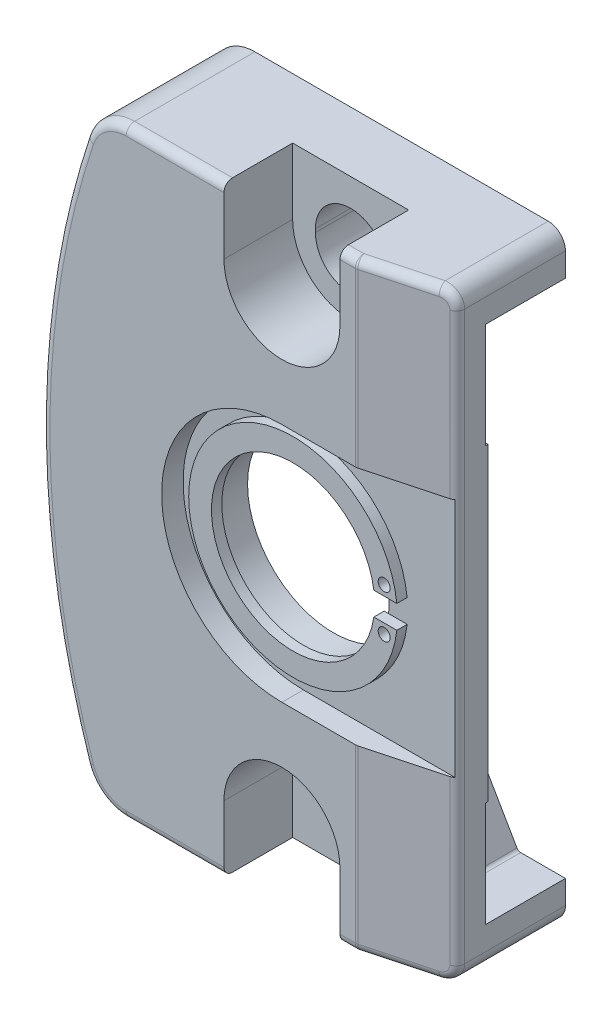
ISO-10303-21;
HEADER;
FILE_DESCRIPTION(('STEP AP214'),'2;1');
FILE_NAME('part.step','',(''),(''),'','','');
FILE_SCHEMA(('AUTOMOTIVE_DESIGN { 1 0 10303 214 1 1 1 1 }'));
ENDSEC;
DATA;
#1=APPLICATION_CONTEXT('core data for automotive mechanical design processes');
#2=APPLICATION_PROTOCOL_DEFINITION('international standard','automotive_design',2000,#1);
#3=PRODUCT_CONTEXT('',#1,'mechanical');
#4=PRODUCT('Part','Part','',(#3));
#5=PRODUCT_RELATED_PRODUCT_CATEGORY('part','',(#4));
#6=PRODUCT_DEFINITION_FORMATION('','',#4);
#7=PRODUCT_DEFINITION_CONTEXT('part definition',#1,'design');
#8=PRODUCT_DEFINITION('design','',#6,#7);
#9=PRODUCT_DEFINITION_SHAPE('','',#8);
#10=(LENGTH_UNIT() NAMED_UNIT(*) SI_UNIT(.MILLI.,.METRE.));
#11=(NAMED_UNIT(*) PLANE_ANGLE_UNIT() SI_UNIT($,.RADIAN.));
#12=(NAMED_UNIT(*) SI_UNIT($,.STERADIAN.) SOLID_ANGLE_UNIT());
#13=UNCERTAINTY_MEASURE_WITH_UNIT(LENGTH_MEASURE(1.E-05),#10,'distance_accuracy_value','');
#14=(GEOMETRIC_REPRESENTATION_CONTEXT(3) GLOBAL_UNCERTAINTY_ASSIGNED_CONTEXT((#13)) GLOBAL_UNIT_ASSIGNED_CONTEXT((#10,
#11,#12)) REPRESENTATION_CONTEXT('',''));
#15=CARTESIAN_POINT('',(0.,0.,0.));
#16=DIRECTION('',(0.,0.,1.));
#17=DIRECTION('',(1.,0.,0.));
#18=AXIS2_PLACEMENT_3D('',#15,#16,#17);
#19=CARTESIAN_POINT('',(0.,27.5,12.5));
#20=DIRECTION('',(0.,0.,1.));
#21=DIRECTION('',(0.,1.,0.));
#22=AXIS2_PLACEMENT_3D('',#19,#20,#21);
#23=CYLINDRICAL_SURFACE('',#22,9.5);
#24=CARTESIAN_POINT('',(0.,27.5,13.7));
#25=DIRECTION('',(0.,0.,-1.));
#26=DIRECTION('',(1.,0.,0.));
#27=AXIS2_PLACEMENT_3D('',#24,#25,#26);
#28=CIRCLE('',#27,9.5);
#29=CARTESIAN_POINT('',(9.40358974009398,26.15,13.7));
#30=VERTEX_POINT('',#29);
#31=CARTESIAN_POINT('',(9.40358974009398,28.85,13.7));
#32=VERTEX_POINT('',#31);
#33=EDGE_CURVE('E1882',#30,#32,#28,.T.);
#34=ORIENTED_EDGE('',*,*,#33,.F.);
#35=DIRECTION('',(0.,0.,1.));
#36=VECTOR('',#35,1.);
#37=CARTESIAN_POINT('',(9.40358974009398,26.15,12.5));
#38=LINE('',#37,#36);
#39=CARTESIAN_POINT('',(9.40358974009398,26.15,12.5));
#40=VERTEX_POINT('',#39);
#41=EDGE_CURVE('E24',#40,#30,#38,.T.);
#42=ORIENTED_EDGE('',*,*,#41,.F.);
#43=CARTESIAN_POINT('',(0.,27.5,12.5));
#44=DIRECTION('',(0.,0.,-1.));
#45=DIRECTION('',(1.,0.,0.));
#46=AXIS2_PLACEMENT_3D('',#43,#44,#45);
#47=CIRCLE('',#46,9.5);
#48=CARTESIAN_POINT('',(9.40358974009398,28.85,12.5));
#49=VERTEX_POINT('',#48);
#50=EDGE_CURVE('E463',#40,#49,#47,.T.);
#51=ORIENTED_EDGE('',*,*,#50,.T.);
#52=DIRECTION('',(0.,0.,1.));
#53=VECTOR('',#52,1.);
#54=CARTESIAN_POINT('',(9.40358974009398,28.85,12.5));
#55=LINE('',#54,#53);
#56=EDGE_CURVE('E450',#49,#32,#55,.T.);
#57=ORIENTED_EDGE('',*,*,#56,.T.);
#58=EDGE_LOOP('',(#34,#42,#51,#57));
#59=FACE_BOUND('',#58,.T.);
#60=ADVANCED_FACE('F14',(#59),#23,.F.);
#61=CARTESIAN_POINT('',(9.40358974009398,26.15,12.5));
#62=DIRECTION('',(0.,1.,0.));
#63=DIRECTION('',(1.,0.,0.));
#64=AXIS2_PLACEMENT_3D('',#61,#62,#63);
#65=PLANE('',#64);
#66=DIRECTION('',(-1.,0.,0.));
#67=VECTOR('',#66,1.);
#68=CARTESIAN_POINT('',(9.40358974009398,26.15,13.7));
#69=LINE('',#68,#67);
#70=CARTESIAN_POINT('',(12.0747670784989,26.15,13.7));
#71=VERTEX_POINT('',#70);
#72=EDGE_CURVE('E1888',#71,#30,#69,.T.);
#73=ORIENTED_EDGE('',*,*,#72,.F.);
#74=DIRECTION('',(0.,0.,-1.));
#75=VECTOR('',#74,1.);
#76=CARTESIAN_POINT('',(12.0747670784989,26.15,48.0122330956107));
#77=LINE('',#76,#75);
#78=CARTESIAN_POINT('',(12.0747670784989,26.15,12.5));
#79=VERTEX_POINT('',#78);
#80=EDGE_CURVE('E1887',#71,#79,#77,.T.);
#81=ORIENTED_EDGE('',*,*,#80,.T.);
#82=DIRECTION('',(-1.,0.,0.));
#83=VECTOR('',#82,1.);
#84=CARTESIAN_POINT('',(9.40358974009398,26.15,12.5));
#85=LINE('',#84,#83);
#86=CARTESIAN_POINT('',(9.9084559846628,26.15,12.5));
#87=VERTEX_POINT('',#86);
#88=EDGE_CURVE('E467',#79,#87,#85,.T.);
#89=ORIENTED_EDGE('',*,*,#88,.T.);
#90=EDGE_CURVE('E475',#87,#40,#85,.T.);
#91=ORIENTED_EDGE('',*,*,#90,.T.);
#92=ORIENTED_EDGE('',*,*,#41,.T.);
#93=EDGE_LOOP('',(#73,#81,#89,#91,#92));
#94=FACE_BOUND('',#93,.T.);
#95=ADVANCED_FACE('F1121',(#94),#65,.T.);
#96=CARTESIAN_POINT('',(13.303589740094,28.85,12.5));
#97=DIRECTION('',(0.,-1.,0.));
#98=DIRECTION('',(-1.,0.,0.));
#99=AXIS2_PLACEMENT_3D('',#96,#97,#98);
#100=PLANE('',#99);
#101=DIRECTION('',(1.,0.,0.));
#102=VECTOR('',#101,1.);
#103=CARTESIAN_POINT('',(13.303589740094,28.85,12.5));
#104=LINE('',#103,#102);
#105=CARTESIAN_POINT('',(9.9084559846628,28.85,12.5));
#106=VERTEX_POINT('',#105);
#107=EDGE_CURVE('E454',#49,#106,#104,.T.);
#108=ORIENTED_EDGE('',*,*,#107,.T.);
#109=CARTESIAN_POINT('',(12.0747670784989,28.85,12.5));
#110=VERTEX_POINT('',#109);
#111=EDGE_CURVE('E33',#106,#110,#104,.T.);
#112=ORIENTED_EDGE('',*,*,#111,.T.);
#113=DIRECTION('',(0.,0.,-1.));
#114=VECTOR('',#113,1.);
#115=CARTESIAN_POINT('',(12.0747670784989,28.85,48.0122330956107));
#116=LINE('',#115,#114);
#117=CARTESIAN_POINT('',(12.0747670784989,28.85,13.7));
#118=VERTEX_POINT('',#117);
#119=EDGE_CURVE('E1885',#118,#110,#116,.T.);
#120=ORIENTED_EDGE('',*,*,#119,.F.);
#121=DIRECTION('',(1.,0.,0.));
#122=VECTOR('',#121,1.);
#123=CARTESIAN_POINT('',(13.303589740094,28.85,13.7));
#124=LINE('',#123,#122);
#125=EDGE_CURVE('E456',#32,#118,#124,.T.);
#126=ORIENTED_EDGE('',*,*,#125,.F.);
#127=ORIENTED_EDGE('',*,*,#56,.F.);
#128=EDGE_LOOP('',(#108,#112,#120,#126,#127));
#129=FACE_BOUND('',#128,.T.);
#130=ADVANCED_FACE('F452',(#129),#100,.T.);
#131=CARTESIAN_POINT('',(0.,27.5,13.7));
#132=DIRECTION('',(0.,0.,-1.));
#133=DIRECTION('',(0.,-1.,0.));
#134=AXIS2_PLACEMENT_3D('',#131,#132,#133);
#135=PLANE('',#134);
#136=CARTESIAN_POINT('',(10.603589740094,25.,13.7));
#137=DIRECTION('',(0.,0.,-1.));
#138=DIRECTION('',(0.,1.,0.));
#139=AXIS2_PLACEMENT_3D('',#136,#137,#138);
#140=CIRCLE('',#139,0.7);
#141=CARTESIAN_POINT('',(10.603589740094,25.7,13.7));
#142=VERTEX_POINT('',#141);
#143=EDGE_CURVE('E1874',#142,#142,#140,.T.);
#144=ORIENTED_EDGE('',*,*,#143,.T.);
#145=EDGE_LOOP('',(#144));
#146=FACE_BOUND('',#145,.T.);
#147=CARTESIAN_POINT('',(10.603589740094,30.,13.7));
#148=DIRECTION('',(0.,0.,-1.));
#149=DIRECTION('',(0.,-1.,0.));
#150=AXIS2_PLACEMENT_3D('',#147,#148,#149);
#151=CIRCLE('',#150,0.7);
#152=CARTESIAN_POINT('',(10.603589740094,29.3,13.7));
#153=VERTEX_POINT('',#152);
#154=EDGE_CURVE('E1878',#153,#153,#151,.T.);
#155=ORIENTED_EDGE('',*,*,#154,.T.);
#156=EDGE_LOOP('',(#155));
#157=FACE_BOUND('',#156,.T.);
#158=ORIENTED_EDGE('',*,*,#125,.T.);
#159=CARTESIAN_POINT('',(0.,27.5,13.7));
#160=DIRECTION('',(0.,0.,-1.));
#161=DIRECTION('',(0.,-1.,0.));
#162=AXIS2_PLACEMENT_3D('',#159,#160,#161);
#163=CIRCLE('',#162,12.15);
#164=EDGE_CURVE('E1881',#118,#71,#163,.F.);
#165=ORIENTED_EDGE('',*,*,#164,.T.);
#166=ORIENTED_EDGE('',*,*,#72,.T.);
#167=ORIENTED_EDGE('',*,*,#33,.T.);
#168=EDGE_LOOP('',(#158,#165,#166,#167));
#169=FACE_BOUND('',#168,.T.);
#170=ADVANCED_FACE('F1751',(#146,#157,#169),#135,.F.);
#171=CARTESIAN_POINT('',(10.603589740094,25.,13.7));
#172=DIRECTION('',(0.,0.,-1.));
#173=DIRECTION('',(0.,-1.,0.));
#174=AXIS2_PLACEMENT_3D('',#171,#172,#173);
#175=CYLINDRICAL_SURFACE('',#174,0.7);
#176=ORIENTED_EDGE('',*,*,#143,.F.);
#177=EDGE_LOOP('',(#176));
#178=FACE_BOUND('',#177,.T.);
#179=CARTESIAN_POINT('',(10.603589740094,25.,12.5));
#180=DIRECTION('',(0.,0.,-1.));
#181=DIRECTION('',(0.,1.,0.));
#182=AXIS2_PLACEMENT_3D('',#179,#180,#181);
#183=CIRCLE('',#182,0.7);
#184=CARTESIAN_POINT('',(10.603589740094,25.7,12.5));
#185=VERTEX_POINT('',#184);
#186=EDGE_CURVE('E1003',#185,#185,#183,.T.);
#187=ORIENTED_EDGE('',*,*,#186,.T.);
#188=EDGE_LOOP('',(#187));
#189=FACE_BOUND('',#188,.T.);
#190=ADVANCED_FACE('F1743',(#178,#189),#175,.F.);
#191=CARTESIAN_POINT('',(10.603589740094,30.,13.7));
#192=DIRECTION('',(0.,0.,-1.));
#193=DIRECTION('',(0.,-1.,0.));
#194=AXIS2_PLACEMENT_3D('',#191,#192,#193);
#195=CYLINDRICAL_SURFACE('',#194,0.7);
#196=ORIENTED_EDGE('',*,*,#154,.F.);
#197=EDGE_LOOP('',(#196));
#198=FACE_BOUND('',#197,.T.);
#199=CARTESIAN_POINT('',(10.603589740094,30.,12.5));
#200=DIRECTION('',(0.,0.,-1.));
#201=DIRECTION('',(0.,-1.,0.));
#202=AXIS2_PLACEMENT_3D('',#199,#200,#201);
#203=CIRCLE('',#202,0.7);
#204=CARTESIAN_POINT('',(10.603589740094,29.3,12.5));
#205=VERTEX_POINT('',#204);
#206=EDGE_CURVE('E1903',#205,#205,#203,.T.);
#207=ORIENTED_EDGE('',*,*,#206,.T.);
#208=EDGE_LOOP('',(#207));
#209=FACE_BOUND('',#208,.T.);
#210=ADVANCED_FACE('F1736',(#198,#209),#195,.F.);
#211=CARTESIAN_POINT('',(0.,27.5,48.0122330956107));
#212=DIRECTION('',(0.,0.,-1.));
#213=DIRECTION('',(0.,-1.,0.));
#214=AXIS2_PLACEMENT_3D('',#211,#212,#213);
#215=CYLINDRICAL_SURFACE('',#214,12.15);
#216=ORIENTED_EDGE('',*,*,#164,.F.);
#217=ORIENTED_EDGE('',*,*,#119,.T.);
#218=CARTESIAN_POINT('',(0.,27.5,12.5));
#219=DIRECTION('',(0.,0.,-1.));
#220=DIRECTION('',(0.,-1.,0.));
#221=AXIS2_PLACEMENT_3D('',#218,#219,#220);
#222=CIRCLE('',#221,12.15);
#223=EDGE_CURVE('E428',#79,#110,#222,.T.);
#224=ORIENTED_EDGE('',*,*,#223,.F.);
#225=ORIENTED_EDGE('',*,*,#80,.F.);
#226=EDGE_LOOP('',(#216,#217,#224,#225));
#227=FACE_BOUND('',#226,.T.);
#228=ADVANCED_FACE('F1726',(#227),#215,.T.);
#229=CARTESIAN_POINT('',(0.,27.5,12.5));
#230=DIRECTION('',(0.,0.,-1.));
#231=DIRECTION('',(0.,-1.,0.));
#232=AXIS2_PLACEMENT_3D('',#229,#230,#231);
#233=PLANE('',#232);
#234=ORIENTED_EDGE('',*,*,#90,.F.);
#235=CARTESIAN_POINT('',(0.,27.5,12.5));
#236=DIRECTION('',(0.,0.,-1.));
#237=DIRECTION('',(0.,-1.,0.));
#238=AXIS2_PLACEMENT_3D('',#235,#236,#237);
#239=CIRCLE('',#238,10.);
#240=EDGE_CURVE('E9',#87,#106,#239,.T.);
#241=ORIENTED_EDGE('',*,*,#240,.T.);
#242=ORIENTED_EDGE('',*,*,#107,.F.);
#243=ORIENTED_EDGE('',*,*,#50,.F.);
#244=EDGE_LOOP('',(#234,#241,#242,#243));
#245=FACE_BOUND('',#244,.T.);
#246=ADVANCED_FACE('F469',(#245),#233,.T.);
#247=CARTESIAN_POINT('',(0.,27.5,12.5));
#248=DIRECTION('',(0.,0.,1.));
#249=DIRECTION('',(0.,1.,0.));
#250=AXIS2_PLACEMENT_3D('',#247,#248,#249);
#251=PLANE('',#250);
#252=ORIENTED_EDGE('',*,*,#186,.F.);
#253=EDGE_LOOP('',(#252));
#254=FACE_BOUND('',#253,.T.);
#255=ADVANCED_FACE('F1272',(#254),#251,.T.);
#256=ORIENTED_EDGE('',*,*,#206,.F.);
#257=EDGE_LOOP('',(#256));
#258=FACE_BOUND('',#257,.T.);
#259=ADVANCED_FACE('F1159',(#258),#251,.T.);
#260=CARTESIAN_POINT('',(4.1,54.8,0.));
#261=DIRECTION('',(1.,0.,0.));
#262=DIRECTION('',(0.,1.,0.));
#263=AXIS2_PLACEMENT_3D('',#260,#261,#262);
#264=PLANE('',#263);
#265=DIRECTION('',(0.,1.,0.));
#266=VECTOR('',#265,1.);
#267=CARTESIAN_POINT('',(4.1,54.8,7.));
#268=LINE('',#267,#266);
#269=CARTESIAN_POINT('',(4.1,54.8,7.));
#270=VERTEX_POINT('',#269);
#271=CARTESIAN_POINT('',(4.1,55.2,7.));
#272=VERTEX_POINT('',#271);
#273=EDGE_CURVE('E497',#270,#272,#268,.T.);
#274=ORIENTED_EDGE('',*,*,#273,.T.);
#275=DIRECTION('',(0.,0.,1.));
#276=VECTOR('',#275,1.);
#277=CARTESIAN_POINT('',(4.1,55.2,0.));
#278=LINE('',#277,#276);
#279=CARTESIAN_POINT('',(4.1,55.2,0.));
#280=VERTEX_POINT('',#279);
#281=EDGE_CURVE('E524',#280,#272,#278,.T.);
#282=ORIENTED_EDGE('',*,*,#281,.F.);
#283=DIRECTION('',(0.,1.,0.));
#284=VECTOR('',#283,1.);
#285=CARTESIAN_POINT('',(4.1,54.8,0.));
#286=LINE('',#285,#284);
#287=CARTESIAN_POINT('',(4.1,54.8,0.));
#288=VERTEX_POINT('',#287);
#289=EDGE_CURVE('E414',#288,#280,#286,.T.);
#290=ORIENTED_EDGE('',*,*,#289,.F.);
#291=DIRECTION('',(0.,0.,1.));
#292=VECTOR('',#291,1.);
#293=CARTESIAN_POINT('',(4.1,54.8,0.));
#294=LINE('',#293,#292);
#295=EDGE_CURVE('E511',#288,#270,#294,.T.);
#296=ORIENTED_EDGE('',*,*,#295,.T.);
#297=EDGE_LOOP('',(#274,#282,#290,#296));
#298=FACE_BOUND('',#297,.T.);
#299=ADVANCED_FACE('F1138',(#298),#264,.F.);
#300=CARTESIAN_POINT('',(0.,54.8,0.));
#301=DIRECTION('',(0.,0.,1.));
#302=DIRECTION('',(0.,1.,0.));
#303=AXIS2_PLACEMENT_3D('',#300,#301,#302);
#304=CYLINDRICAL_SURFACE('',#303,4.1);
#305=DIRECTION('',(0.,0.,1.));
#306=VECTOR('',#305,1.);
#307=CARTESIAN_POINT('',(-4.1,54.8,0.));
#308=LINE('',#307,#306);
#309=CARTESIAN_POINT('',(-4.1,54.8,0.));
#310=VERTEX_POINT('',#309);
#311=CARTESIAN_POINT('',(-4.1,54.8,7.));
#312=VERTEX_POINT('',#311);
#313=EDGE_CURVE('E518',#310,#312,#308,.T.);
#314=ORIENTED_EDGE('',*,*,#313,.T.);
#315=CARTESIAN_POINT('',(0.,54.8,7.));
#316=DIRECTION('',(0.,0.,1.));
#317=DIRECTION('',(0.,1.,0.));
#318=AXIS2_PLACEMENT_3D('',#315,#316,#317);
#319=CIRCLE('',#318,4.1);
#320=EDGE_CURVE('E654',#312,#270,#319,.T.);
#321=ORIENTED_EDGE('',*,*,#320,.T.);
#322=ORIENTED_EDGE('',*,*,#295,.F.);
#323=CARTESIAN_POINT('',(0.,54.8,0.));
#324=DIRECTION('',(0.,0.,1.));
#325=DIRECTION('',(0.,1.,0.));
#326=AXIS2_PLACEMENT_3D('',#323,#324,#325);
#327=CIRCLE('',#326,4.1);
#328=EDGE_CURVE('E676',#310,#288,#327,.T.);
#329=ORIENTED_EDGE('',*,*,#328,.F.);
#330=EDGE_LOOP('',(#314,#321,#322,#329));
#331=FACE_BOUND('',#330,.T.);
#332=ADVANCED_FACE('F1150',(#331),#304,.F.);
#333=CARTESIAN_POINT('',(-4.1,54.8,0.));
#334=DIRECTION('',(-1.,0.,0.));
#335=DIRECTION('',(0.,-1.,0.));
#336=AXIS2_PLACEMENT_3D('',#333,#334,#335);
#337=PLANE('',#336);
#338=DIRECTION('',(0.,-1.,0.));
#339=VECTOR('',#338,1.);
#340=CARTESIAN_POINT('',(-4.1,54.8,7.));
#341=LINE('',#340,#339);
#342=CARTESIAN_POINT('',(-4.1,55.2,7.));
#343=VERTEX_POINT('',#342);
#344=EDGE_CURVE('E505',#343,#312,#341,.T.);
#345=ORIENTED_EDGE('',*,*,#344,.T.);
#346=ORIENTED_EDGE('',*,*,#313,.F.);
#347=DIRECTION('',(0.,-1.,0.));
#348=VECTOR('',#347,1.);
#349=CARTESIAN_POINT('',(-4.1,54.8,0.));
#350=LINE('',#349,#348);
#351=CARTESIAN_POINT('',(-4.1,55.2,0.));
#352=VERTEX_POINT('',#351);
#353=EDGE_CURVE('E508',#352,#310,#350,.T.);
#354=ORIENTED_EDGE('',*,*,#353,.F.);
#355=DIRECTION('',(0.,0.,1.));
#356=VECTOR('',#355,1.);
#357=CARTESIAN_POINT('',(-4.1,55.2,0.));
#358=LINE('',#357,#356);
#359=EDGE_CURVE('E522',#352,#343,#358,.T.);
#360=ORIENTED_EDGE('',*,*,#359,.T.);
#361=EDGE_LOOP('',(#345,#346,#354,#360));
#362=FACE_BOUND('',#361,.T.);
#363=ADVANCED_FACE('F1146',(#362),#337,.F.);
#364=CARTESIAN_POINT('',(0.,55.2,0.));
#365=DIRECTION('',(0.,0.,1.));
#366=DIRECTION('',(0.,1.,0.));
#367=AXIS2_PLACEMENT_3D('',#364,#365,#366);
#368=CYLINDRICAL_SURFACE('',#367,4.1);
#369=CARTESIAN_POINT('',(0.,55.2,7.));
#370=DIRECTION('',(0.,0.,1.));
#371=DIRECTION('',(0.,1.,0.));
#372=AXIS2_PLACEMENT_3D('',#369,#370,#371);
#373=CIRCLE('',#372,4.1);
#374=EDGE_CURVE('E514',#272,#343,#373,.T.);
#375=ORIENTED_EDGE('',*,*,#374,.T.);
#376=ORIENTED_EDGE('',*,*,#359,.F.);
#377=CARTESIAN_POINT('',(0.,55.2,0.));
#378=DIRECTION('',(0.,0.,1.));
#379=DIRECTION('',(0.,1.,0.));
#380=AXIS2_PLACEMENT_3D('',#377,#378,#379);
#381=CIRCLE('',#380,4.1);
#382=EDGE_CURVE('E504',#280,#352,#381,.T.);
#383=ORIENTED_EDGE('',*,*,#382,.F.);
#384=ORIENTED_EDGE('',*,*,#281,.T.);
#385=EDGE_LOOP('',(#375,#376,#383,#384));
#386=FACE_BOUND('',#385,.T.);
#387=ADVANCED_FACE('F1149',(#386),#368,.F.);
#388=CARTESIAN_POINT('',(12.7886751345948,57.25,9.3));
#389=DIRECTION('',(0.,0.,-1.));
#390=DIRECTION('',(-1.,0.,0.));
#391=AXIS2_PLACEMENT_3D('',#388,#389,#390);
#392=CYLINDRICAL_SURFACE('',#391,0.5);
#393=CARTESIAN_POINT('',(12.7886751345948,57.25,0.));
#394=DIRECTION('',(0.,0.,-1.));
#395=DIRECTION('',(1.,0.,0.));
#396=AXIS2_PLACEMENT_3D('',#393,#394,#395);
#397=CIRCLE('',#396,0.5);
#398=CARTESIAN_POINT('',(12.3556624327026,57.5,0.));
#399=VERTEX_POINT('',#398);
#400=CARTESIAN_POINT('',(12.7886751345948,57.75,0.));
#401=VERTEX_POINT('',#400);
#402=EDGE_CURVE('E571',#399,#401,#397,.T.);
#403=ORIENTED_EDGE('',*,*,#402,.T.);
#404=DIRECTION('',(0.,0.,-1.));
#405=VECTOR('',#404,1.);
#406=CARTESIAN_POINT('',(12.7886751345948,57.75,9.3));
#407=LINE('',#406,#405);
#408=CARTESIAN_POINT('',(12.7886751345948,57.75,9.3));
#409=VERTEX_POINT('',#408);
#410=EDGE_CURVE('E615',#409,#401,#407,.T.);
#411=ORIENTED_EDGE('',*,*,#410,.F.);
#412=CARTESIAN_POINT('',(12.7886751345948,57.25,9.3));
#413=DIRECTION('',(0.,0.,-1.));
#414=DIRECTION('',(1.,0.,0.));
#415=AXIS2_PLACEMENT_3D('',#412,#413,#414);
#416=CIRCLE('',#415,0.5);
#417=CARTESIAN_POINT('',(12.3556624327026,57.5,9.3));
#418=VERTEX_POINT('',#417);
#419=EDGE_CURVE('E572',#418,#409,#416,.T.);
#420=ORIENTED_EDGE('',*,*,#419,.F.);
#421=DIRECTION('',(0.,0.,-1.));
#422=VECTOR('',#421,1.);
#423=CARTESIAN_POINT('',(12.3556624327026,57.5,9.3));
#424=LINE('',#423,#422);
#425=EDGE_CURVE('E651',#418,#399,#424,.T.);
#426=ORIENTED_EDGE('',*,*,#425,.T.);
#427=EDGE_LOOP('',(#403,#411,#420,#426));
#428=FACE_BOUND('',#427,.T.);
#429=ADVANCED_FACE('F1155',(#428),#392,.F.);
#430=CARTESIAN_POINT('',(12.3556624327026,57.5,9.3));
#431=DIRECTION('',(-0.86602540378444,0.5,0.));
#432=DIRECTION('',(-0.5,-0.86602540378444,0.));
#433=AXIS2_PLACEMENT_3D('',#430,#431,#432);
#434=PLANE('',#433);
#435=DIRECTION('',(0.5,0.86602540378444,0.));
#436=VECTOR('',#435,1.);
#437=CARTESIAN_POINT('',(12.3556624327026,57.5,9.3));
#438=LINE('',#437,#436);
#439=CARTESIAN_POINT('',(6.29348460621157,47.,9.3));
#440=VERTEX_POINT('',#439);
#441=EDGE_CURVE('E613',#440,#418,#438,.T.);
#442=ORIENTED_EDGE('',*,*,#441,.F.);
#443=DIRECTION('',(0.,0.,-1.));
#444=VECTOR('',#443,1.);
#445=CARTESIAN_POINT('',(6.29348460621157,47.,9.3));
#446=LINE('',#445,#444);
#447=CARTESIAN_POINT('',(6.29348460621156,47.,0.));
#448=VERTEX_POINT('',#447);
#449=EDGE_CURVE('E838',#440,#448,#446,.T.);
#450=ORIENTED_EDGE('',*,*,#449,.T.);
#451=DIRECTION('',(0.5,0.86602540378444,0.));
#452=VECTOR('',#451,1.);
#453=CARTESIAN_POINT('',(12.3556624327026,57.5,0.));
#454=LINE('',#453,#452);
#455=EDGE_CURVE('E576',#448,#399,#454,.T.);
#456=ORIENTED_EDGE('',*,*,#455,.T.);
#457=ORIENTED_EDGE('',*,*,#425,.F.);
#458=EDGE_LOOP('',(#442,#450,#456,#457));
#459=FACE_BOUND('',#458,.T.);
#460=ADVANCED_FACE('F1178',(#459),#434,.F.);
#461=CARTESIAN_POINT('',(5.42745920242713,47.5,9.3));
#462=DIRECTION('',(0.,0.,-1.));
#463=DIRECTION('',(-1.,0.,0.));
#464=AXIS2_PLACEMENT_3D('',#461,#462,#463);
#465=CYLINDRICAL_SURFACE('',#464,1.);
#466=CARTESIAN_POINT('',(5.42745920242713,47.5,9.3));
#467=DIRECTION('',(0.,0.,1.));
#468=DIRECTION('',(1.,0.,0.));
#469=AXIS2_PLACEMENT_3D('',#466,#467,#468);
#470=CIRCLE('',#469,1.);
#471=CARTESIAN_POINT('',(5.42745920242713,46.5,9.3));
#472=VERTEX_POINT('',#471);
#473=EDGE_CURVE('E847',#472,#440,#470,.T.);
#474=ORIENTED_EDGE('',*,*,#473,.F.);
#475=DIRECTION('',(0.,0.,-1.));
#476=VECTOR('',#475,1.);
#477=CARTESIAN_POINT('',(5.42745920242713,46.5,9.3));
#478=LINE('',#477,#476);
#479=CARTESIAN_POINT('',(5.42745920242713,46.5,0.));
#480=VERTEX_POINT('',#479);
#481=EDGE_CURVE('E843',#480,#472,#478,.F.);
#482=ORIENTED_EDGE('',*,*,#481,.F.);
#483=CARTESIAN_POINT('',(5.42745920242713,47.5,0.));
#484=DIRECTION('',(0.,0.,1.));
#485=DIRECTION('',(1.,0.,0.));
#486=AXIS2_PLACEMENT_3D('',#483,#484,#485);
#487=CIRCLE('',#486,1.);
#488=EDGE_CURVE('E841',#448,#480,#487,.F.);
#489=ORIENTED_EDGE('',*,*,#488,.F.);
#490=ORIENTED_EDGE('',*,*,#449,.F.);
#491=EDGE_LOOP('',(#474,#482,#489,#490));
#492=FACE_BOUND('',#491,.T.);
#493=ADVANCED_FACE('F1181',(#492),#465,.T.);
#494=CARTESIAN_POINT('',(6.00480947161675,46.5,9.3));
#495=DIRECTION('',(0.,1.,0.));
#496=DIRECTION('',(-1.,0.,0.));
#497=AXIS2_PLACEMENT_3D('',#494,#495,#496);
#498=PLANE('',#497);
#499=DIRECTION('',(1.,0.,0.));
#500=VECTOR('',#499,1.);
#501=CARTESIAN_POINT('',(6.00480947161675,46.5,0.));
#502=LINE('',#501,#500);
#503=CARTESIAN_POINT('',(-16.2,46.5,0.));
#504=VERTEX_POINT('',#503);
#505=EDGE_CURVE('E647',#504,#480,#502,.T.);
#506=ORIENTED_EDGE('',*,*,#505,.T.);
#507=ORIENTED_EDGE('',*,*,#481,.T.);
#508=DIRECTION('',(1.,0.,0.));
#509=VECTOR('',#508,1.);
#510=CARTESIAN_POINT('',(6.00480947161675,46.5,9.3));
#511=LINE('',#510,#509);
#512=CARTESIAN_POINT('',(-16.2,46.5,9.3));
#513=VERTEX_POINT('',#512);
#514=EDGE_CURVE('E610',#513,#472,#511,.T.);
#515=ORIENTED_EDGE('',*,*,#514,.F.);
#516=DIRECTION('',(0.,0.,-1.));
#517=VECTOR('',#516,1.);
#518=CARTESIAN_POINT('',(-16.2,46.5,9.3));
#519=LINE('',#518,#517);
#520=EDGE_CURVE('E820',#513,#504,#519,.T.);
#521=ORIENTED_EDGE('',*,*,#520,.T.);
#522=EDGE_LOOP('',(#506,#507,#515,#521));
#523=FACE_BOUND('',#522,.T.);
#524=ADVANCED_FACE('F1183',(#523),#498,.F.);
#525=CARTESIAN_POINT('',(-16.2,46.5,9.3));
#526=DIRECTION('',(0.70710678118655,0.707106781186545,0.));
#527=DIRECTION('',(-0.707106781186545,0.70710678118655,0.));
#528=AXIS2_PLACEMENT_3D('',#525,#526,#527);
#529=PLANE('',#528);
#530=DIRECTION('',(-0.707106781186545,0.70710678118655,0.));
#531=VECTOR('',#530,1.);
#532=CARTESIAN_POINT('',(-7.0806624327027,37.3806624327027,9.3));
#533=LINE('',#532,#531);
#534=CARTESIAN_POINT('',(-17.2,47.5,9.3));
#535=VERTEX_POINT('',#534);
#536=EDGE_CURVE('E829',#535,#513,#533,.F.);
#537=ORIENTED_EDGE('',*,*,#536,.F.);
#538=DIRECTION('',(0.,0.,1.));
#539=VECTOR('',#538,1.);
#540=CARTESIAN_POINT('',(-17.2,47.5,9.3));
#541=LINE('',#540,#539);
#542=CARTESIAN_POINT('',(-17.2,47.5,0.));
#543=VERTEX_POINT('',#542);
#544=EDGE_CURVE('E825',#543,#535,#541,.T.);
#545=ORIENTED_EDGE('',*,*,#544,.F.);
#546=DIRECTION('',(0.707106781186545,-0.70710678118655,0.));
#547=VECTOR('',#546,1.);
#548=CARTESIAN_POINT('',(-16.2,46.5,0.));
#549=LINE('',#548,#547);
#550=EDGE_CURVE('E823',#504,#543,#549,.F.);
#551=ORIENTED_EDGE('',*,*,#550,.F.);
#552=ORIENTED_EDGE('',*,*,#520,.F.);
#553=EDGE_LOOP('',(#537,#545,#551,#552));
#554=FACE_BOUND('',#553,.T.);
#555=ADVANCED_FACE('F1186',(#554),#529,.F.);
#556=CARTESIAN_POINT('',(-17.2,57.25,9.3));
#557=DIRECTION('',(1.,0.,0.));
#558=DIRECTION('',(0.,1.,0.));
#559=AXIS2_PLACEMENT_3D('',#556,#557,#558);
#560=PLANE('',#559);
#561=DIRECTION('',(0.,-1.,0.));
#562=VECTOR('',#561,1.);
#563=CARTESIAN_POINT('',(-17.2,57.25,0.));
#564=LINE('',#563,#562);
#565=CARTESIAN_POINT('',(-17.2,57.25,0.));
#566=VERTEX_POINT('',#565);
#567=EDGE_CURVE('E644',#566,#543,#564,.T.);
#568=ORIENTED_EDGE('',*,*,#567,.T.);
#569=ORIENTED_EDGE('',*,*,#544,.T.);
#570=DIRECTION('',(0.,-1.,0.));
#571=VECTOR('',#570,1.);
#572=CARTESIAN_POINT('',(-17.2,57.25,9.3));
#573=LINE('',#572,#571);
#574=CARTESIAN_POINT('',(-17.2,57.25,9.3));
#575=VERTEX_POINT('',#574);
#576=EDGE_CURVE('E607',#575,#535,#573,.T.);
#577=ORIENTED_EDGE('',*,*,#576,.F.);
#578=DIRECTION('',(0.,0.,-1.));
#579=VECTOR('',#578,1.);
#580=CARTESIAN_POINT('',(-17.2,57.25,9.3));
#581=LINE('',#580,#579);
#582=EDGE_CURVE('E655',#575,#566,#581,.T.);
#583=ORIENTED_EDGE('',*,*,#582,.T.);
#584=EDGE_LOOP('',(#568,#569,#577,#583));
#585=FACE_BOUND('',#584,.T.);
#586=ADVANCED_FACE('F1188',(#585),#560,.F.);
#587=CARTESIAN_POINT('',(-17.7,57.25,9.3));
#588=DIRECTION('',(0.,0.,-1.));
#589=DIRECTION('',(-1.,0.,0.));
#590=AXIS2_PLACEMENT_3D('',#587,#588,#589);
#591=CYLINDRICAL_SURFACE('',#590,0.5);
#592=CARTESIAN_POINT('',(-17.7,57.25,0.));
#593=DIRECTION('',(0.,0.,-1.));
#594=DIRECTION('',(1.,0.,0.));
#595=AXIS2_PLACEMENT_3D('',#592,#593,#594);
#596=CIRCLE('',#595,0.5);
#597=CARTESIAN_POINT('',(-17.7,57.75,0.));
#598=VERTEX_POINT('',#597);
#599=EDGE_CURVE('E641',#598,#566,#596,.T.);
#600=ORIENTED_EDGE('',*,*,#599,.T.);
#601=ORIENTED_EDGE('',*,*,#582,.F.);
#602=CARTESIAN_POINT('',(-17.7,57.25,9.3));
#603=DIRECTION('',(0.,0.,-1.));
#604=DIRECTION('',(1.,0.,0.));
#605=AXIS2_PLACEMENT_3D('',#602,#603,#604);
#606=CIRCLE('',#605,0.5);
#607=CARTESIAN_POINT('',(-17.7,57.75,9.3));
#608=VERTEX_POINT('',#607);
#609=EDGE_CURVE('E604',#608,#575,#606,.T.);
#610=ORIENTED_EDGE('',*,*,#609,.F.);
#611=DIRECTION('',(0.,0.,-1.));
#612=VECTOR('',#611,1.);
#613=CARTESIAN_POINT('',(-17.7,57.75,9.3));
#614=LINE('',#613,#612);
#615=EDGE_CURVE('E657',#608,#598,#614,.T.);
#616=ORIENTED_EDGE('',*,*,#615,.T.);
#617=EDGE_LOOP('',(#600,#601,#610,#616));
#618=FACE_BOUND('',#617,.T.);
#619=ADVANCED_FACE('F1191',(#618),#591,.F.);
#620=CARTESIAN_POINT('',(12.7886751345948,-2.25,9.3));
#621=DIRECTION('',(0.,0.,-1.));
#622=DIRECTION('',(-1.,0.,0.));
#623=AXIS2_PLACEMENT_3D('',#620,#621,#622);
#624=CYLINDRICAL_SURFACE('',#623,0.5);
#625=CARTESIAN_POINT('',(12.7886751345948,-2.25,0.));
#626=DIRECTION('',(0.,0.,-1.));
#627=DIRECTION('',(-1.,0.,0.));
#628=AXIS2_PLACEMENT_3D('',#625,#626,#627);
#629=CIRCLE('',#628,0.5);
#630=CARTESIAN_POINT('',(12.7886751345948,-2.75,0.));
#631=VERTEX_POINT('',#630);
#632=CARTESIAN_POINT('',(12.3556624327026,-2.5,0.));
#633=VERTEX_POINT('',#632);
#634=EDGE_CURVE('E623',#631,#633,#629,.T.);
#635=ORIENTED_EDGE('',*,*,#634,.T.);
#636=DIRECTION('',(0.,0.,-1.));
#637=VECTOR('',#636,1.);
#638=CARTESIAN_POINT('',(12.3556624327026,-2.5,9.3));
#639=LINE('',#638,#637);
#640=CARTESIAN_POINT('',(12.3556624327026,-2.5,9.3));
#641=VERTEX_POINT('',#640);
#642=EDGE_CURVE('E665',#641,#633,#639,.T.);
#643=ORIENTED_EDGE('',*,*,#642,.F.);
#644=CARTESIAN_POINT('',(12.7886751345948,-2.25,9.3));
#645=DIRECTION('',(0.,0.,-1.));
#646=DIRECTION('',(-1.,0.,0.));
#647=AXIS2_PLACEMENT_3D('',#644,#645,#646);
#648=CIRCLE('',#647,0.5);
#649=CARTESIAN_POINT('',(12.7886751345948,-2.75,9.3));
#650=VERTEX_POINT('',#649);
#651=EDGE_CURVE('E586',#650,#641,#648,.T.);
#652=ORIENTED_EDGE('',*,*,#651,.F.);
#653=DIRECTION('',(0.,0.,-1.));
#654=VECTOR('',#653,1.);
#655=CARTESIAN_POINT('',(12.7886751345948,-2.75,9.3));
#656=LINE('',#655,#654);
#657=EDGE_CURVE('E667',#650,#631,#656,.T.);
#658=ORIENTED_EDGE('',*,*,#657,.T.);
#659=EDGE_LOOP('',(#635,#643,#652,#658));
#660=FACE_BOUND('',#659,.T.);
#661=ADVANCED_FACE('F1195',(#660),#624,.F.);
#662=CARTESIAN_POINT('',(12.3556624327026,-2.5,9.3));
#663=DIRECTION('',(-0.86602540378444,-0.5,0.));
#664=DIRECTION('',(0.5,-0.86602540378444,0.));
#665=AXIS2_PLACEMENT_3D('',#662,#663,#664);
#666=PLANE('',#665);
#667=DIRECTION('',(-0.5,0.86602540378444,0.));
#668=VECTOR('',#667,1.);
#669=CARTESIAN_POINT('',(12.3556624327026,-2.5,0.));
#670=LINE('',#669,#668);
#671=CARTESIAN_POINT('',(6.29348460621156,8.,0.));
#672=VERTEX_POINT('',#671);
#673=EDGE_CURVE('E626',#633,#672,#670,.T.);
#674=ORIENTED_EDGE('',*,*,#673,.T.);
#675=DIRECTION('',(0.,0.,-1.));
#676=VECTOR('',#675,1.);
#677=CARTESIAN_POINT('',(6.29348460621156,8.,9.3));
#678=LINE('',#677,#676);
#679=CARTESIAN_POINT('',(6.29348460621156,8.,9.3));
#680=VERTEX_POINT('',#679);
#681=EDGE_CURVE('E836',#672,#680,#678,.F.);
#682=ORIENTED_EDGE('',*,*,#681,.T.);
#683=DIRECTION('',(-0.5,0.86602540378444,0.));
#684=VECTOR('',#683,1.);
#685=CARTESIAN_POINT('',(12.3556624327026,-2.5,9.3));
#686=LINE('',#685,#684);
#687=EDGE_CURVE('E589',#641,#680,#686,.T.);
#688=ORIENTED_EDGE('',*,*,#687,.F.);
#689=ORIENTED_EDGE('',*,*,#642,.T.);
#690=EDGE_LOOP('',(#674,#682,#688,#689));
#691=FACE_BOUND('',#690,.T.);
#692=ADVANCED_FACE('F1218',(#691),#666,.F.);
#693=CARTESIAN_POINT('',(5.42745920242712,7.5,9.3));
#694=DIRECTION('',(0.,0.,-1.));
#695=DIRECTION('',(-1.,0.,0.));
#696=AXIS2_PLACEMENT_3D('',#693,#694,#695);
#697=CYLINDRICAL_SURFACE('',#696,1.);
#698=CARTESIAN_POINT('',(5.42745920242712,7.5,9.3));
#699=DIRECTION('',(0.,0.,1.));
#700=DIRECTION('',(1.,0.,0.));
#701=AXIS2_PLACEMENT_3D('',#698,#699,#700);
#702=CIRCLE('',#701,1.);
#703=CARTESIAN_POINT('',(5.42745920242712,8.5,9.3));
#704=VERTEX_POINT('',#703);
#705=EDGE_CURVE('E845',#680,#704,#702,.T.);
#706=ORIENTED_EDGE('',*,*,#705,.F.);
#707=ORIENTED_EDGE('',*,*,#681,.F.);
#708=CARTESIAN_POINT('',(5.42745920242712,7.5,0.));
#709=DIRECTION('',(0.,0.,1.));
#710=DIRECTION('',(1.,0.,0.));
#711=AXIS2_PLACEMENT_3D('',#708,#709,#710);
#712=CIRCLE('',#711,1.);
#713=CARTESIAN_POINT('',(5.42745920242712,8.5,0.));
#714=VERTEX_POINT('',#713);
#715=EDGE_CURVE('E834',#714,#672,#712,.F.);
#716=ORIENTED_EDGE('',*,*,#715,.F.);
#717=DIRECTION('',(0.,0.,-1.));
#718=VECTOR('',#717,1.);
#719=CARTESIAN_POINT('',(5.42745920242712,8.5,9.3));
#720=LINE('',#719,#718);
#721=EDGE_CURVE('E831',#704,#714,#720,.T.);
#722=ORIENTED_EDGE('',*,*,#721,.F.);
#723=EDGE_LOOP('',(#706,#707,#716,#722));
#724=FACE_BOUND('',#723,.T.);
#725=ADVANCED_FACE('F1216',(#724),#697,.T.);
#726=CARTESIAN_POINT('',(6.00480947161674,8.5,9.3));
#727=DIRECTION('',(0.,-1.,0.));
#728=DIRECTION('',(1.,0.,0.));
#729=AXIS2_PLACEMENT_3D('',#726,#727,#728);
#730=PLANE('',#729);
#731=DIRECTION('',(-1.,0.,0.));
#732=VECTOR('',#731,1.);
#733=CARTESIAN_POINT('',(6.00480947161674,8.5,9.3));
#734=LINE('',#733,#732);
#735=CARTESIAN_POINT('',(-16.2,8.5,9.3));
#736=VERTEX_POINT('',#735);
#737=EDGE_CURVE('E592',#704,#736,#734,.T.);
#738=ORIENTED_EDGE('',*,*,#737,.F.);
#739=ORIENTED_EDGE('',*,*,#721,.T.);
#740=DIRECTION('',(-1.,0.,0.));
#741=VECTOR('',#740,1.);
#742=CARTESIAN_POINT('',(6.00480947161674,8.5,0.));
#743=LINE('',#742,#741);
#744=CARTESIAN_POINT('',(-16.2,8.5,0.));
#745=VERTEX_POINT('',#744);
#746=EDGE_CURVE('E629',#714,#745,#743,.T.);
#747=ORIENTED_EDGE('',*,*,#746,.T.);
#748=DIRECTION('',(0.,0.,1.));
#749=VECTOR('',#748,1.);
#750=CARTESIAN_POINT('',(-16.2,8.5,9.3));
#751=LINE('',#750,#749);
#752=EDGE_CURVE('E817',#745,#736,#751,.T.);
#753=ORIENTED_EDGE('',*,*,#752,.T.);
#754=EDGE_LOOP('',(#738,#739,#747,#753));
#755=FACE_BOUND('',#754,.T.);
#756=ADVANCED_FACE('F1213',(#755),#730,.F.);
#757=CARTESIAN_POINT('',(-17.2,7.5,9.3));
#758=DIRECTION('',(0.707106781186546,-0.707106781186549,0.));
#759=DIRECTION('',(0.707106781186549,0.707106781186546,0.));
#760=AXIS2_PLACEMENT_3D('',#757,#758,#759);
#761=PLANE('',#760);
#762=DIRECTION('',(0.707106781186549,0.707106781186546,0.));
#763=VECTOR('',#762,1.);
#764=CARTESIAN_POINT('',(22.6693375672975,47.3693375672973,9.3));
#765=LINE('',#764,#763);
#766=CARTESIAN_POINT('',(-17.2,7.5,9.3));
#767=VERTEX_POINT('',#766);
#768=EDGE_CURVE('E827',#736,#767,#765,.F.);
#769=ORIENTED_EDGE('',*,*,#768,.F.);
#770=ORIENTED_EDGE('',*,*,#752,.F.);
#771=DIRECTION('',(-0.707106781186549,-0.707106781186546,0.));
#772=VECTOR('',#771,1.);
#773=CARTESIAN_POINT('',(-17.2,7.5,0.));
#774=LINE('',#773,#772);
#775=CARTESIAN_POINT('',(-17.2,7.5,0.));
#776=VERTEX_POINT('',#775);
#777=EDGE_CURVE('E814',#776,#745,#774,.F.);
#778=ORIENTED_EDGE('',*,*,#777,.F.);
#779=DIRECTION('',(0.,0.,-1.));
#780=VECTOR('',#779,1.);
#781=CARTESIAN_POINT('',(-17.2,7.5,9.3));
#782=LINE('',#781,#780);
#783=EDGE_CURVE('E811',#767,#776,#782,.T.);
#784=ORIENTED_EDGE('',*,*,#783,.F.);
#785=EDGE_LOOP('',(#769,#770,#778,#784));
#786=FACE_BOUND('',#785,.T.);
#787=ADVANCED_FACE('F1170',(#786),#761,.F.);
#788=CARTESIAN_POINT('',(-17.2,-2.25,9.3));
#789=DIRECTION('',(1.,0.,0.));
#790=DIRECTION('',(0.,1.,0.));
#791=AXIS2_PLACEMENT_3D('',#788,#789,#790);
#792=PLANE('',#791);
#793=DIRECTION('',(0.,-1.,0.));
#794=VECTOR('',#793,1.);
#795=CARTESIAN_POINT('',(-17.2,-2.25,9.3));
#796=LINE('',#795,#794);
#797=CARTESIAN_POINT('',(-17.2,-2.25,9.3));
#798=VERTEX_POINT('',#797);
#799=EDGE_CURVE('E594',#767,#798,#796,.T.);
#800=ORIENTED_EDGE('',*,*,#799,.F.);
#801=ORIENTED_EDGE('',*,*,#783,.T.);
#802=DIRECTION('',(0.,-1.,0.));
#803=VECTOR('',#802,1.);
#804=CARTESIAN_POINT('',(-17.2,-2.25,0.));
#805=LINE('',#804,#803);
#806=CARTESIAN_POINT('',(-17.2,-2.25,0.));
#807=VERTEX_POINT('',#806);
#808=EDGE_CURVE('E631',#776,#807,#805,.T.);
#809=ORIENTED_EDGE('',*,*,#808,.T.);
#810=DIRECTION('',(0.,0.,-1.));
#811=VECTOR('',#810,1.);
#812=CARTESIAN_POINT('',(-17.2,-2.25,9.3));
#813=LINE('',#812,#811);
#814=EDGE_CURVE('E662',#798,#807,#813,.T.);
#815=ORIENTED_EDGE('',*,*,#814,.F.);
#816=EDGE_LOOP('',(#800,#801,#809,#815));
#817=FACE_BOUND('',#816,.T.);
#818=ADVANCED_FACE('F1208',(#817),#792,.F.);
#819=CARTESIAN_POINT('',(-17.7,-2.25,9.3));
#820=DIRECTION('',(0.,0.,-1.));
#821=DIRECTION('',(-1.,0.,0.));
#822=AXIS2_PLACEMENT_3D('',#819,#820,#821);
#823=CYLINDRICAL_SURFACE('',#822,0.5);
#824=CARTESIAN_POINT('',(-17.7,-2.25,0.));
#825=DIRECTION('',(0.,0.,-1.));
#826=DIRECTION('',(-1.,0.,0.));
#827=AXIS2_PLACEMENT_3D('',#824,#825,#826);
#828=CIRCLE('',#827,0.5);
#829=CARTESIAN_POINT('',(-17.7,-2.75,0.));
#830=VERTEX_POINT('',#829);
#831=EDGE_CURVE('E633',#807,#830,#828,.T.);
#832=ORIENTED_EDGE('',*,*,#831,.T.);
#833=DIRECTION('',(0.,0.,-1.));
#834=VECTOR('',#833,1.);
#835=CARTESIAN_POINT('',(-17.7,-2.75,9.3));
#836=LINE('',#835,#834);
#837=CARTESIAN_POINT('',(-17.7,-2.75,9.3));
#838=VERTEX_POINT('',#837);
#839=EDGE_CURVE('E660',#838,#830,#836,.T.);
#840=ORIENTED_EDGE('',*,*,#839,.F.);
#841=CARTESIAN_POINT('',(-17.7,-2.25,9.3));
#842=DIRECTION('',(0.,0.,-1.));
#843=DIRECTION('',(-1.,0.,0.));
#844=AXIS2_PLACEMENT_3D('',#841,#842,#843);
#845=CIRCLE('',#844,0.5);
#846=EDGE_CURVE('E596',#798,#838,#845,.T.);
#847=ORIENTED_EDGE('',*,*,#846,.F.);
#848=ORIENTED_EDGE('',*,*,#814,.T.);
#849=EDGE_LOOP('',(#832,#840,#847,#848));
#850=FACE_BOUND('',#849,.T.);
#851=ADVANCED_FACE('F1145',(#850),#823,.F.);
#852=CARTESIAN_POINT('',(-4.1,0.2,0.));
#853=DIRECTION('',(-1.,0.,0.));
#854=DIRECTION('',(0.,-1.,0.));
#855=AXIS2_PLACEMENT_3D('',#852,#853,#854);
#856=PLANE('',#855);
#857=DIRECTION('',(0.,-1.,0.));
#858=VECTOR('',#857,1.);
#859=CARTESIAN_POINT('',(-4.1,0.2,7.));
#860=LINE('',#859,#858);
#861=CARTESIAN_POINT('',(-4.1,0.2,7.));
#862=VERTEX_POINT('',#861);
#863=CARTESIAN_POINT('',(-4.1,-0.2,7.));
#864=VERTEX_POINT('',#863);
#865=EDGE_CURVE('E487',#862,#864,#860,.T.);
#866=ORIENTED_EDGE('',*,*,#865,.T.);
#867=DIRECTION('',(0.,0.,1.));
#868=VECTOR('',#867,1.);
#869=CARTESIAN_POINT('',(-4.1,-0.2,0.));
#870=LINE('',#869,#868);
#871=CARTESIAN_POINT('',(-4.1,-0.2,0.));
#872=VERTEX_POINT('',#871);
#873=EDGE_CURVE('E500',#872,#864,#870,.T.);
#874=ORIENTED_EDGE('',*,*,#873,.F.);
#875=DIRECTION('',(0.,-1.,0.));
#876=VECTOR('',#875,1.);
#877=CARTESIAN_POINT('',(-4.1,0.2,0.));
#878=LINE('',#877,#876);
#879=CARTESIAN_POINT('',(-4.1,0.2,0.));
#880=VERTEX_POINT('',#879);
#881=EDGE_CURVE('E420',#880,#872,#878,.T.);
#882=ORIENTED_EDGE('',*,*,#881,.F.);
#883=DIRECTION('',(0.,0.,1.));
#884=VECTOR('',#883,1.);
#885=CARTESIAN_POINT('',(-4.1,0.2,0.));
#886=LINE('',#885,#884);
#887=EDGE_CURVE('E486',#880,#862,#886,.T.);
#888=ORIENTED_EDGE('',*,*,#887,.T.);
#889=EDGE_LOOP('',(#866,#874,#882,#888));
#890=FACE_BOUND('',#889,.T.);
#891=ADVANCED_FACE('F1142',(#890),#856,.F.);
#892=CARTESIAN_POINT('',(0.,0.2,0.));
#893=DIRECTION('',(0.,0.,1.));
#894=DIRECTION('',(0.,1.,0.));
#895=AXIS2_PLACEMENT_3D('',#892,#893,#894);
#896=CYLINDRICAL_SURFACE('',#895,4.1);
#897=DIRECTION('',(0.,0.,1.));
#898=VECTOR('',#897,1.);
#899=CARTESIAN_POINT('',(4.1,0.2,0.));
#900=LINE('',#899,#898);
#901=CARTESIAN_POINT('',(4.1,0.2,0.));
#902=VERTEX_POINT('',#901);
#903=CARTESIAN_POINT('',(4.1,0.2,7.));
#904=VERTEX_POINT('',#903);
#905=EDGE_CURVE('E494',#902,#904,#900,.T.);
#906=ORIENTED_EDGE('',*,*,#905,.T.);
#907=CARTESIAN_POINT('',(0.,0.2,7.));
#908=DIRECTION('',(0.,0.,1.));
#909=DIRECTION('',(0.,1.,0.));
#910=AXIS2_PLACEMENT_3D('',#907,#908,#909);
#911=CIRCLE('',#910,4.1);
#912=EDGE_CURVE('E679',#904,#862,#911,.T.);
#913=ORIENTED_EDGE('',*,*,#912,.T.);
#914=ORIENTED_EDGE('',*,*,#887,.F.);
#915=CARTESIAN_POINT('',(0.,0.2,0.));
#916=DIRECTION('',(0.,0.,1.));
#917=DIRECTION('',(0.,1.,0.));
#918=AXIS2_PLACEMENT_3D('',#915,#916,#917);
#919=CIRCLE('',#918,4.1);
#920=EDGE_CURVE('E682',#902,#880,#919,.T.);
#921=ORIENTED_EDGE('',*,*,#920,.F.);
#922=EDGE_LOOP('',(#906,#913,#914,#921));
#923=FACE_BOUND('',#922,.T.);
#924=ADVANCED_FACE('F1136',(#923),#896,.F.);
#925=CARTESIAN_POINT('',(4.1,0.2,0.));
#926=DIRECTION('',(1.,0.,0.));
#927=DIRECTION('',(0.,1.,0.));
#928=AXIS2_PLACEMENT_3D('',#925,#926,#927);
#929=PLANE('',#928);
#930=DIRECTION('',(0.,1.,0.));
#931=VECTOR('',#930,1.);
#932=CARTESIAN_POINT('',(4.1,0.2,7.));
#933=LINE('',#932,#931);
#934=CARTESIAN_POINT('',(4.1,-0.2,7.));
#935=VERTEX_POINT('',#934);
#936=EDGE_CURVE('E480',#935,#904,#933,.T.);
#937=ORIENTED_EDGE('',*,*,#936,.T.);
#938=ORIENTED_EDGE('',*,*,#905,.F.);
#939=DIRECTION('',(0.,1.,0.));
#940=VECTOR('',#939,1.);
#941=CARTESIAN_POINT('',(4.1,0.2,0.));
#942=LINE('',#941,#940);
#943=CARTESIAN_POINT('',(4.1,-0.2,0.));
#944=VERTEX_POINT('',#943);
#945=EDGE_CURVE('E483',#944,#902,#942,.T.);
#946=ORIENTED_EDGE('',*,*,#945,.F.);
#947=DIRECTION('',(0.,0.,1.));
#948=VECTOR('',#947,1.);
#949=CARTESIAN_POINT('',(4.1,-0.2,0.));
#950=LINE('',#949,#948);
#951=EDGE_CURVE('E498',#944,#935,#950,.T.);
#952=ORIENTED_EDGE('',*,*,#951,.T.);
#953=EDGE_LOOP('',(#937,#938,#946,#952));
#954=FACE_BOUND('',#953,.T.);
#955=ADVANCED_FACE('F1132',(#954),#929,.F.);
#956=CARTESIAN_POINT('',(0.,-0.2,0.));
#957=DIRECTION('',(0.,0.,1.));
#958=DIRECTION('',(0.,1.,0.));
#959=AXIS2_PLACEMENT_3D('',#956,#957,#958);
#960=CYLINDRICAL_SURFACE('',#959,4.1);
#961=CARTESIAN_POINT('',(0.,-0.2,7.));
#962=DIRECTION('',(0.,0.,1.));
#963=DIRECTION('',(0.,-1.,0.));
#964=AXIS2_PLACEMENT_3D('',#961,#962,#963);
#965=CIRCLE('',#964,4.1);
#966=EDGE_CURVE('E490',#864,#935,#965,.T.);
#967=ORIENTED_EDGE('',*,*,#966,.T.);
#968=ORIENTED_EDGE('',*,*,#951,.F.);
#969=CARTESIAN_POINT('',(0.,-0.2,0.));
#970=DIRECTION('',(0.,0.,1.));
#971=DIRECTION('',(0.,-1.,0.));
#972=AXIS2_PLACEMENT_3D('',#969,#970,#971);
#973=CIRCLE('',#972,4.1);
#974=EDGE_CURVE('E479',#872,#944,#973,.T.);
#975=ORIENTED_EDGE('',*,*,#974,.F.);
#976=ORIENTED_EDGE('',*,*,#873,.T.);
#977=EDGE_LOOP('',(#967,#968,#975,#976));
#978=FACE_BOUND('',#977,.T.);
#979=ADVANCED_FACE('F1135',(#978),#960,.F.);
#980=CARTESIAN_POINT('',(0.,54.8,7.));
#981=DIRECTION('',(0.,0.,1.));
#982=DIRECTION('',(0.,1.,0.));
#983=AXIS2_PLACEMENT_3D('',#980,#981,#982);
#984=PLANE('',#983);
#985=ORIENTED_EDGE('',*,*,#344,.F.);
#986=ORIENTED_EDGE('',*,*,#374,.F.);
#987=ORIENTED_EDGE('',*,*,#273,.F.);
#988=ORIENTED_EDGE('',*,*,#320,.F.);
#989=EDGE_LOOP('',(#985,#986,#987,#988));
#990=FACE_BOUND('',#989,.T.);
#991=CARTESIAN_POINT('',(0.,54.8,7.));
#992=DIRECTION('',(0.,0.,1.));
#993=DIRECTION('',(0.,1.,0.));
#994=AXIS2_PLACEMENT_3D('',#991,#992,#993);
#995=CIRCLE('',#994,6.75);
#996=CARTESIAN_POINT('',(-6.75,54.8,7.));
#997=VERTEX_POINT('',#996);
#998=CARTESIAN_POINT('',(6.75,54.8,7.));
#999=VERTEX_POINT('',#998);
#1000=EDGE_CURVE('E688',#997,#999,#995,.T.);
#1001=ORIENTED_EDGE('',*,*,#1000,.T.);
#1002=DIRECTION('',(0.,1.,0.));
#1003=VECTOR('',#1002,1.);
#1004=CARTESIAN_POINT('',(6.75,62.5,7.));
#1005=LINE('',#1004,#1003);
#1006=CARTESIAN_POINT('',(6.75,62.5,7.));
#1007=VERTEX_POINT('',#1006);
#1008=EDGE_CURVE('E691',#999,#1007,#1005,.T.);
#1009=ORIENTED_EDGE('',*,*,#1008,.T.);
#1010=DIRECTION('',(-1.,0.,0.));
#1011=VECTOR('',#1010,1.);
#1012=CARTESIAN_POINT('',(-6.75,62.5,7.));
#1013=LINE('',#1012,#1011);
#1014=CARTESIAN_POINT('',(-6.75,62.5,7.));
#1015=VERTEX_POINT('',#1014);
#1016=EDGE_CURVE('E694',#1007,#1015,#1013,.T.);
#1017=ORIENTED_EDGE('',*,*,#1016,.T.);
#1018=DIRECTION('',(0.,-1.,0.));
#1019=VECTOR('',#1018,1.);
#1020=CARTESIAN_POINT('',(-6.75,54.8,7.));
#1021=LINE('',#1020,#1019);
#1022=EDGE_CURVE('E696',#1015,#997,#1021,.T.);
#1023=ORIENTED_EDGE('',*,*,#1022,.T.);
#1024=EDGE_LOOP('',(#1001,#1009,#1017,#1023));
#1025=FACE_BOUND('',#1024,.T.);
#1026=ADVANCED_FACE('F1053',(#990,#1025),#984,.T.);
#1027=CARTESIAN_POINT('',(-24.,62.5,0.));
#1028=DIRECTION('',(0.,-1.,0.));
#1029=DIRECTION('',(1.,0.,0.));
#1030=AXIS2_PLACEMENT_3D('',#1027,#1028,#1029);
#1031=PLANE('',#1030);
#1032=DIRECTION('',(0.,0.,1.));
#1033=VECTOR('',#1032,1.);
#1034=CARTESIAN_POINT('',(-18.1387818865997,62.5,0.));
#1035=LINE('',#1034,#1033);
#1036=CARTESIAN_POINT('',(-18.1387818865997,62.5,0.));
#1037=VERTEX_POINT('',#1036);
#1038=CARTESIAN_POINT('',(-18.1387818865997,62.5,14.));
#1039=VERTEX_POINT('',#1038);
#1040=EDGE_CURVE('E973',#1037,#1039,#1035,.T.);
#1041=ORIENTED_EDGE('',*,*,#1040,.T.);
#1042=DIRECTION('',(1.,0.,0.));
#1043=VECTOR('',#1042,1.);
#1044=CARTESIAN_POINT('',(-24.,62.5,14.));
#1045=LINE('',#1044,#1043);
#1046=CARTESIAN_POINT('',(-6.75,62.5,14.));
#1047=VERTEX_POINT('',#1046);
#1048=EDGE_CURVE('E999',#1039,#1047,#1045,.T.);
#1049=ORIENTED_EDGE('',*,*,#1048,.T.);
#1050=DIRECTION('',(0.,0.,1.));
#1051=VECTOR('',#1050,1.);
#1052=CARTESIAN_POINT('',(-6.75,62.5,7.));
#1053=LINE('',#1052,#1051);
#1054=EDGE_CURVE('E710',#1015,#1047,#1053,.T.);
#1055=ORIENTED_EDGE('',*,*,#1054,.F.);
#1056=ORIENTED_EDGE('',*,*,#1016,.F.);
#1057=DIRECTION('',(0.,0.,1.));
#1058=VECTOR('',#1057,1.);
#1059=CARTESIAN_POINT('',(6.75,62.5,7.));
#1060=LINE('',#1059,#1058);
#1061=CARTESIAN_POINT('',(6.75,62.5,14.));
#1062=VERTEX_POINT('',#1061);
#1063=EDGE_CURVE('E713',#1007,#1062,#1060,.T.);
#1064=ORIENTED_EDGE('',*,*,#1063,.T.);
#1065=DIRECTION('',(1.,0.,0.));
#1066=VECTOR('',#1065,1.);
#1067=CARTESIAN_POINT('',(-24.,62.5,14.));
#1068=LINE('',#1067,#1066);
#1069=CARTESIAN_POINT('',(8.53822048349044,62.5,14.));
#1070=VERTEX_POINT('',#1069);
#1071=EDGE_CURVE('E888',#1062,#1070,#1068,.T.);
#1072=ORIENTED_EDGE('',*,*,#1071,.T.);
#1073=DIRECTION('',(0.965925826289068,0.,-0.258819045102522));
#1074=VECTOR('',#1073,1.);
#1075=CARTESIAN_POINT('',(-18.3203525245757,62.5,21.1967329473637));
#1076=LINE('',#1075,#1074);
#1077=CARTESIAN_POINT('',(16.,62.5,12.0006222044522));
#1078=VERTEX_POINT('',#1077);
#1079=EDGE_CURVE('E886',#1070,#1078,#1076,.T.);
#1080=ORIENTED_EDGE('',*,*,#1079,.T.);
#1081=DIRECTION('',(0.,0.,-1.));
#1082=VECTOR('',#1081,1.);
#1083=CARTESIAN_POINT('',(16.,62.5,0.));
#1084=LINE('',#1083,#1082);
#1085=CARTESIAN_POINT('',(16.,62.5,0.));
#1086=VERTEX_POINT('',#1085);
#1087=EDGE_CURVE('E792',#1078,#1086,#1084,.T.);
#1088=ORIENTED_EDGE('',*,*,#1087,.T.);
#1089=DIRECTION('',(-1.,0.,0.));
#1090=VECTOR('',#1089,1.);
#1091=CARTESIAN_POINT('',(-24.,62.5,0.));
#1092=LINE('',#1091,#1090);
#1093=EDGE_CURVE('E769',#1086,#1037,#1092,.T.);
#1094=ORIENTED_EDGE('',*,*,#1093,.T.);
#1095=EDGE_LOOP('',(#1041,#1049,#1055,#1056,#1064,#1072,#1080,#1088,#1094));
#1096=FACE_BOUND('',#1095,.T.);
#1097=ADVANCED_FACE('F1033',(#1096),#1031,.F.);
#1098=CARTESIAN_POINT('',(0.,0.2,7.));
#1099=DIRECTION('',(0.,0.,-1.));
#1100=DIRECTION('',(0.,-1.,0.));
#1101=AXIS2_PLACEMENT_3D('',#1098,#1099,#1100);
#1102=PLANE('',#1101);
#1103=ORIENTED_EDGE('',*,*,#912,.F.);
#1104=ORIENTED_EDGE('',*,*,#936,.F.);
#1105=ORIENTED_EDGE('',*,*,#966,.F.);
#1106=ORIENTED_EDGE('',*,*,#865,.F.);
#1107=EDGE_LOOP('',(#1103,#1104,#1105,#1106));
#1108=FACE_BOUND('',#1107,.T.);
#1109=CARTESIAN_POINT('',(0.,0.2,7.));
#1110=DIRECTION('',(0.,0.,1.));
#1111=DIRECTION('',(0.,-1.,0.));
#1112=AXIS2_PLACEMENT_3D('',#1109,#1110,#1111);
#1113=CIRCLE('',#1112,6.75);
#1114=CARTESIAN_POINT('',(6.75,0.2,7.));
#1115=VERTEX_POINT('',#1114);
#1116=CARTESIAN_POINT('',(-6.75,0.2,7.));
#1117=VERTEX_POINT('',#1116);
#1118=EDGE_CURVE('E717',#1115,#1117,#1113,.T.);
#1119=ORIENTED_EDGE('',*,*,#1118,.T.);
#1120=DIRECTION('',(0.,-1.,0.));
#1121=VECTOR('',#1120,1.);
#1122=CARTESIAN_POINT('',(-6.75,0.2,7.));
#1123=LINE('',#1122,#1121);
#1124=CARTESIAN_POINT('',(-6.75,-7.5,7.));
#1125=VERTEX_POINT('',#1124);
#1126=EDGE_CURVE('E720',#1117,#1125,#1123,.T.);
#1127=ORIENTED_EDGE('',*,*,#1126,.T.);
#1128=DIRECTION('',(1.,0.,0.));
#1129=VECTOR('',#1128,1.);
#1130=CARTESIAN_POINT('',(-6.75,-7.5,7.));
#1131=LINE('',#1130,#1129);
#1132=CARTESIAN_POINT('',(6.75,-7.5,7.));
#1133=VERTEX_POINT('',#1132);
#1134=EDGE_CURVE('E723',#1125,#1133,#1131,.T.);
#1135=ORIENTED_EDGE('',*,*,#1134,.T.);
#1136=DIRECTION('',(0.,1.,0.));
#1137=VECTOR('',#1136,1.);
#1138=CARTESIAN_POINT('',(6.75,-7.5,7.));
#1139=LINE('',#1138,#1137);
#1140=EDGE_CURVE('E725',#1133,#1115,#1139,.T.);
#1141=ORIENTED_EDGE('',*,*,#1140,.T.);
#1142=EDGE_LOOP('',(#1119,#1127,#1135,#1141));
#1143=FACE_BOUND('',#1142,.T.);
#1144=ADVANCED_FACE('F1249',(#1108,#1143),#1102,.F.);
#1145=CARTESIAN_POINT('',(-24.,-7.5,0.));
#1146=DIRECTION('',(0.,-1.,0.));
#1147=DIRECTION('',(1.,0.,0.));
#1148=AXIS2_PLACEMENT_3D('',#1145,#1146,#1147);
#1149=PLANE('',#1148);
#1150=DIRECTION('',(0.,0.,1.));
#1151=VECTOR('',#1150,1.);
#1152=CARTESIAN_POINT('',(-6.75,-7.5,7.));
#1153=LINE('',#1152,#1151);
#1154=CARTESIAN_POINT('',(-6.75,-7.5,14.));
#1155=VERTEX_POINT('',#1154);
#1156=EDGE_CURVE('E742',#1125,#1155,#1153,.T.);
#1157=ORIENTED_EDGE('',*,*,#1156,.T.);
#1158=DIRECTION('',(1.,0.,0.));
#1159=VECTOR('',#1158,1.);
#1160=CARTESIAN_POINT('',(-18.1387818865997,-7.5,14.));
#1161=LINE('',#1160,#1159);
#1162=CARTESIAN_POINT('',(-18.1387818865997,-7.5,14.));
#1163=VERTEX_POINT('',#1162);
#1164=EDGE_CURVE('E991',#1155,#1163,#1161,.F.);
#1165=ORIENTED_EDGE('',*,*,#1164,.T.);
#1166=DIRECTION('',(0.,0.,-1.));
#1167=VECTOR('',#1166,1.);
#1168=CARTESIAN_POINT('',(-18.1387818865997,-7.5,0.));
#1169=LINE('',#1168,#1167);
#1170=CARTESIAN_POINT('',(-18.1387818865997,-7.5,0.));
#1171=VERTEX_POINT('',#1170);
#1172=EDGE_CURVE('E969',#1163,#1171,#1169,.T.);
#1173=ORIENTED_EDGE('',*,*,#1172,.T.);
#1174=DIRECTION('',(-1.,0.,0.));
#1175=VECTOR('',#1174,1.);
#1176=CARTESIAN_POINT('',(-24.,-7.5,0.));
#1177=LINE('',#1176,#1175);
#1178=CARTESIAN_POINT('',(16.,-7.5,0.));
#1179=VERTEX_POINT('',#1178);
#1180=EDGE_CURVE('E767',#1179,#1171,#1177,.T.);
#1181=ORIENTED_EDGE('',*,*,#1180,.F.);
#1182=DIRECTION('',(0.,0.,-1.));
#1183=VECTOR('',#1182,1.);
#1184=CARTESIAN_POINT('',(16.,-7.5,12.5));
#1185=LINE('',#1184,#1183);
#1186=CARTESIAN_POINT('',(16.,-7.5,12.0006222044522));
#1187=VERTEX_POINT('',#1186);
#1188=EDGE_CURVE('E789',#1179,#1187,#1185,.F.);
#1189=ORIENTED_EDGE('',*,*,#1188,.T.);
#1190=DIRECTION('',(0.965925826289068,0.,-0.258819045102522));
#1191=VECTOR('',#1190,1.);
#1192=CARTESIAN_POINT('',(8.53822048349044,-7.5,14.));
#1193=LINE('',#1192,#1191);
#1194=CARTESIAN_POINT('',(8.53822048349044,-7.5,14.));
#1195=VERTEX_POINT('',#1194);
#1196=EDGE_CURVE('E868',#1187,#1195,#1193,.F.);
#1197=ORIENTED_EDGE('',*,*,#1196,.T.);
#1198=DIRECTION('',(1.,0.,0.));
#1199=VECTOR('',#1198,1.);
#1200=CARTESIAN_POINT('',(6.75,-7.5,14.));
#1201=LINE('',#1200,#1199);
#1202=CARTESIAN_POINT('',(6.75,-7.5,14.));
#1203=VERTEX_POINT('',#1202);
#1204=EDGE_CURVE('E870',#1195,#1203,#1201,.F.);
#1205=ORIENTED_EDGE('',*,*,#1204,.T.);
#1206=DIRECTION('',(0.,0.,1.));
#1207=VECTOR('',#1206,1.);
#1208=CARTESIAN_POINT('',(6.75,-7.5,7.));
#1209=LINE('',#1208,#1207);
#1210=EDGE_CURVE('E739',#1133,#1203,#1209,.T.);
#1211=ORIENTED_EDGE('',*,*,#1210,.F.);
#1212=ORIENTED_EDGE('',*,*,#1134,.F.);
#1213=EDGE_LOOP('',(#1157,#1165,#1173,#1181,#1189,#1197,#1205,#1211,#1212));
#1214=FACE_BOUND('',#1213,.T.);
#1215=ADVANCED_FACE('F1204',(#1214),#1149,.T.);
#1216=CARTESIAN_POINT('',(-24.,-2.75,9.3));
#1217=DIRECTION('',(0.,-1.,0.));
#1218=DIRECTION('',(1.,0.,0.));
#1219=AXIS2_PLACEMENT_3D('',#1216,#1217,#1218);
#1220=PLANE('',#1219);
#1221=DIRECTION('',(-1.,0.,0.));
#1222=VECTOR('',#1221,1.);
#1223=CARTESIAN_POINT('',(-24.,-2.75,0.));
#1224=LINE('',#1223,#1222);
#1225=CARTESIAN_POINT('',(-23.3149384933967,-2.75,0.));
#1226=VERTEX_POINT('',#1225);
#1227=EDGE_CURVE('E636',#830,#1226,#1224,.T.);
#1228=ORIENTED_EDGE('',*,*,#1227,.T.);
#1229=DIRECTION('',(0.,0.,1.));
#1230=VECTOR('',#1229,1.);
#1231=CARTESIAN_POINT('',(-23.3149384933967,-2.75,0.));
#1232=LINE('',#1231,#1230);
#1233=CARTESIAN_POINT('',(-23.3149384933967,-2.75,9.3));
#1234=VERTEX_POINT('',#1233);
#1235=EDGE_CURVE('E544',#1226,#1234,#1232,.T.);
#1236=ORIENTED_EDGE('',*,*,#1235,.T.);
#1237=DIRECTION('',(-1.,0.,0.));
#1238=VECTOR('',#1237,1.);
#1239=CARTESIAN_POINT('',(-24.,-2.75,9.3));
#1240=LINE('',#1239,#1238);
#1241=EDGE_CURVE('E599',#838,#1234,#1240,.T.);
#1242=ORIENTED_EDGE('',*,*,#1241,.F.);
#1243=ORIENTED_EDGE('',*,*,#839,.T.);
#1244=EDGE_LOOP('',(#1228,#1236,#1242,#1243));
#1245=FACE_BOUND('',#1244,.T.);
#1246=ADVANCED_FACE('F1200',(#1245),#1220,.F.);
#1247=CARTESIAN_POINT('',(-24.,57.75,9.3));
#1248=DIRECTION('',(0.,1.,0.));
#1249=DIRECTION('',(-1.,0.,0.));
#1250=AXIS2_PLACEMENT_3D('',#1247,#1248,#1249);
#1251=PLANE('',#1250);
#1252=DIRECTION('',(1.,0.,0.));
#1253=VECTOR('',#1252,1.);
#1254=CARTESIAN_POINT('',(-24.,57.75,9.3));
#1255=LINE('',#1254,#1253);
#1256=CARTESIAN_POINT('',(-23.3149384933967,57.75,9.3));
#1257=VERTEX_POINT('',#1256);
#1258=EDGE_CURVE('E602',#1257,#608,#1255,.T.);
#1259=ORIENTED_EDGE('',*,*,#1258,.F.);
#1260=DIRECTION('',(0.,0.,1.));
#1261=VECTOR('',#1260,1.);
#1262=CARTESIAN_POINT('',(-23.3149384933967,57.75,0.));
#1263=LINE('',#1262,#1261);
#1264=CARTESIAN_POINT('',(-23.3149384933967,57.75,0.));
#1265=VERTEX_POINT('',#1264);
#1266=EDGE_CURVE('E538',#1257,#1265,#1263,.F.);
#1267=ORIENTED_EDGE('',*,*,#1266,.T.);
#1268=DIRECTION('',(1.,0.,0.));
#1269=VECTOR('',#1268,1.);
#1270=CARTESIAN_POINT('',(-24.,57.75,0.));
#1271=LINE('',#1270,#1269);
#1272=EDGE_CURVE('E639',#1265,#598,#1271,.T.);
#1273=ORIENTED_EDGE('',*,*,#1272,.T.);
#1274=ORIENTED_EDGE('',*,*,#615,.F.);
#1275=EDGE_LOOP('',(#1259,#1267,#1273,#1274));
#1276=FACE_BOUND('',#1275,.T.);
#1277=ADVANCED_FACE('F1197',(#1276),#1251,.F.);
#1278=CARTESIAN_POINT('',(-18.1387818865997,57.5,0.));
#1279=DIRECTION('',(0.,0.,1.));
#1280=DIRECTION('',(0.,1.,0.));
#1281=AXIS2_PLACEMENT_3D('',#1278,#1279,#1280);
#1282=CYLINDRICAL_SURFACE('',#1281,5.);
#1283=DIRECTION('',(0.,0.,1.));
#1284=VECTOR('',#1283,1.);
#1285=CARTESIAN_POINT('',(-22.882928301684,59.0789473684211,0.));
#1286=LINE('',#1285,#1284);
#1287=CARTESIAN_POINT('',(-22.882928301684,59.0789473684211,14.));
#1288=VERTEX_POINT('',#1287);
#1289=CARTESIAN_POINT('',(-22.882928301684,59.0789473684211,0.));
#1290=VERTEX_POINT('',#1289);
#1291=EDGE_CURVE('E964',#1288,#1290,#1286,.F.);
#1292=ORIENTED_EDGE('',*,*,#1291,.F.);
#1293=CARTESIAN_POINT('',(-18.1387818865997,57.5,14.));
#1294=DIRECTION('',(0.,0.,-1.));
#1295=DIRECTION('',(0.,-1.,0.));
#1296=AXIS2_PLACEMENT_3D('',#1293,#1294,#1295);
#1297=CIRCLE('',#1296,5.);
#1298=EDGE_CURVE('E997',#1288,#1039,#1297,.T.);
#1299=ORIENTED_EDGE('',*,*,#1298,.T.);
#1300=ORIENTED_EDGE('',*,*,#1040,.F.);
#1301=CARTESIAN_POINT('',(-18.1387818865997,57.5,0.));
#1302=DIRECTION('',(0.,0.,1.));
#1303=DIRECTION('',(1.,0.,0.));
#1304=AXIS2_PLACEMENT_3D('',#1301,#1302,#1303);
#1305=CIRCLE('',#1304,5.);
#1306=EDGE_CURVE('E976',#1290,#1037,#1305,.F.);
#1307=ORIENTED_EDGE('',*,*,#1306,.F.);
#1308=EDGE_LOOP('',(#1292,#1299,#1300,#1307));
#1309=FACE_BOUND('',#1308,.T.);
#1310=ADVANCED_FACE('F1030',(#1309),#1282,.T.);
#1311=CARTESIAN_POINT('',(-18.1387818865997,-2.5,0.));
#1312=DIRECTION('',(0.,0.,1.));
#1313=DIRECTION('',(0.,1.,0.));
#1314=AXIS2_PLACEMENT_3D('',#1311,#1312,#1313);
#1315=CYLINDRICAL_SURFACE('',#1314,5.);
#1316=ORIENTED_EDGE('',*,*,#1172,.F.);
#1317=CARTESIAN_POINT('',(-18.1387818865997,-2.5,14.));
#1318=DIRECTION('',(0.,0.,-1.));
#1319=DIRECTION('',(0.,-1.,0.));
#1320=AXIS2_PLACEMENT_3D('',#1317,#1318,#1319);
#1321=CIRCLE('',#1320,5.);
#1322=CARTESIAN_POINT('',(-22.882928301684,-4.07894736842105,14.));
#1323=VERTEX_POINT('',#1322);
#1324=EDGE_CURVE('E993',#1163,#1323,#1321,.T.);
#1325=ORIENTED_EDGE('',*,*,#1324,.T.);
#1326=DIRECTION('',(0.,0.,1.));
#1327=VECTOR('',#1326,1.);
#1328=CARTESIAN_POINT('',(-22.882928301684,-4.07894736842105,0.));
#1329=LINE('',#1328,#1327);
#1330=CARTESIAN_POINT('',(-22.882928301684,-4.07894736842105,0.));
#1331=VERTEX_POINT('',#1330);
#1332=EDGE_CURVE('E966',#1331,#1323,#1329,.T.);
#1333=ORIENTED_EDGE('',*,*,#1332,.F.);
#1334=CARTESIAN_POINT('',(-18.1387818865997,-2.5,0.));
#1335=DIRECTION('',(0.,0.,1.));
#1336=DIRECTION('',(1.,0.,0.));
#1337=AXIS2_PLACEMENT_3D('',#1334,#1335,#1336);
#1338=CIRCLE('',#1337,5.);
#1339=EDGE_CURVE('E971',#1171,#1331,#1338,.F.);
#1340=ORIENTED_EDGE('',*,*,#1339,.F.);
#1341=EDGE_LOOP('',(#1316,#1325,#1333,#1340));
#1342=FACE_BOUND('',#1341,.T.);
#1343=ADVANCED_FACE('F957',(#1342),#1315,.T.);
#1344=CARTESIAN_POINT('',(8.53822048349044,61.5,14.));
#1345=DIRECTION('',(0.,1.,0.));
#1346=DIRECTION('',(-1.,0.,0.));
#1347=AXIS2_PLACEMENT_3D('',#1344,#1345,#1346);
#1348=SPHERICAL_SURFACE('',#1347,1.);
#1349=CARTESIAN_POINT('',(8.53822048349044,61.5,14.));
#1350=DIRECTION('',(0.,-1.,0.));
#1351=DIRECTION('',(1.,0.,0.));
#1352=AXIS2_PLACEMENT_3D('',#1349,#1350,#1351);
#1353=CIRCLE('',#1352,1.);
#1354=CARTESIAN_POINT('',(8.79703952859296,61.5,14.9659258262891));
#1355=VERTEX_POINT('',#1354);
#1356=CARTESIAN_POINT('',(8.53822048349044,61.5,15.));
#1357=VERTEX_POINT('',#1356);
#1358=EDGE_CURVE('E893',#1355,#1357,#1353,.T.);
#1359=ORIENTED_EDGE('',*,*,#1358,.F.);
#1360=CARTESIAN_POINT('',(8.53822048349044,61.5,14.));
#1361=DIRECTION('',(-0.965925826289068,0.,0.258819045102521));
#1362=DIRECTION('',(0.258819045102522,0.,0.965925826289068));
#1363=AXIS2_PLACEMENT_3D('',#1360,#1361,#1362);
#1364=CIRCLE('',#1363,1.);
#1365=EDGE_CURVE('E1073',#1355,#1070,#1364,.T.);
#1366=ORIENTED_EDGE('',*,*,#1365,.T.);
#1367=CARTESIAN_POINT('',(8.53822048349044,61.5,14.));
#1368=DIRECTION('',(-1.,0.,0.));
#1369=DIRECTION('',(0.,-1.,0.));
#1370=AXIS2_PLACEMENT_3D('',#1367,#1368,#1369);
#1371=CIRCLE('',#1370,1.);
#1372=EDGE_CURVE('E547',#1357,#1070,#1371,.T.);
#1373=ORIENTED_EDGE('',*,*,#1372,.F.);
#1374=EDGE_LOOP('',(#1359,#1366,#1373));
#1375=FACE_BOUND('',#1374,.T.);
#1376=ADVANCED_FACE('F1076',(#1375),#1348,.T.);
#1377=CARTESIAN_POINT('',(-18.3203525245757,61.5,21.1967329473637));
#1378=DIRECTION('',(0.965925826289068,0.,-0.258819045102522));
#1379=DIRECTION('',(-0.258819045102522,0.,-0.965925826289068));
#1380=AXIS2_PLACEMENT_3D('',#1377,#1378,#1379);
#1381=CYLINDRICAL_SURFACE('',#1380,1.);
#1382=ORIENTED_EDGE('',*,*,#1365,.F.);
#1383=DIRECTION('',(0.965925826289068,0.,-0.258819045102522));
#1384=VECTOR('',#1383,1.);
#1385=CARTESIAN_POINT('',(18.,61.5,12.5));
#1386=LINE('',#1385,#1384);
#1387=CARTESIAN_POINT('',(16.2588190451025,61.5,12.9665480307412));
#1388=VERTEX_POINT('',#1387);
#1389=EDGE_CURVE('E895',#1388,#1355,#1386,.F.);
#1390=ORIENTED_EDGE('',*,*,#1389,.F.);
#1391=CARTESIAN_POINT('',(16.,61.5,12.0006222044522));
#1392=DIRECTION('',(-0.965925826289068,0.,0.258819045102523));
#1393=DIRECTION('',(0.258819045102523,0.,0.965925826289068));
#1394=AXIS2_PLACEMENT_3D('',#1391,#1392,#1393);
#1395=CIRCLE('',#1394,1.);
#1396=EDGE_CURVE('E905',#1388,#1078,#1395,.T.);
#1397=ORIENTED_EDGE('',*,*,#1396,.T.);
#1398=ORIENTED_EDGE('',*,*,#1079,.F.);
#1399=EDGE_LOOP('',(#1382,#1390,#1397,#1398));
#1400=FACE_BOUND('',#1399,.T.);
#1401=ADVANCED_FACE('F955',(#1400),#1381,.T.);
#1402=CARTESIAN_POINT('',(-24.,62.5,0.));
#1403=DIRECTION('',(0.,0.,1.));
#1404=DIRECTION('',(1.,0.,0.));
#1405=AXIS2_PLACEMENT_3D('',#1402,#1403,#1404);
#1406=PLANE('',#1405);
#1407=ORIENTED_EDGE('',*,*,#382,.T.);
#1408=ORIENTED_EDGE('',*,*,#353,.T.);
#1409=ORIENTED_EDGE('',*,*,#328,.T.);
#1410=ORIENTED_EDGE('',*,*,#289,.T.);
#1411=EDGE_LOOP('',(#1407,#1408,#1409,#1410));
#1412=FACE_BOUND('',#1411,.T.);
#1413=CARTESIAN_POINT('',(72.,27.5,0.));
#1414=DIRECTION('',(0.,0.,-1.));
#1415=DIRECTION('',(0.,-1.,0.));
#1416=AXIS2_PLACEMENT_3D('',#1413,#1414,#1415);
#1417=CIRCLE('',#1416,100.);
#1418=EDGE_CURVE('E530',#1265,#1290,#1417,.T.);
#1419=ORIENTED_EDGE('',*,*,#1418,.T.);
#1420=ORIENTED_EDGE('',*,*,#1306,.T.);
#1421=ORIENTED_EDGE('',*,*,#1093,.F.);
#1422=CARTESIAN_POINT('',(16.,60.5,0.));
#1423=DIRECTION('',(0.,0.,1.));
#1424=DIRECTION('',(1.,0.,0.));
#1425=AXIS2_PLACEMENT_3D('',#1422,#1423,#1424);
#1426=CIRCLE('',#1425,2.);
#1427=CARTESIAN_POINT('',(18.,60.5,0.));
#1428=VERTEX_POINT('',#1427);
#1429=EDGE_CURVE('E794',#1086,#1428,#1426,.F.);
#1430=ORIENTED_EDGE('',*,*,#1429,.T.);
#1431=DIRECTION('',(0.,-1.,0.));
#1432=VECTOR('',#1431,1.);
#1433=CARTESIAN_POINT('',(18.,62.5,0.));
#1434=LINE('',#1433,#1432);
#1435=CARTESIAN_POINT('',(18.,57.75,0.));
#1436=VERTEX_POINT('',#1435);
#1437=EDGE_CURVE('E775',#1428,#1436,#1434,.T.);
#1438=ORIENTED_EDGE('',*,*,#1437,.T.);
#1439=DIRECTION('',(1.,0.,0.));
#1440=VECTOR('',#1439,1.);
#1441=CARTESIAN_POINT('',(18.,57.75,0.));
#1442=LINE('',#1441,#1440);
#1443=EDGE_CURVE('E617',#401,#1436,#1442,.T.);
#1444=ORIENTED_EDGE('',*,*,#1443,.F.);
#1445=ORIENTED_EDGE('',*,*,#402,.F.);
#1446=ORIENTED_EDGE('',*,*,#455,.F.);
#1447=ORIENTED_EDGE('',*,*,#488,.T.);
#1448=ORIENTED_EDGE('',*,*,#505,.F.);
#1449=ORIENTED_EDGE('',*,*,#550,.T.);
#1450=ORIENTED_EDGE('',*,*,#567,.F.);
#1451=ORIENTED_EDGE('',*,*,#599,.F.);
#1452=ORIENTED_EDGE('',*,*,#1272,.F.);
#1453=EDGE_LOOP('',(#1419,#1420,#1421,#1430,#1438,#1444,#1445,#1446,#1447,#1448,#1449,#1450,
#1451,#1452));
#1454=FACE_BOUND('',#1453,.T.);
#1455=ADVANCED_FACE('F1023',(#1412,#1454),#1406,.F.);
#1456=CARTESIAN_POINT('',(18.,57.75,9.3));
#1457=DIRECTION('',(0.,1.,0.));
#1458=DIRECTION('',(-1.,0.,0.));
#1459=AXIS2_PLACEMENT_3D('',#1456,#1457,#1458);
#1460=PLANE('',#1459);
#1461=ORIENTED_EDGE('',*,*,#1443,.T.);
#1462=DIRECTION('',(0.,0.,-1.));
#1463=VECTOR('',#1462,1.);
#1464=CARTESIAN_POINT('',(18.,57.75,9.3));
#1465=LINE('',#1464,#1463);
#1466=CARTESIAN_POINT('',(18.,57.75,9.3));
#1467=VERTEX_POINT('',#1466);
#1468=EDGE_CURVE('E671',#1467,#1436,#1465,.T.);
#1469=ORIENTED_EDGE('',*,*,#1468,.F.);
#1470=DIRECTION('',(1.,0.,0.));
#1471=VECTOR('',#1470,1.);
#1472=CARTESIAN_POINT('',(18.,57.75,9.3));
#1473=LINE('',#1472,#1471);
#1474=EDGE_CURVE('E575',#409,#1467,#1473,.T.);
#1475=ORIENTED_EDGE('',*,*,#1474,.F.);
#1476=ORIENTED_EDGE('',*,*,#410,.T.);
#1477=EDGE_LOOP('',(#1461,#1469,#1475,#1476));
#1478=FACE_BOUND('',#1477,.T.);
#1479=ADVANCED_FACE('F939',(#1478),#1460,.F.);
#1480=CARTESIAN_POINT('',(12.7886751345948,57.25,9.3));
#1481=DIRECTION('',(0.,0.,1.));
#1482=DIRECTION('',(1.,0.,0.));
#1483=AXIS2_PLACEMENT_3D('',#1480,#1481,#1482);
#1484=PLANE('',#1483);
#1485=DIRECTION('',(1.,0.,0.));
#1486=VECTOR('',#1485,1.);
#1487=CARTESIAN_POINT('',(18.,45.5,9.3));
#1488=LINE('',#1487,#1486);
#1489=CARTESIAN_POINT('',(-26.3666610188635,45.5,9.3));
#1490=VERTEX_POINT('',#1489);
#1491=CARTESIAN_POINT('',(18.,45.5,9.3));
#1492=VERTEX_POINT('',#1491);
#1493=EDGE_CURVE('E557',#1490,#1492,#1488,.T.);
#1494=ORIENTED_EDGE('',*,*,#1493,.F.);
#1495=CARTESIAN_POINT('',(72.,27.5,9.3));
#1496=DIRECTION('',(0.,0.,1.));
#1497=DIRECTION('',(1.,0.,0.));
#1498=AXIS2_PLACEMENT_3D('',#1495,#1496,#1497);
#1499=CIRCLE('',#1498,100.);
#1500=EDGE_CURVE('E532',#1490,#1257,#1499,.F.);
#1501=ORIENTED_EDGE('',*,*,#1500,.T.);
#1502=ORIENTED_EDGE('',*,*,#1258,.T.);
#1503=ORIENTED_EDGE('',*,*,#609,.T.);
#1504=ORIENTED_EDGE('',*,*,#576,.T.);
#1505=ORIENTED_EDGE('',*,*,#536,.T.);
#1506=ORIENTED_EDGE('',*,*,#514,.T.);
#1507=ORIENTED_EDGE('',*,*,#473,.T.);
#1508=ORIENTED_EDGE('',*,*,#441,.T.);
#1509=ORIENTED_EDGE('',*,*,#419,.T.);
#1510=ORIENTED_EDGE('',*,*,#1474,.T.);
#1511=DIRECTION('',(0.,-1.,0.));
#1512=VECTOR('',#1511,1.);
#1513=CARTESIAN_POINT('',(18.,57.75,9.3));
#1514=LINE('',#1513,#1512);
#1515=EDGE_CURVE('E580',#1467,#1492,#1514,.T.);
#1516=ORIENTED_EDGE('',*,*,#1515,.T.);
#1517=EDGE_LOOP('',(#1494,#1501,#1502,#1503,#1504,#1505,#1506,#1507,#1508,#1509,#1510,#1516));
#1518=FACE_BOUND('',#1517,.T.);
#1519=ADVANCED_FACE('F1119',(#1518),#1484,.F.);
#1520=ORIENTED_EDGE('',*,*,#1241,.T.);
#1521=CARTESIAN_POINT('',(72.,27.5,9.3));
#1522=DIRECTION('',(0.,0.,1.));
#1523=DIRECTION('',(1.,0.,0.));
#1524=AXIS2_PLACEMENT_3D('',#1521,#1522,#1523);
#1525=CIRCLE('',#1524,100.);
#1526=CARTESIAN_POINT('',(-26.3666610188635,9.5,9.3));
#1527=VERTEX_POINT('',#1526);
#1528=EDGE_CURVE('E541',#1234,#1527,#1525,.F.);
#1529=ORIENTED_EDGE('',*,*,#1528,.T.);
#1530=DIRECTION('',(-1.,0.,0.));
#1531=VECTOR('',#1530,1.);
#1532=CARTESIAN_POINT('',(18.,9.5,9.3));
#1533=LINE('',#1532,#1531);
#1534=CARTESIAN_POINT('',(18.,9.5,9.3));
#1535=VERTEX_POINT('',#1534);
#1536=EDGE_CURVE('E551',#1535,#1527,#1533,.T.);
#1537=ORIENTED_EDGE('',*,*,#1536,.F.);
#1538=CARTESIAN_POINT('',(18.,-2.75,9.3));
#1539=VERTEX_POINT('',#1538);
#1540=EDGE_CURVE('E579',#1535,#1539,#1514,.T.);
#1541=ORIENTED_EDGE('',*,*,#1540,.T.);
#1542=DIRECTION('',(-1.,0.,0.));
#1543=VECTOR('',#1542,1.);
#1544=CARTESIAN_POINT('',(18.,-2.75,9.3));
#1545=LINE('',#1544,#1543);
#1546=EDGE_CURVE('E583',#1539,#650,#1545,.T.);
#1547=ORIENTED_EDGE('',*,*,#1546,.T.);
#1548=ORIENTED_EDGE('',*,*,#651,.T.);
#1549=ORIENTED_EDGE('',*,*,#687,.T.);
#1550=ORIENTED_EDGE('',*,*,#705,.T.);
#1551=ORIENTED_EDGE('',*,*,#737,.T.);
#1552=ORIENTED_EDGE('',*,*,#768,.T.);
#1553=ORIENTED_EDGE('',*,*,#799,.T.);
#1554=ORIENTED_EDGE('',*,*,#846,.T.);
#1555=EDGE_LOOP('',(#1520,#1529,#1537,#1541,#1547,#1548,#1549,#1550,#1551,#1552,#1553,#1554));
#1556=FACE_BOUND('',#1555,.T.);
#1557=ADVANCED_FACE('F1174',(#1556),#1484,.F.);
#1558=CARTESIAN_POINT('',(18.,-2.75,9.3));
#1559=DIRECTION('',(0.,-1.,0.));
#1560=DIRECTION('',(1.,0.,0.));
#1561=AXIS2_PLACEMENT_3D('',#1558,#1559,#1560);
#1562=PLANE('',#1561);
#1563=DIRECTION('',(-1.,0.,0.));
#1564=VECTOR('',#1563,1.);
#1565=CARTESIAN_POINT('',(18.,-2.75,0.));
#1566=LINE('',#1565,#1564);
#1567=CARTESIAN_POINT('',(18.,-2.75,0.));
#1568=VERTEX_POINT('',#1567);
#1569=EDGE_CURVE('E620',#1568,#631,#1566,.T.);
#1570=ORIENTED_EDGE('',*,*,#1569,.T.);
#1571=ORIENTED_EDGE('',*,*,#657,.F.);
#1572=ORIENTED_EDGE('',*,*,#1546,.F.);
#1573=DIRECTION('',(0.,0.,-1.));
#1574=VECTOR('',#1573,1.);
#1575=CARTESIAN_POINT('',(18.,-2.75,9.3));
#1576=LINE('',#1575,#1574);
#1577=EDGE_CURVE('E669',#1539,#1568,#1576,.T.);
#1578=ORIENTED_EDGE('',*,*,#1577,.T.);
#1579=EDGE_LOOP('',(#1570,#1571,#1572,#1578));
#1580=FACE_BOUND('',#1579,.T.);
#1581=ADVANCED_FACE('F1116',(#1580),#1562,.F.);
#1582=ORIENTED_EDGE('',*,*,#974,.T.);
#1583=ORIENTED_EDGE('',*,*,#945,.T.);
#1584=ORIENTED_EDGE('',*,*,#920,.T.);
#1585=ORIENTED_EDGE('',*,*,#881,.T.);
#1586=EDGE_LOOP('',(#1582,#1583,#1584,#1585));
#1587=FACE_BOUND('',#1586,.T.);
#1588=ORIENTED_EDGE('',*,*,#1180,.T.);
#1589=ORIENTED_EDGE('',*,*,#1339,.T.);
#1590=EDGE_CURVE('E527',#1331,#1226,#1417,.T.);
#1591=ORIENTED_EDGE('',*,*,#1590,.T.);
#1592=ORIENTED_EDGE('',*,*,#1227,.F.);
#1593=ORIENTED_EDGE('',*,*,#831,.F.);
#1594=ORIENTED_EDGE('',*,*,#808,.F.);
#1595=ORIENTED_EDGE('',*,*,#777,.T.);
#1596=ORIENTED_EDGE('',*,*,#746,.F.);
#1597=ORIENTED_EDGE('',*,*,#715,.T.);
#1598=ORIENTED_EDGE('',*,*,#673,.F.);
#1599=ORIENTED_EDGE('',*,*,#634,.F.);
#1600=ORIENTED_EDGE('',*,*,#1569,.F.);
#1601=CARTESIAN_POINT('',(18.,-5.5,0.));
#1602=VERTEX_POINT('',#1601);
#1603=EDGE_CURVE('E772',#1568,#1602,#1434,.T.);
#1604=ORIENTED_EDGE('',*,*,#1603,.T.);
#1605=CARTESIAN_POINT('',(16.,-5.5,0.));
#1606=DIRECTION('',(0.,0.,1.));
#1607=DIRECTION('',(1.,0.,0.));
#1608=AXIS2_PLACEMENT_3D('',#1605,#1606,#1607);
#1609=CIRCLE('',#1608,2.);
#1610=EDGE_CURVE('E787',#1602,#1179,#1609,.F.);
#1611=ORIENTED_EDGE('',*,*,#1610,.T.);
#1612=EDGE_LOOP('',(#1588,#1589,#1591,#1592,#1593,#1594,#1595,#1596,#1597,#1598,#1599,#1600,
#1604,#1611));
#1613=FACE_BOUND('',#1612,.T.);
#1614=ADVANCED_FACE('F944',(#1587,#1613),#1406,.F.);
#1615=CARTESIAN_POINT('',(16.,60.5,0.));
#1616=DIRECTION('',(0.,0.,-1.));
#1617=DIRECTION('',(0.,-1.,0.));
#1618=AXIS2_PLACEMENT_3D('',#1615,#1616,#1617);
#1619=CYLINDRICAL_SURFACE('',#1618,2.);
#1620=ORIENTED_EDGE('',*,*,#1087,.F.);
#1621=CARTESIAN_POINT('',(16.,60.5,12.0006222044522));
#1622=DIRECTION('',(0.132788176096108,0.,0.991144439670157));
#1623=DIRECTION('',(0.991144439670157,0.,-0.132788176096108));
#1624=AXIS2_PLACEMENT_3D('',#1621,#1622,#1623);
#1625=ELLIPSE('',#1624,2.01786936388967,2.);
#1626=CARTESIAN_POINT('',(18.,60.5,11.732673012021));
#1627=VERTEX_POINT('',#1626);
#1628=EDGE_CURVE('E899',#1078,#1627,#1625,.F.);
#1629=ORIENTED_EDGE('',*,*,#1628,.T.);
#1630=DIRECTION('',(0.,0.,-1.));
#1631=VECTOR('',#1630,1.);
#1632=CARTESIAN_POINT('',(18.,60.5,0.));
#1633=LINE('',#1632,#1631);
#1634=EDGE_CURVE('E782',#1428,#1627,#1633,.F.);
#1635=ORIENTED_EDGE('',*,*,#1634,.F.);
#1636=ORIENTED_EDGE('',*,*,#1429,.F.);
#1637=EDGE_LOOP('',(#1620,#1629,#1635,#1636));
#1638=FACE_BOUND('',#1637,.T.);
#1639=ADVANCED_FACE('F937',(#1638),#1619,.T.);
#1640=CARTESIAN_POINT('',(16.,-5.5,0.));
#1641=DIRECTION('',(0.,0.,1.));
#1642=DIRECTION('',(0.,1.,0.));
#1643=AXIS2_PLACEMENT_3D('',#1640,#1641,#1642);
#1644=CYLINDRICAL_SURFACE('',#1643,2.);
#1645=DIRECTION('',(0.,0.,-1.));
#1646=VECTOR('',#1645,1.);
#1647=CARTESIAN_POINT('',(18.,-5.5,0.));
#1648=LINE('',#1647,#1646);
#1649=CARTESIAN_POINT('',(18.,-5.5,11.732673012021));
#1650=VERTEX_POINT('',#1649);
#1651=EDGE_CURVE('E785',#1650,#1602,#1648,.T.);
#1652=ORIENTED_EDGE('',*,*,#1651,.F.);
#1653=CARTESIAN_POINT('',(16.,-5.5,12.0006222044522));
#1654=DIRECTION('',(0.132788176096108,0.,0.991144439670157));
#1655=DIRECTION('',(-0.991144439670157,0.,0.132788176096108));
#1656=AXIS2_PLACEMENT_3D('',#1653,#1654,#1655);
#1657=ELLIPSE('',#1656,2.01786936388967,2.);
#1658=EDGE_CURVE('E884',#1650,#1187,#1657,.F.);
#1659=ORIENTED_EDGE('',*,*,#1658,.T.);
#1660=ORIENTED_EDGE('',*,*,#1188,.F.);
#1661=ORIENTED_EDGE('',*,*,#1610,.F.);
#1662=EDGE_LOOP('',(#1652,#1659,#1660,#1661));
#1663=FACE_BOUND('',#1662,.T.);
#1664=ADVANCED_FACE('F932',(#1663),#1644,.T.);
#1665=CARTESIAN_POINT('',(8.53822048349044,-6.5,14.));
#1666=DIRECTION('',(0.,1.,0.));
#1667=DIRECTION('',(-1.,0.,0.));
#1668=AXIS2_PLACEMENT_3D('',#1665,#1666,#1667);
#1669=SPHERICAL_SURFACE('',#1668,1.);
#1670=CARTESIAN_POINT('',(8.53822048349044,-6.5,14.));
#1671=DIRECTION('',(-0.965925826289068,0.,0.258819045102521));
#1672=DIRECTION('',(0.258819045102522,0.,0.965925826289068));
#1673=AXIS2_PLACEMENT_3D('',#1670,#1671,#1672);
#1674=CIRCLE('',#1673,1.);
#1675=CARTESIAN_POINT('',(8.79703952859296,-6.5,14.9659258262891));
#1676=VERTEX_POINT('',#1675);
#1677=EDGE_CURVE('E904',#1195,#1676,#1674,.T.);
#1678=ORIENTED_EDGE('',*,*,#1677,.T.);
#1679=CARTESIAN_POINT('',(8.53822048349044,-6.5,14.));
#1680=DIRECTION('',(0.,-1.,0.));
#1681=DIRECTION('',(1.,0.,0.));
#1682=AXIS2_PLACEMENT_3D('',#1679,#1680,#1681);
#1683=CIRCLE('',#1682,1.);
#1684=CARTESIAN_POINT('',(8.53822048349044,-6.5,15.));
#1685=VERTEX_POINT('',#1684);
#1686=EDGE_CURVE('E874',#1685,#1676,#1683,.F.);
#1687=ORIENTED_EDGE('',*,*,#1686,.F.);
#1688=CARTESIAN_POINT('',(8.53822048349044,-6.5,14.));
#1689=DIRECTION('',(-1.,0.,0.));
#1690=DIRECTION('',(0.,-1.,0.));
#1691=AXIS2_PLACEMENT_3D('',#1688,#1689,#1690);
#1692=CIRCLE('',#1691,1.);
#1693=EDGE_CURVE('E902',#1195,#1685,#1692,.T.);
#1694=ORIENTED_EDGE('',*,*,#1693,.F.);
#1695=EDGE_LOOP('',(#1678,#1687,#1694));
#1696=FACE_BOUND('',#1695,.T.);
#1697=ADVANCED_FACE('F936',(#1696),#1669,.T.);
#1698=CARTESIAN_POINT('',(72.,27.5,14.));
#1699=DIRECTION('',(0.,0.,-1.));
#1700=DIRECTION('',(0.,-1.,0.));
#1701=AXIS2_PLACEMENT_3D('',#1698,#1699,#1700);
#1702=TOROIDAL_SURFACE('',#1701,99.,1.);
#1703=CARTESIAN_POINT('',(-21.934099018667,58.7631578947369,14.));
#1704=DIRECTION('',(-0.315789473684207,-0.948829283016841,0.));
#1705=DIRECTION('',(0.948829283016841,-0.315789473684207,0.));
#1706=AXIS2_PLACEMENT_3D('',#1703,#1704,#1705);
#1707=CIRCLE('',#1706,1.);
#1708=CARTESIAN_POINT('',(-21.934099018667,58.7631578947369,15.));
#1709=VERTEX_POINT('',#1708);
#1710=EDGE_CURVE('E1008',#1709,#1288,#1707,.T.);
#1711=ORIENTED_EDGE('',*,*,#1710,.T.);
#1712=CARTESIAN_POINT('',(72.,27.5,14.));
#1713=DIRECTION('',(0.,0.,-1.));
#1714=DIRECTION('',(0.,-1.,0.));
#1715=AXIS2_PLACEMENT_3D('',#1712,#1713,#1714);
#1716=CIRCLE('',#1715,100.);
#1717=EDGE_CURVE('E995',#1323,#1288,#1716,.T.);
#1718=ORIENTED_EDGE('',*,*,#1717,.F.);
#1719=CARTESIAN_POINT('',(-21.934099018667,-3.76315789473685,14.));
#1720=DIRECTION('',(0.315789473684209,-0.94882928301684,0.));
#1721=DIRECTION('',(0.94882928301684,0.315789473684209,0.));
#1722=AXIS2_PLACEMENT_3D('',#1719,#1720,#1721);
#1723=CIRCLE('',#1722,1.);
#1724=CARTESIAN_POINT('',(-21.934099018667,-3.76315789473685,15.));
#1725=VERTEX_POINT('',#1724);
#1726=EDGE_CURVE('E1006',#1725,#1323,#1723,.T.);
#1727=ORIENTED_EDGE('',*,*,#1726,.F.);
#1728=CARTESIAN_POINT('',(72.,27.5,15.));
#1729=DIRECTION('',(0.,0.,-1.));
#1730=DIRECTION('',(0.,-1.,0.));
#1731=AXIS2_PLACEMENT_3D('',#1728,#1729,#1730);
#1732=CIRCLE('',#1731,99.);
#1733=EDGE_CURVE('E982',#1709,#1725,#1732,.F.);
#1734=ORIENTED_EDGE('',*,*,#1733,.F.);
#1735=EDGE_LOOP('',(#1711,#1718,#1727,#1734));
#1736=FACE_BOUND('',#1735,.T.);
#1737=ADVANCED_FACE('F1312',(#1736),#1702,.T.);
#1738=CARTESIAN_POINT('',(-18.1387818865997,57.5,14.));
#1739=DIRECTION('',(0.,0.,-1.));
#1740=DIRECTION('',(0.,-1.,0.));
#1741=AXIS2_PLACEMENT_3D('',#1738,#1739,#1740);
#1742=TOROIDAL_SURFACE('',#1741,4.,1.);
#1743=CARTESIAN_POINT('',(-18.1387818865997,61.5,14.));
#1744=DIRECTION('',(-1.,0.,0.));
#1745=DIRECTION('',(0.,-1.,0.));
#1746=AXIS2_PLACEMENT_3D('',#1743,#1744,#1745);
#1747=CIRCLE('',#1746,1.);
#1748=CARTESIAN_POINT('',(-18.1387818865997,61.5,15.));
#1749=VERTEX_POINT('',#1748);
#1750=EDGE_CURVE('E18',#1749,#1039,#1747,.T.);
#1751=ORIENTED_EDGE('',*,*,#1750,.T.);
#1752=ORIENTED_EDGE('',*,*,#1298,.F.);
#1753=ORIENTED_EDGE('',*,*,#1710,.F.);
#1754=CARTESIAN_POINT('',(-18.1387818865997,57.5,15.));
#1755=DIRECTION('',(0.,0.,-1.));
#1756=DIRECTION('',(0.,-1.,0.));
#1757=AXIS2_PLACEMENT_3D('',#1754,#1755,#1756);
#1758=CIRCLE('',#1757,4.);
#1759=EDGE_CURVE('E980',#1749,#1709,#1758,.F.);
#1760=ORIENTED_EDGE('',*,*,#1759,.F.);
#1761=EDGE_LOOP('',(#1751,#1752,#1753,#1760));
#1762=FACE_BOUND('',#1761,.T.);
#1763=ADVANCED_FACE('F1319',(#1762),#1742,.T.);
#1764=CARTESIAN_POINT('',(-24.,61.5,14.));
#1765=DIRECTION('',(1.,0.,0.));
#1766=DIRECTION('',(0.,1.,0.));
#1767=AXIS2_PLACEMENT_3D('',#1764,#1765,#1766);
#1768=CYLINDRICAL_SURFACE('',#1767,1.);
#1769=CARTESIAN_POINT('',(-6.75,61.5,14.));
#1770=DIRECTION('',(-1.,0.,0.));
#1771=DIRECTION('',(0.,-1.,0.));
#1772=AXIS2_PLACEMENT_3D('',#1769,#1770,#1771);
#1773=CIRCLE('',#1772,1.);
#1774=CARTESIAN_POINT('',(-6.75,61.5,15.));
#1775=VERTEX_POINT('',#1774);
#1776=EDGE_CURVE('E1001',#1047,#1775,#1773,.F.);
#1777=ORIENTED_EDGE('',*,*,#1776,.F.);
#1778=ORIENTED_EDGE('',*,*,#1048,.F.);
#1779=ORIENTED_EDGE('',*,*,#1750,.F.);
#1780=DIRECTION('',(1.,0.,0.));
#1781=VECTOR('',#1780,1.);
#1782=CARTESIAN_POINT('',(8.66987298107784,61.5,15.));
#1783=LINE('',#1782,#1781);
#1784=EDGE_CURVE('E978',#1775,#1749,#1783,.F.);
#1785=ORIENTED_EDGE('',*,*,#1784,.F.);
#1786=EDGE_LOOP('',(#1777,#1778,#1779,#1785));
#1787=FACE_BOUND('',#1786,.T.);
#1788=ADVANCED_FACE('F16',(#1787),#1768,.T.);
#1789=CARTESIAN_POINT('',(-6.75,54.8,7.));
#1790=DIRECTION('',(-1.,0.,0.));
#1791=DIRECTION('',(0.,-1.,0.));
#1792=AXIS2_PLACEMENT_3D('',#1789,#1790,#1791);
#1793=PLANE('',#1792);
#1794=ORIENTED_EDGE('',*,*,#1054,.T.);
#1795=ORIENTED_EDGE('',*,*,#1776,.T.);
#1796=DIRECTION('',(0.,-1.,0.));
#1797=VECTOR('',#1796,1.);
#1798=CARTESIAN_POINT('',(-6.75,54.8,15.));
#1799=LINE('',#1798,#1797);
#1800=CARTESIAN_POINT('',(-6.75,54.8,15.));
#1801=VERTEX_POINT('',#1800);
#1802=EDGE_CURVE('E692',#1775,#1801,#1799,.T.);
#1803=ORIENTED_EDGE('',*,*,#1802,.T.);
#1804=DIRECTION('',(0.,0.,1.));
#1805=VECTOR('',#1804,1.);
#1806=CARTESIAN_POINT('',(-6.75,54.8,7.));
#1807=LINE('',#1806,#1805);
#1808=EDGE_CURVE('E706',#997,#1801,#1807,.T.);
#1809=ORIENTED_EDGE('',*,*,#1808,.F.);
#1810=ORIENTED_EDGE('',*,*,#1022,.F.);
#1811=EDGE_LOOP('',(#1794,#1795,#1803,#1809,#1810));
#1812=FACE_BOUND('',#1811,.T.);
#1813=ADVANCED_FACE('F1040',(#1812),#1793,.F.);
#1814=CARTESIAN_POINT('',(0.,54.8,7.));
#1815=DIRECTION('',(0.,0.,1.));
#1816=DIRECTION('',(0.,1.,0.));
#1817=AXIS2_PLACEMENT_3D('',#1814,#1815,#1816);
#1818=CYLINDRICAL_SURFACE('',#1817,6.75);
#1819=CARTESIAN_POINT('',(0.,54.8,15.));
#1820=DIRECTION('',(0.,0.,1.));
#1821=DIRECTION('',(0.,1.,0.));
#1822=AXIS2_PLACEMENT_3D('',#1819,#1820,#1821);
#1823=CIRCLE('',#1822,6.75);
#1824=CARTESIAN_POINT('',(6.75,54.8,15.));
#1825=VERTEX_POINT('',#1824);
#1826=EDGE_CURVE('E685',#1801,#1825,#1823,.T.);
#1827=ORIENTED_EDGE('',*,*,#1826,.T.);
#1828=DIRECTION('',(0.,0.,1.));
#1829=VECTOR('',#1828,1.);
#1830=CARTESIAN_POINT('',(6.75,54.8,7.));
#1831=LINE('',#1830,#1829);
#1832=EDGE_CURVE('E699',#999,#1825,#1831,.T.);
#1833=ORIENTED_EDGE('',*,*,#1832,.F.);
#1834=ORIENTED_EDGE('',*,*,#1000,.F.);
#1835=ORIENTED_EDGE('',*,*,#1808,.T.);
#1836=EDGE_LOOP('',(#1827,#1833,#1834,#1835));
#1837=FACE_BOUND('',#1836,.T.);
#1838=ADVANCED_FACE('F1046',(#1837),#1818,.F.);
#1839=CARTESIAN_POINT('',(6.75,62.5,7.));
#1840=DIRECTION('',(1.,0.,0.));
#1841=DIRECTION('',(0.,1.,0.));
#1842=AXIS2_PLACEMENT_3D('',#1839,#1840,#1841);
#1843=PLANE('',#1842);
#1844=DIRECTION('',(0.,1.,0.));
#1845=VECTOR('',#1844,1.);
#1846=CARTESIAN_POINT('',(6.75,62.5,15.));
#1847=LINE('',#1846,#1845);
#1848=CARTESIAN_POINT('',(6.75,61.5,15.));
#1849=VERTEX_POINT('',#1848);
#1850=EDGE_CURVE('E702',#1825,#1849,#1847,.T.);
#1851=ORIENTED_EDGE('',*,*,#1850,.T.);
#1852=CARTESIAN_POINT('',(6.75,61.5,14.));
#1853=DIRECTION('',(1.,0.,0.));
#1854=DIRECTION('',(0.,1.,0.));
#1855=AXIS2_PLACEMENT_3D('',#1852,#1853,#1854);
#1856=CIRCLE('',#1855,1.);
#1857=EDGE_CURVE('E891',#1849,#1062,#1856,.F.);
#1858=ORIENTED_EDGE('',*,*,#1857,.T.);
#1859=ORIENTED_EDGE('',*,*,#1063,.F.);
#1860=ORIENTED_EDGE('',*,*,#1008,.F.);
#1861=ORIENTED_EDGE('',*,*,#1832,.T.);
#1862=EDGE_LOOP('',(#1851,#1858,#1859,#1860,#1861));
#1863=FACE_BOUND('',#1862,.T.);
#1864=ADVANCED_FACE('F1055',(#1863),#1843,.F.);
#1865=CARTESIAN_POINT('',(-24.,61.5,14.));
#1866=DIRECTION('',(1.,0.,0.));
#1867=DIRECTION('',(0.,1.,0.));
#1868=AXIS2_PLACEMENT_3D('',#1865,#1866,#1867);
#1869=CYLINDRICAL_SURFACE('',#1868,1.);
#1870=ORIENTED_EDGE('',*,*,#1857,.F.);
#1871=DIRECTION('',(1.,0.,0.));
#1872=VECTOR('',#1871,1.);
#1873=CARTESIAN_POINT('',(8.66987298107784,61.5,15.));
#1874=LINE('',#1873,#1872);
#1875=EDGE_CURVE('E863',#1357,#1849,#1874,.F.);
#1876=ORIENTED_EDGE('',*,*,#1875,.F.);
#1877=ORIENTED_EDGE('',*,*,#1372,.T.);
#1878=ORIENTED_EDGE('',*,*,#1071,.F.);
#1879=EDGE_LOOP('',(#1870,#1876,#1877,#1878));
#1880=FACE_BOUND('',#1879,.T.);
#1881=ADVANCED_FACE('F926',(#1880),#1869,.T.);
#1882=CARTESIAN_POINT('',(8.66987298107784,-6.5,14.));
#1883=DIRECTION('',(-1.,0.,0.));
#1884=DIRECTION('',(0.,-1.,0.));
#1885=AXIS2_PLACEMENT_3D('',#1882,#1883,#1884);
#1886=CYLINDRICAL_SURFACE('',#1885,1.);
#1887=CARTESIAN_POINT('',(6.75,-6.5,14.));
#1888=DIRECTION('',(1.,0.,0.));
#1889=DIRECTION('',(0.,1.,0.));
#1890=AXIS2_PLACEMENT_3D('',#1887,#1888,#1889);
#1891=CIRCLE('',#1890,1.);
#1892=CARTESIAN_POINT('',(6.75,-6.5,15.));
#1893=VERTEX_POINT('',#1892);
#1894=EDGE_CURVE('E872',#1203,#1893,#1891,.F.);
#1895=ORIENTED_EDGE('',*,*,#1894,.F.);
#1896=ORIENTED_EDGE('',*,*,#1204,.F.);
#1897=ORIENTED_EDGE('',*,*,#1693,.T.);
#1898=DIRECTION('',(1.,0.,0.));
#1899=VECTOR('',#1898,1.);
#1900=CARTESIAN_POINT('',(8.53822048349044,-6.5,15.));
#1901=LINE('',#1900,#1899);
#1902=EDGE_CURVE('E865',#1893,#1685,#1901,.T.);
#1903=ORIENTED_EDGE('',*,*,#1902,.F.);
#1904=EDGE_LOOP('',(#1895,#1896,#1897,#1903));
#1905=FACE_BOUND('',#1904,.T.);
#1906=ADVANCED_FACE('F956',(#1905),#1886,.T.);
#1907=CARTESIAN_POINT('',(6.75,-7.5,7.));
#1908=DIRECTION('',(1.,0.,0.));
#1909=DIRECTION('',(0.,1.,0.));
#1910=AXIS2_PLACEMENT_3D('',#1907,#1908,#1909);
#1911=PLANE('',#1910);
#1912=ORIENTED_EDGE('',*,*,#1210,.T.);
#1913=ORIENTED_EDGE('',*,*,#1894,.T.);
#1914=DIRECTION('',(0.,1.,0.));
#1915=VECTOR('',#1914,1.);
#1916=CARTESIAN_POINT('',(6.75,-7.5,15.));
#1917=LINE('',#1916,#1915);
#1918=CARTESIAN_POINT('',(6.75,0.2,15.));
#1919=VERTEX_POINT('',#1918);
#1920=EDGE_CURVE('E721',#1893,#1919,#1917,.T.);
#1921=ORIENTED_EDGE('',*,*,#1920,.T.);
#1922=DIRECTION('',(0.,0.,1.));
#1923=VECTOR('',#1922,1.);
#1924=CARTESIAN_POINT('',(6.75,0.2,7.));
#1925=LINE('',#1924,#1923);
#1926=EDGE_CURVE('E735',#1115,#1919,#1925,.T.);
#1927=ORIENTED_EDGE('',*,*,#1926,.F.);
#1928=ORIENTED_EDGE('',*,*,#1140,.F.);
#1929=EDGE_LOOP('',(#1912,#1913,#1921,#1927,#1928));
#1930=FACE_BOUND('',#1929,.T.);
#1931=ADVANCED_FACE('F1254',(#1930),#1911,.F.);
#1932=CARTESIAN_POINT('',(0.,0.2,7.));
#1933=DIRECTION('',(0.,0.,1.));
#1934=DIRECTION('',(0.,1.,0.));
#1935=AXIS2_PLACEMENT_3D('',#1932,#1933,#1934);
#1936=CYLINDRICAL_SURFACE('',#1935,6.75);
#1937=CARTESIAN_POINT('',(0.,0.2,15.));
#1938=DIRECTION('',(0.,0.,1.));
#1939=DIRECTION('',(0.,-1.,0.));
#1940=AXIS2_PLACEMENT_3D('',#1937,#1938,#1939);
#1941=CIRCLE('',#1940,6.75);
#1942=CARTESIAN_POINT('',(-6.75,0.2,15.));
#1943=VERTEX_POINT('',#1942);
#1944=EDGE_CURVE('E709',#1919,#1943,#1941,.T.);
#1945=ORIENTED_EDGE('',*,*,#1944,.T.);
#1946=DIRECTION('',(0.,0.,1.));
#1947=VECTOR('',#1946,1.);
#1948=CARTESIAN_POINT('',(-6.75,0.2,7.));
#1949=LINE('',#1948,#1947);
#1950=EDGE_CURVE('E728',#1117,#1943,#1949,.T.);
#1951=ORIENTED_EDGE('',*,*,#1950,.F.);
#1952=ORIENTED_EDGE('',*,*,#1118,.F.);
#1953=ORIENTED_EDGE('',*,*,#1926,.T.);
#1954=EDGE_LOOP('',(#1945,#1951,#1952,#1953));
#1955=FACE_BOUND('',#1954,.T.);
#1956=ADVANCED_FACE('F1257',(#1955),#1936,.F.);
#1957=CARTESIAN_POINT('',(-6.75,0.2,7.));
#1958=DIRECTION('',(-1.,0.,0.));
#1959=DIRECTION('',(0.,-1.,0.));
#1960=AXIS2_PLACEMENT_3D('',#1957,#1958,#1959);
#1961=PLANE('',#1960);
#1962=DIRECTION('',(0.,-1.,0.));
#1963=VECTOR('',#1962,1.);
#1964=CARTESIAN_POINT('',(-6.75,0.2,15.));
#1965=LINE('',#1964,#1963);
#1966=CARTESIAN_POINT('',(-6.75,-6.5,15.));
#1967=VERTEX_POINT('',#1966);
#1968=EDGE_CURVE('E731',#1943,#1967,#1965,.T.);
#1969=ORIENTED_EDGE('',*,*,#1968,.T.);
#1970=CARTESIAN_POINT('',(-6.75,-6.5,14.));
#1971=DIRECTION('',(-1.,0.,0.));
#1972=DIRECTION('',(0.,-1.,0.));
#1973=AXIS2_PLACEMENT_3D('',#1970,#1971,#1972);
#1974=CIRCLE('',#1973,1.);
#1975=EDGE_CURVE('E989',#1967,#1155,#1974,.F.);
#1976=ORIENTED_EDGE('',*,*,#1975,.T.);
#1977=ORIENTED_EDGE('',*,*,#1156,.F.);
#1978=ORIENTED_EDGE('',*,*,#1126,.F.);
#1979=ORIENTED_EDGE('',*,*,#1950,.T.);
#1980=EDGE_LOOP('',(#1969,#1976,#1977,#1978,#1979));
#1981=FACE_BOUND('',#1980,.T.);
#1982=ADVANCED_FACE('F1253',(#1981),#1961,.F.);
#1983=CARTESIAN_POINT('',(8.66987298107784,-6.5,14.));
#1984=DIRECTION('',(-1.,0.,0.));
#1985=DIRECTION('',(0.,-1.,0.));
#1986=AXIS2_PLACEMENT_3D('',#1983,#1984,#1985);
#1987=CYLINDRICAL_SURFACE('',#1986,1.);
#1988=CARTESIAN_POINT('',(-18.1387818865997,-6.5,14.));
#1989=DIRECTION('',(1.,0.,0.));
#1990=DIRECTION('',(0.,1.,0.));
#1991=AXIS2_PLACEMENT_3D('',#1988,#1989,#1990);
#1992=CIRCLE('',#1991,1.);
#1993=CARTESIAN_POINT('',(-18.1387818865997,-6.5,15.));
#1994=VERTEX_POINT('',#1993);
#1995=EDGE_CURVE('E521',#1994,#1163,#1992,.T.);
#1996=ORIENTED_EDGE('',*,*,#1995,.T.);
#1997=ORIENTED_EDGE('',*,*,#1164,.F.);
#1998=ORIENTED_EDGE('',*,*,#1975,.F.);
#1999=DIRECTION('',(1.,0.,0.));
#2000=VECTOR('',#1999,1.);
#2001=CARTESIAN_POINT('',(-6.75,-6.5,15.));
#2002=LINE('',#2001,#2000);
#2003=EDGE_CURVE('E986',#1994,#1967,#2002,.T.);
#2004=ORIENTED_EDGE('',*,*,#2003,.F.);
#2005=EDGE_LOOP('',(#1996,#1997,#1998,#2004));
#2006=FACE_BOUND('',#2005,.T.);
#2007=ADVANCED_FACE('F1152',(#2006),#1987,.T.);
#2008=CARTESIAN_POINT('',(-18.1387818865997,-2.5,14.));
#2009=DIRECTION('',(0.,0.,-1.));
#2010=DIRECTION('',(0.,-1.,0.));
#2011=AXIS2_PLACEMENT_3D('',#2008,#2009,#2010);
#2012=TOROIDAL_SURFACE('',#2011,4.,1.);
#2013=ORIENTED_EDGE('',*,*,#1726,.T.);
#2014=ORIENTED_EDGE('',*,*,#1324,.F.);
#2015=ORIENTED_EDGE('',*,*,#1995,.F.);
#2016=CARTESIAN_POINT('',(-18.1387818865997,-2.5,15.));
#2017=DIRECTION('',(0.,0.,-1.));
#2018=DIRECTION('',(0.,-1.,0.));
#2019=AXIS2_PLACEMENT_3D('',#2016,#2017,#2018);
#2020=CIRCLE('',#2019,4.);
#2021=EDGE_CURVE('E984',#1725,#1994,#2020,.F.);
#2022=ORIENTED_EDGE('',*,*,#2021,.F.);
#2023=EDGE_LOOP('',(#2013,#2014,#2015,#2022));
#2024=FACE_BOUND('',#2023,.T.);
#2025=ADVANCED_FACE('F1315',(#2024),#2012,.T.);
#2026=CARTESIAN_POINT('',(17.7411809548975,-6.5,11.5340741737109));
#2027=DIRECTION('',(-0.965925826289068,0.,0.258819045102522));
#2028=DIRECTION('',(0.258819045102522,0.,0.965925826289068));
#2029=AXIS2_PLACEMENT_3D('',#2026,#2027,#2028);
#2030=CYLINDRICAL_SURFACE('',#2029,1.);
#2031=CARTESIAN_POINT('',(16.,-6.5,12.0006222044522));
#2032=DIRECTION('',(-0.965925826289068,0.,0.258819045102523));
#2033=DIRECTION('',(0.258819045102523,0.,0.965925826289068));
#2034=AXIS2_PLACEMENT_3D('',#2031,#2032,#2033);
#2035=CIRCLE('',#2034,1.);
#2036=CARTESIAN_POINT('',(16.2588190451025,-6.5,12.9665480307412));
#2037=VERTEX_POINT('',#2036);
#2038=EDGE_CURVE('E552',#1187,#2037,#2035,.T.);
#2039=ORIENTED_EDGE('',*,*,#2038,.T.);
#2040=DIRECTION('',(0.965925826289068,0.,-0.258819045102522));
#2041=VECTOR('',#2040,1.);
#2042=CARTESIAN_POINT('',(16.,-6.5,13.0358983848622));
#2043=LINE('',#2042,#2041);
#2044=EDGE_CURVE('E880',#1676,#2037,#2043,.T.);
#2045=ORIENTED_EDGE('',*,*,#2044,.F.);
#2046=ORIENTED_EDGE('',*,*,#1677,.F.);
#2047=ORIENTED_EDGE('',*,*,#1196,.F.);
#2048=EDGE_LOOP('',(#2039,#2045,#2046,#2047));
#2049=FACE_BOUND('',#2048,.T.);
#2050=ADVANCED_FACE('F923',(#2049),#2030,.T.);
#2051=CARTESIAN_POINT('',(18.,9.5,9.));
#2052=DIRECTION('',(0.,1.,0.));
#2053=DIRECTION('',(-1.,0.,0.));
#2054=AXIS2_PLACEMENT_3D('',#2051,#2052,#2053);
#2055=PLANE('',#2054);
#2056=ORIENTED_EDGE('',*,*,#1536,.T.);
#2057=DIRECTION('',(0.,0.,1.));
#2058=VECTOR('',#2057,1.);
#2059=CARTESIAN_POINT('',(-26.3666610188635,9.5,0.));
#2060=LINE('',#2059,#2058);
#2061=CARTESIAN_POINT('',(-26.3666610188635,9.5,9.));
#2062=VERTEX_POINT('',#2061);
#2063=EDGE_CURVE('E535',#1527,#2062,#2060,.F.);
#2064=ORIENTED_EDGE('',*,*,#2063,.T.);
#2065=DIRECTION('',(-1.,0.,0.));
#2066=VECTOR('',#2065,1.);
#2067=CARTESIAN_POINT('',(18.,9.5,9.));
#2068=LINE('',#2067,#2066);
#2069=CARTESIAN_POINT('',(18.,9.5,9.));
#2070=VERTEX_POINT('',#2069);
#2071=EDGE_CURVE('E556',#2070,#2062,#2068,.T.);
#2072=ORIENTED_EDGE('',*,*,#2071,.F.);
#2073=DIRECTION('',(0.,0.,1.));
#2074=VECTOR('',#2073,1.);
#2075=CARTESIAN_POINT('',(18.,9.5,9.));
#2076=LINE('',#2075,#2074);
#2077=EDGE_CURVE('E568',#2070,#1535,#2076,.T.);
#2078=ORIENTED_EDGE('',*,*,#2077,.T.);
#2079=EDGE_LOOP('',(#2056,#2064,#2072,#2078));
#2080=FACE_BOUND('',#2079,.T.);
#2081=ADVANCED_FACE('F1166',(#2080),#2055,.F.);
#2082=CARTESIAN_POINT('',(18.,45.5,9.));
#2083=DIRECTION('',(0.,-1.,0.));
#2084=DIRECTION('',(1.,0.,0.));
#2085=AXIS2_PLACEMENT_3D('',#2082,#2083,#2084);
#2086=PLANE('',#2085);
#2087=DIRECTION('',(1.,0.,0.));
#2088=VECTOR('',#2087,1.);
#2089=CARTESIAN_POINT('',(18.,45.5,9.));
#2090=LINE('',#2089,#2088);
#2091=CARTESIAN_POINT('',(-26.3666610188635,45.5,9.));
#2092=VERTEX_POINT('',#2091);
#2093=CARTESIAN_POINT('',(18.,45.5,9.));
#2094=VERTEX_POINT('',#2093);
#2095=EDGE_CURVE('E560',#2092,#2094,#2090,.T.);
#2096=ORIENTED_EDGE('',*,*,#2095,.F.);
#2097=DIRECTION('',(0.,0.,1.));
#2098=VECTOR('',#2097,1.);
#2099=CARTESIAN_POINT('',(-26.3666610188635,45.5,0.));
#2100=LINE('',#2099,#2098);
#2101=EDGE_CURVE('E901',#2092,#1490,#2100,.T.);
#2102=ORIENTED_EDGE('',*,*,#2101,.T.);
#2103=ORIENTED_EDGE('',*,*,#1493,.T.);
#2104=DIRECTION('',(0.,0.,1.));
#2105=VECTOR('',#2104,1.);
#2106=CARTESIAN_POINT('',(18.,45.5,9.));
#2107=LINE('',#2106,#2105);
#2108=EDGE_CURVE('E562',#2094,#1492,#2107,.T.);
#2109=ORIENTED_EDGE('',*,*,#2108,.F.);
#2110=EDGE_LOOP('',(#2096,#2102,#2103,#2109));
#2111=FACE_BOUND('',#2110,.T.);
#2112=ADVANCED_FACE('F1162',(#2111),#2086,.F.);
#2113=CARTESIAN_POINT('',(72.,27.5,0.));
#2114=DIRECTION('',(0.,0.,1.));
#2115=DIRECTION('',(0.,1.,0.));
#2116=AXIS2_PLACEMENT_3D('',#2113,#2114,#2115);
#2117=CYLINDRICAL_SURFACE('',#2116,100.);
#2118=ORIENTED_EDGE('',*,*,#1332,.T.);
#2119=ORIENTED_EDGE('',*,*,#1717,.T.);
#2120=ORIENTED_EDGE('',*,*,#1291,.T.);
#2121=ORIENTED_EDGE('',*,*,#1418,.F.);
#2122=ORIENTED_EDGE('',*,*,#1266,.F.);
#2123=ORIENTED_EDGE('',*,*,#1500,.F.);
#2124=ORIENTED_EDGE('',*,*,#2101,.F.);
#2125=CARTESIAN_POINT('',(72.,27.5,9.));
#2126=DIRECTION('',(0.,0.,-1.));
#2127=DIRECTION('',(-1.,0.,0.));
#2128=AXIS2_PLACEMENT_3D('',#2125,#2126,#2127);
#2129=CIRCLE('',#2128,100.);
#2130=EDGE_CURVE('E529',#2092,#2062,#2129,.F.);
#2131=ORIENTED_EDGE('',*,*,#2130,.T.);
#2132=ORIENTED_EDGE('',*,*,#2063,.F.);
#2133=ORIENTED_EDGE('',*,*,#1528,.F.);
#2134=ORIENTED_EDGE('',*,*,#1235,.F.);
#2135=ORIENTED_EDGE('',*,*,#1590,.F.);
#2136=EDGE_LOOP('',(#2118,#2119,#2120,#2121,#2122,#2123,#2124,#2131,#2132,#2133,#2134,#2135));
#2137=FACE_BOUND('',#2136,.T.);
#2138=ADVANCED_FACE('F1110',(#2137),#2117,.T.);
#2139=CARTESIAN_POINT('',(8.53822048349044,62.5,14.));
#2140=DIRECTION('',(0.,-1.,0.));
#2141=DIRECTION('',(1.,0.,0.));
#2142=AXIS2_PLACEMENT_3D('',#2139,#2140,#2141);
#2143=CYLINDRICAL_SURFACE('',#2142,1.);
#2144=DIRECTION('',(0.,-1.,0.));
#2145=VECTOR('',#2144,1.);
#2146=CARTESIAN_POINT('',(8.79703952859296,62.5,14.9659258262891));
#2147=LINE('',#2146,#2145);
#2148=CARTESIAN_POINT('',(8.79703952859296,41.5,14.9659258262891));
#2149=VERTEX_POINT('',#2148);
#2150=EDGE_CURVE('E807',#1355,#2149,#2147,.T.);
#2151=ORIENTED_EDGE('',*,*,#2150,.F.);
#2152=ORIENTED_EDGE('',*,*,#1358,.T.);
#2153=DIRECTION('',(0.,-1.,0.));
#2154=VECTOR('',#2153,1.);
#2155=CARTESIAN_POINT('',(8.53822048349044,62.5,15.));
#2156=LINE('',#2155,#2154);
#2157=CARTESIAN_POINT('',(8.53822048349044,41.5,15.));
#2158=VERTEX_POINT('',#2157);
#2159=EDGE_CURVE('E799',#2158,#1357,#2156,.F.);
#2160=ORIENTED_EDGE('',*,*,#2159,.F.);
#2161=CARTESIAN_POINT('',(8.53822048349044,41.5,14.));
#2162=DIRECTION('',(0.,1.,0.));
#2163=DIRECTION('',(-1.,0.,0.));
#2164=AXIS2_PLACEMENT_3D('',#2161,#2162,#2163);
#2165=CIRCLE('',#2164,1.);
#2166=EDGE_CURVE('E809',#2149,#2158,#2165,.F.);
#2167=ORIENTED_EDGE('',*,*,#2166,.F.);
#2168=EDGE_LOOP('',(#2151,#2152,#2160,#2167));
#2169=FACE_BOUND('',#2168,.T.);
#2170=ADVANCED_FACE('F1080',(#2169),#2143,.T.);
#2171=CARTESIAN_POINT('',(18.,62.5,12.5));
#2172=DIRECTION('',(-0.258819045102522,0.,-0.965925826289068));
#2173=DIRECTION('',(-0.965925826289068,0.,0.258819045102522));
#2174=AXIS2_PLACEMENT_3D('',#2171,#2172,#2173);
#2175=PLANE('',#2174);
#2176=DIRECTION('',(0.,-1.,0.));
#2177=VECTOR('',#2176,1.);
#2178=CARTESIAN_POINT('',(17.2588190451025,62.5,12.6985988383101));
#2179=LINE('',#2178,#2177);
#2180=CARTESIAN_POINT('',(17.2588190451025,41.5,12.6985988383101));
#2181=VERTEX_POINT('',#2180);
#2182=CARTESIAN_POINT('',(17.2588190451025,60.5,12.6985988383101));
#2183=VERTEX_POINT('',#2182);
#2184=EDGE_CURVE('E860',#2181,#2183,#2179,.F.);
#2185=ORIENTED_EDGE('',*,*,#2184,.T.);
#2186=CARTESIAN_POINT('',(16.2588190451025,60.5,12.9665480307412));
#2187=DIRECTION('',(-0.258819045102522,0.,-0.965925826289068));
#2188=DIRECTION('',(0.965925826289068,0.,-0.258819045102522));
#2189=AXIS2_PLACEMENT_3D('',#2186,#2187,#2188);
#2190=ELLIPSE('',#2189,1.03527618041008,1.);
#2191=EDGE_CURVE('E897',#2183,#1388,#2190,.F.);
#2192=ORIENTED_EDGE('',*,*,#2191,.T.);
#2193=ORIENTED_EDGE('',*,*,#1389,.T.);
#2194=ORIENTED_EDGE('',*,*,#2150,.T.);
#2195=DIRECTION('',(0.965925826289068,0.,-0.258819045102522));
#2196=VECTOR('',#2195,1.);
#2197=CARTESIAN_POINT('',(18.,41.5,12.5));
#2198=LINE('',#2197,#2196);
#2199=EDGE_CURVE('E779',#2149,#2181,#2198,.T.);
#2200=ORIENTED_EDGE('',*,*,#2199,.T.);
#2201=EDGE_LOOP('',(#2185,#2192,#2193,#2194,#2200));
#2202=FACE_BOUND('',#2201,.T.);
#2203=ADVANCED_FACE('F953',(#2202),#2175,.F.);
#2204=CARTESIAN_POINT('',(17.2588190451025,60.5,12.6985988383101));
#2205=CARTESIAN_POINT('',(18.,60.5,12.5));
#2206=CARTESIAN_POINT('',(18.,60.5,11.732673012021));
#2207=CARTESIAN_POINT('',(17.2588190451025,60.4563579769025,12.6985988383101));
#2208=CARTESIAN_POINT('',(18.,60.4216889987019,12.5));
#2209=CARTESIAN_POINT('',(18.,60.412715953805,11.732673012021));
#2210=CARTESIAN_POINT('',(17.2559568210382,60.412715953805,12.6993657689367));
#2211=CARTESIAN_POINT('',(17.9954501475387,60.3433319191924,12.5012191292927));
#2212=CARTESIAN_POINT('',(17.9942755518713,60.3254319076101,11.7334399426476));
#2213=CARTESIAN_POINT('',(17.2445640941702,60.3261792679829,12.7024184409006));
#2214=CARTESIAN_POINT('',(17.9773258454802,60.1876859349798,12.5060755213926));
#2215=CARTESIAN_POINT('',(17.9714900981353,60.1523585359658,11.7364926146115));
#2216=CARTESIAN_POINT('',(17.2360267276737,60.2832855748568,12.7047060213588));
#2217=CARTESIAN_POINT('',(17.9637192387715,60.1103086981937,12.509721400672));
#2218=CARTESIAN_POINT('',(17.9544153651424,60.0665711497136,11.7387801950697));
#2219=CARTESIAN_POINT('',(17.2134366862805,60.1989780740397,12.7107590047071));
#2220=CARTESIAN_POINT('',(17.9276399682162,59.9575861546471,12.5193888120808));
#2221=CARTESIAN_POINT('',(17.9092352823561,59.8979561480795,11.744833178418));
#2222=CARTESIAN_POINT('',(17.1993711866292,60.1575679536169,12.7145278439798));
#2223=CARTESIAN_POINT('',(17.9051051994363,59.8821636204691,12.525426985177));
#2224=CARTESIAN_POINT('',(17.8811042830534,59.8151359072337,11.7486020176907));
#2225=CARTESIAN_POINT('',(17.1659712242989,60.0769330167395,12.7234773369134));
#2226=CARTESIAN_POINT('',(17.8514089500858,59.7342983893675,12.539814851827));
#2227=CARTESIAN_POINT('',(17.8143043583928,59.6538660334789,11.7575515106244));
#2228=CARTESIAN_POINT('',(17.1466196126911,60.0377158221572,12.728662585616));
#2229=CARTESIAN_POINT('',(17.8201595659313,59.6617958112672,12.5481880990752));
#2230=CARTESIAN_POINT('',(17.7756011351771,59.5754316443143,11.7627367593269));
#2231=CARTESIAN_POINT('',(17.1029823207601,59.9621335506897,12.7403551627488));
#2232=CARTESIAN_POINT('',(17.7493519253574,59.5207001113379,12.5671609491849));
#2233=CARTESIAN_POINT('',(17.6883265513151,59.4242671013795,11.7744293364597));
#2234=CARTESIAN_POINT('',(17.0786772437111,59.9257804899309,12.746867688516));
#2235=CARTESIAN_POINT('',(17.7096855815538,59.4520691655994,12.5777895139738));
#2236=CARTESIAN_POINT('',(17.6397163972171,59.3515609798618,11.780941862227));
#2237=CARTESIAN_POINT('',(17.0255504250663,59.8565440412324,12.7611029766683));
#2238=CARTESIAN_POINT('',(17.6224388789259,59.3196266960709,12.6011671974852));
#2239=CARTESIAN_POINT('',(17.5334627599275,59.2130880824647,11.7951771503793));
#2240=CARTESIAN_POINT('',(16.9967092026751,59.8236766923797,12.7688309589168));
#2241=CARTESIAN_POINT('',(17.5747367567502,59.2558023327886,12.6139489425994));
#2242=CARTESIAN_POINT('',(17.4757803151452,59.1473533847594,11.8029051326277));
#2243=CARTESIAN_POINT('',(16.9350028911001,59.7619701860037,12.7853651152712));
#2244=CARTESIAN_POINT('',(17.4718902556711,59.1338628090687,12.6415065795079));
#2245=CARTESIAN_POINT('',(17.3523676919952,59.0239403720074,11.8194392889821));
#2246=CARTESIAN_POINT('',(16.9021201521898,59.7331499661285,12.7941760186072));
#2247=CARTESIAN_POINT('',(17.4166172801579,59.07576091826,12.6563169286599));
#2248=CARTESIAN_POINT('',(17.2866022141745,58.966299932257,11.8282501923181));
#2249=CARTESIAN_POINT('',(16.8328908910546,59.6800283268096,12.8127259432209));
#2250=CARTESIAN_POINT('',(17.2991794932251,58.9661358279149,12.6877842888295));
#2251=CARTESIAN_POINT('',(17.1481436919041,58.8600566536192,11.8468001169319));
#2252=CARTESIAN_POINT('',(16.7965299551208,59.6557470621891,12.8224688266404));
#2253=CARTESIAN_POINT('',(17.2368859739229,58.914651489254,12.7044757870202));
#2254=CARTESIAN_POINT('',(17.0754218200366,58.8114941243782,11.8565430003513));
#2255=CARTESIAN_POINT('',(16.7209626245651,59.6121181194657,12.842717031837));
#2256=CARTESIAN_POINT('',(17.1060403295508,58.819110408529,12.7395357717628));
#2257=CARTESIAN_POINT('',(16.9242871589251,58.7242362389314,11.8767912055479));
#2258=CARTESIAN_POINT('',(16.6817457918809,59.5927898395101,12.8532251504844));
#2259=CARTESIAN_POINT('',(17.0373656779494,58.7751162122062,12.7579370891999));
#2260=CARTESIAN_POINT('',(16.8458534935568,58.6855796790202,11.8872993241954));
#2261=CARTESIAN_POINT('',(16.6011333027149,59.5593989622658,12.8748252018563));
#2262=CARTESIAN_POINT('',(16.8944808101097,58.6953823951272,12.7962229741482));
#2263=CARTESIAN_POINT('',(16.6846285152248,58.6187979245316,11.9088993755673));
#2264=CARTESIAN_POINT('',(16.5597312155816,59.5453530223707,12.8859188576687));
#2265=CARTESIAN_POINT('',(16.8201599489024,58.65972597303,12.8161371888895));
#2266=CARTESIAN_POINT('',(16.6018243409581,58.5907060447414,11.9199930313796));
#2267=CARTESIAN_POINT('',(16.4754524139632,59.5227705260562,12.9085012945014));
#2268=CARTESIAN_POINT('',(16.6668057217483,58.5974691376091,12.8572283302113));
#2269=CARTESIAN_POINT('',(16.4332667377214,58.5455410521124,11.9425754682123));
#2270=CARTESIAN_POINT('',(16.4325726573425,59.5142461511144,12.9199908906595));
#2271=CARTESIAN_POINT('',(16.5876786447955,58.5709686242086,12.8784303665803));
#2272=CARTESIAN_POINT('',(16.34750722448,58.5284923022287,11.9540650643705));
#2273=CARTESIAN_POINT('',(16.3460688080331,59.5028576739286,12.9431695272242));
#2274=CARTESIAN_POINT('',(16.425648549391,58.5277919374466,12.9218461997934));
#2275=CARTESIAN_POINT('',(16.1744995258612,58.5057153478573,11.9772437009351));
#2276=CARTESIAN_POINT('',(16.3024439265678,59.5,12.9548587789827));
#2277=CARTESIAN_POINT('',(16.3426731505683,58.5112276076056,12.9440793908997));
#2278=CARTESIAN_POINT('',(16.0872497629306,58.5,11.9889329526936));
#2279=CARTESIAN_POINT('',(16.2151941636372,59.5,12.9782372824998));
#2280=CARTESIAN_POINT('',(16.1740127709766,58.4886449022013,12.9892718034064));
#2281=CARTESIAN_POINT('',(15.9127502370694,58.5,12.0123114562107));
#2282=CARTESIAN_POINT('',(16.1715692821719,59.5028576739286,12.9899265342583));
#2283=CARTESIAN_POINT('',(16.088280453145,58.4827447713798,13.0122437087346));
#2284=CARTESIAN_POINT('',(15.8255004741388,58.5057153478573,12.0240007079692));
#2285=CARTESIAN_POINT('',(16.0850654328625,59.5142461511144,13.0131051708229));
#2286=CARTESIAN_POINT('',(15.9153201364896,58.4821432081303,13.058588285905));
#2287=CARTESIAN_POINT('',(15.65249277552,58.5284923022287,12.0471793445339));
#2288=CARTESIAN_POINT('',(16.0421856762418,59.5227705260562,13.0245947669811));
#2289=CARTESIAN_POINT('',(15.8280727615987,58.4875600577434,13.0819661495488));
#2290=CARTESIAN_POINT('',(15.5667332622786,58.5455410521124,12.058668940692));
#2291=CARTESIAN_POINT('',(15.9579068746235,59.5453530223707,13.0471772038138));
#2292=CARTESIAN_POINT('',(15.6534603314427,58.5101431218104,13.1287534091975));
#2293=CARTESIAN_POINT('',(15.3981756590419,58.5907060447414,12.0812513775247));
#2294=CARTESIAN_POINT('',(15.9165047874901,59.5593989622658,13.0582708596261));
#2295=CARTESIAN_POINT('',(15.5661057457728,58.5274204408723,13.1521599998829));
#2296=CARTESIAN_POINT('',(15.3153714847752,58.6187979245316,12.0923450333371));
#2297=CARTESIAN_POINT('',(15.8358922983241,59.5927898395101,13.079870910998));
#2298=CARTESIAN_POINT('',(15.3928321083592,58.5741268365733,13.1985885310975));
#2299=CARTESIAN_POINT('',(15.1541465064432,58.6855796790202,12.113945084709));
#2300=CARTESIAN_POINT('',(15.79667546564,59.6121181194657,13.0903790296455));
#2301=CARTESIAN_POINT('',(15.3069538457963,58.6036518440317,13.2215995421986));
#2302=CARTESIAN_POINT('',(15.0757128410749,58.7242362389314,12.1244532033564));
#2303=CARTESIAN_POINT('',(15.7211081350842,59.6557470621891,13.110627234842));
#2304=CARTESIAN_POINT('',(15.1383609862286,58.6750481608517,13.2667738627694));
#2305=CARTESIAN_POINT('',(14.9245781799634,58.8114941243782,12.144701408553));
#2306=CARTESIAN_POINT('',(15.6847471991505,59.6800283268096,13.1203701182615));
#2307=CARTESIAN_POINT('',(15.0557160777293,58.7169917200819,13.2889184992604));
#2308=CARTESIAN_POINT('',(14.8518563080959,58.8600566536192,12.1544442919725));
#2309=CARTESIAN_POINT('',(15.6155179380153,59.7331499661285,13.1389200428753));
#2310=CARTESIAN_POINT('',(14.8954740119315,58.8131412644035,13.3318552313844));
#2311=CARTESIAN_POINT('',(14.7133977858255,58.966299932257,12.1729942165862));
#2312=CARTESIAN_POINT('',(15.5826351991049,59.7619701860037,13.1477309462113));
#2313=CARTESIAN_POINT('',(14.8179716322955,58.8673873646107,13.3526219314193));
#2314=CARTESIAN_POINT('',(14.6476323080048,59.0239403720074,12.1818051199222));
#2315=CARTESIAN_POINT('',(15.5209288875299,59.8236766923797,13.1642651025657));
#2316=CARTESIAN_POINT('',(14.6700096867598,58.9877044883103,13.3922682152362));
#2317=CARTESIAN_POINT('',(14.5242196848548,59.1473533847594,12.1983392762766));
#2318=CARTESIAN_POINT('',(15.4920876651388,59.8565440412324,13.1719930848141));
#2319=CARTESIAN_POINT('',(14.599663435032,59.0537759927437,13.4111174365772));
#2320=CARTESIAN_POINT('',(14.4665372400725,59.2130880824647,12.2060672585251));
#2321=CARTESIAN_POINT('',(15.438960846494,59.9257804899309,13.1862283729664));
#2322=CARTESIAN_POINT('',(14.4680434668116,59.1968839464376,13.4463849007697));
#2323=CARTESIAN_POINT('',(14.3602836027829,59.3515609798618,12.2203025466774));
#2324=CARTESIAN_POINT('',(15.414655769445,59.9621335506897,13.1927408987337));
#2325=CARTESIAN_POINT('',(14.4068922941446,59.2738758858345,13.462770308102));
#2326=CARTESIAN_POINT('',(14.3116734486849,59.4242671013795,12.2268150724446));
#2327=CARTESIAN_POINT('',(15.371018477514,60.0377158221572,13.2044334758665));
#2328=CARTESIAN_POINT('',(14.2956186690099,59.4374947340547,13.4925859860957));
#2329=CARTESIAN_POINT('',(14.2243988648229,59.5754316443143,12.2385076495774));
#2330=CARTESIAN_POINT('',(15.3516668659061,60.0769330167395,13.209618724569));
#2331=CARTESIAN_POINT('',(14.2456164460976,59.5240302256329,13.5059840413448));
#2332=CARTESIAN_POINT('',(14.1856956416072,59.6538660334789,12.24369289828));
#2333=CARTESIAN_POINT('',(15.3182669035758,60.1575679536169,13.2185682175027));
#2334=CARTESIAN_POINT('',(14.1583901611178,59.7049264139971,13.5293562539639));
#2335=CARTESIAN_POINT('',(14.1188957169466,59.8151359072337,12.2526423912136));
#2336=CARTESIAN_POINT('',(15.3042014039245,60.1989780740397,13.2223370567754));
#2337=CARTESIAN_POINT('',(14.1212713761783,59.7991514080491,13.5393022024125));
#2338=CARTESIAN_POINT('',(14.0907647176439,59.8979561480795,12.2564112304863));
#2339=CARTESIAN_POINT('',(15.2816113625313,60.2832855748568,13.2283900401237));
#2340=CARTESIAN_POINT('',(14.0612118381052,59.9931783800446,13.555395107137));
#2341=CARTESIAN_POINT('',(14.0455846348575,60.0665711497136,12.2624642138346));
#2342=CARTESIAN_POINT('',(15.2730739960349,60.3261792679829,13.2306776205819));
#2343=CARTESIAN_POINT('',(14.0383493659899,60.0928080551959,13.5615210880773));
#2344=CARTESIAN_POINT('',(14.0285099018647,60.1523585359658,12.2647517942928));
#2345=CARTESIAN_POINT('',(15.2616812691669,60.412715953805,13.2337302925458));
#2346=CARTESIAN_POINT('',(14.0077225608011,60.2950553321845,13.5697275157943));
#2347=CARTESIAN_POINT('',(14.0057244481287,60.3254319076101,12.2678044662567));
#2348=CARTESIAN_POINT('',(15.2588190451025,60.4563579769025,13.2344972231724));
#2349=CARTESIAN_POINT('',(14.,60.3974764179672,13.5717967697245));
#2350=CARTESIAN_POINT('',(14.,60.412715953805,12.2685713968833));
#2351=CARTESIAN_POINT('',(15.2588190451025,60.5436420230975,13.2344972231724));
#2352=CARTESIAN_POINT('',(14.,60.6025235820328,13.5717967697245));
#2353=CARTESIAN_POINT('',(14.,60.587284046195,12.2685713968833));
#2354=CARTESIAN_POINT('',(15.2616812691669,60.587284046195,13.2337302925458));
#2355=CARTESIAN_POINT('',(14.0077225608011,60.7049446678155,13.5697275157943));
#2356=CARTESIAN_POINT('',(14.0057244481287,60.6745680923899,12.2678044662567));
#2357=CARTESIAN_POINT('',(15.2730739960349,60.6738207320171,13.2306776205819));
#2358=CARTESIAN_POINT('',(14.0383493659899,60.9071919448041,13.5615210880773));
#2359=CARTESIAN_POINT('',(14.0285099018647,60.8476414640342,12.2647517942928));
#2360=CARTESIAN_POINT('',(15.2816113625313,60.7167144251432,13.2283900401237));
#2361=CARTESIAN_POINT('',(14.0612118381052,61.0068216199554,13.555395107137));
#2362=CARTESIAN_POINT('',(14.0455846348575,60.9334288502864,12.2624642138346));
#2363=CARTESIAN_POINT('',(15.3042014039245,60.8010219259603,13.2223370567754));
#2364=CARTESIAN_POINT('',(14.1212713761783,61.2008485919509,13.5393022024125));
#2365=CARTESIAN_POINT('',(14.0907647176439,61.1020438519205,12.2564112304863));
#2366=CARTESIAN_POINT('',(15.3182669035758,60.8424320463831,13.2185682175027));
#2367=CARTESIAN_POINT('',(14.1583901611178,61.2950735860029,13.5293562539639));
#2368=CARTESIAN_POINT('',(14.1188957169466,61.1848640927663,12.2526423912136));
#2369=CARTESIAN_POINT('',(15.3516668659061,60.9230669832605,13.209618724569));
#2370=CARTESIAN_POINT('',(14.2456164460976,61.4759697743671,13.5059840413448));
#2371=CARTESIAN_POINT('',(14.1856956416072,61.3461339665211,12.24369289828));
#2372=CARTESIAN_POINT('',(15.371018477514,60.9622841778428,13.2044334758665));
#2373=CARTESIAN_POINT('',(14.2956186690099,61.5625052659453,13.4925859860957));
#2374=CARTESIAN_POINT('',(14.2243988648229,61.4245683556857,12.2385076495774));
#2375=CARTESIAN_POINT('',(15.414655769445,61.0378664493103,13.1927408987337));
#2376=CARTESIAN_POINT('',(14.4068922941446,61.7261241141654,13.462770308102));
#2377=CARTESIAN_POINT('',(14.3116734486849,61.5757328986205,12.2268150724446));
#2378=CARTESIAN_POINT('',(15.438960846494,61.0742195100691,13.1862283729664));
#2379=CARTESIAN_POINT('',(14.4680434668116,61.8031160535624,13.4463849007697));
#2380=CARTESIAN_POINT('',(14.3602836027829,61.6484390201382,12.2203025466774));
#2381=CARTESIAN_POINT('',(15.4920876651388,61.1434559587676,13.1719930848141));
#2382=CARTESIAN_POINT('',(14.599663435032,61.9462240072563,13.4111174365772));
#2383=CARTESIAN_POINT('',(14.4665372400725,61.7869119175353,12.2060672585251));
#2384=CARTESIAN_POINT('',(15.5209288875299,61.1763233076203,13.1642651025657));
#2385=CARTESIAN_POINT('',(14.6700096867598,62.0122955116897,13.3922682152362));
#2386=CARTESIAN_POINT('',(14.5242196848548,61.8526466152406,12.1983392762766));
#2387=CARTESIAN_POINT('',(15.5826351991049,61.2380298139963,13.1477309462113));
#2388=CARTESIAN_POINT('',(14.8179716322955,62.1326126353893,13.3526219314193));
#2389=CARTESIAN_POINT('',(14.6476323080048,61.9760596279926,12.1818051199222));
#2390=CARTESIAN_POINT('',(15.6155179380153,61.2668500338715,13.1389200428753));
#2391=CARTESIAN_POINT('',(14.8954740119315,62.1868587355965,13.3318552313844));
#2392=CARTESIAN_POINT('',(14.7133977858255,62.033700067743,12.1729942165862));
#2393=CARTESIAN_POINT('',(15.6847471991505,61.3199716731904,13.1203701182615));
#2394=CARTESIAN_POINT('',(15.0557160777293,62.283008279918,13.2889184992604));
#2395=CARTESIAN_POINT('',(14.8518563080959,62.1399433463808,12.1544442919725));
#2396=CARTESIAN_POINT('',(15.7211081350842,61.3442529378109,13.110627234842));
#2397=CARTESIAN_POINT('',(15.1383609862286,62.3249518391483,13.2667738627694));
#2398=CARTESIAN_POINT('',(14.9245781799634,62.1885058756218,12.144701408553));
#2399=CARTESIAN_POINT('',(15.79667546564,61.3878818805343,13.0903790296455));
#2400=CARTESIAN_POINT('',(15.3069538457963,62.3963481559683,13.2215995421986));
#2401=CARTESIAN_POINT('',(15.0757128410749,62.2757637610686,12.1244532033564));
#2402=CARTESIAN_POINT('',(15.8358922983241,61.4072101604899,13.079870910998));
#2403=CARTESIAN_POINT('',(15.3928321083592,62.4258731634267,13.1985885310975));
#2404=CARTESIAN_POINT('',(15.1541465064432,62.3144203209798,12.113945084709));
#2405=CARTESIAN_POINT('',(15.9165047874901,61.4406010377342,13.0582708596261));
#2406=CARTESIAN_POINT('',(15.5661057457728,62.4725795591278,13.1521599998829));
#2407=CARTESIAN_POINT('',(15.3153714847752,62.3812020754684,12.0923450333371));
#2408=CARTESIAN_POINT('',(15.9579068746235,61.4546469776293,13.0471772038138));
#2409=CARTESIAN_POINT('',(15.6534603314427,62.4898568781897,13.1287534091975));
#2410=CARTESIAN_POINT('',(15.3981756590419,62.4092939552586,12.0812513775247));
#2411=CARTESIAN_POINT('',(16.0421856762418,61.4772294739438,13.0245947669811));
#2412=CARTESIAN_POINT('',(15.8280727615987,62.5124399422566,13.0819661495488));
#2413=CARTESIAN_POINT('',(15.5667332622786,62.4544589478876,12.058668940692));
#2414=CARTESIAN_POINT('',(16.0850654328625,61.4857538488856,13.0131051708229));
#2415=CARTESIAN_POINT('',(15.9153201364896,62.5178567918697,13.058588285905));
#2416=CARTESIAN_POINT('',(15.65249277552,62.4715076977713,12.0471793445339));
#2417=CARTESIAN_POINT('',(16.1715692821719,61.4971423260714,12.9899265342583));
#2418=CARTESIAN_POINT('',(16.088280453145,62.5172552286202,13.0122437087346));
#2419=CARTESIAN_POINT('',(15.8255004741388,62.4942846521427,12.0240007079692));
#2420=CARTESIAN_POINT('',(16.2151941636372,61.5,12.9782372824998));
#2421=CARTESIAN_POINT('',(16.1740127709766,62.5113550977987,12.9892718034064));
#2422=CARTESIAN_POINT('',(15.9127502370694,62.5,12.0123114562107));
#2423=CARTESIAN_POINT('',(16.3024439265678,61.5,12.9548587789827));
#2424=CARTESIAN_POINT('',(16.3426731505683,62.4887723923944,12.9440793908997));
#2425=CARTESIAN_POINT('',(16.0872497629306,62.5,11.9889329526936));
#2426=CARTESIAN_POINT('',(16.3460688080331,61.4971423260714,12.9431695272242));
#2427=CARTESIAN_POINT('',(16.425648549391,62.4722080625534,12.9218461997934));
#2428=CARTESIAN_POINT('',(16.1744995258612,62.4942846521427,11.9772437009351));
#2429=CARTESIAN_POINT('',(16.4325726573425,61.4857538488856,12.9199908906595));
#2430=CARTESIAN_POINT('',(16.5876786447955,62.4290313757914,12.8784303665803));
#2431=CARTESIAN_POINT('',(16.34750722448,62.4715076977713,11.9540650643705));
#2432=CARTESIAN_POINT('',(16.4754524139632,61.4772294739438,12.9085012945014));
#2433=CARTESIAN_POINT('',(16.6668057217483,62.4025308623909,12.8572283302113));
#2434=CARTESIAN_POINT('',(16.4332667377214,62.4544589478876,11.9425754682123));
#2435=CARTESIAN_POINT('',(16.5597312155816,61.4546469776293,12.8859188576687));
#2436=CARTESIAN_POINT('',(16.8201599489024,62.34027402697,12.8161371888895));
#2437=CARTESIAN_POINT('',(16.6018243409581,62.4092939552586,11.9199930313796));
#2438=CARTESIAN_POINT('',(16.6011333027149,61.4406010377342,12.8748252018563));
#2439=CARTESIAN_POINT('',(16.8944808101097,62.3046176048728,12.7962229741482));
#2440=CARTESIAN_POINT('',(16.6846285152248,62.3812020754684,11.9088993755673));
#2441=CARTESIAN_POINT('',(16.6817457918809,61.4072101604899,12.8532251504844));
#2442=CARTESIAN_POINT('',(17.0373656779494,62.2248837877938,12.7579370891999));
#2443=CARTESIAN_POINT('',(16.8458534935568,62.3144203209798,11.8872993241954));
#2444=CARTESIAN_POINT('',(16.7209626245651,61.3878818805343,12.842717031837));
#2445=CARTESIAN_POINT('',(17.1060403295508,62.180889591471,12.7395357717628));
#2446=CARTESIAN_POINT('',(16.9242871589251,62.2757637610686,11.8767912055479));
#2447=CARTESIAN_POINT('',(16.7965299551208,61.3442529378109,12.8224688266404));
#2448=CARTESIAN_POINT('',(17.2368859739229,62.085348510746,12.7044757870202));
#2449=CARTESIAN_POINT('',(17.0754218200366,62.1885058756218,11.8565430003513));
#2450=CARTESIAN_POINT('',(16.8328908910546,61.3199716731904,12.8127259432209));
#2451=CARTESIAN_POINT('',(17.2991794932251,62.0338641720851,12.6877842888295));
#2452=CARTESIAN_POINT('',(17.1481436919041,62.1399433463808,11.8468001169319));
#2453=CARTESIAN_POINT('',(16.9021201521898,61.2668500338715,12.7941760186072));
#2454=CARTESIAN_POINT('',(17.4166172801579,61.92423908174,12.6563169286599));
#2455=CARTESIAN_POINT('',(17.2866022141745,62.033700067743,11.8282501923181));
#2456=CARTESIAN_POINT('',(16.9350028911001,61.2380298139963,12.7853651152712));
#2457=CARTESIAN_POINT('',(17.4718902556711,61.8661371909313,12.6415065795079));
#2458=CARTESIAN_POINT('',(17.3523676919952,61.9760596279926,11.8194392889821));
#2459=CARTESIAN_POINT('',(16.9967092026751,61.1763233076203,12.7688309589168));
#2460=CARTESIAN_POINT('',(17.5747367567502,61.7441976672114,12.6139489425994));
#2461=CARTESIAN_POINT('',(17.4757803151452,61.8526466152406,11.8029051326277));
#2462=CARTESIAN_POINT('',(17.0255504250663,61.1434559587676,12.7611029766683));
#2463=CARTESIAN_POINT('',(17.6224388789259,61.6803733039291,12.6011671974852));
#2464=CARTESIAN_POINT('',(17.5334627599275,61.7869119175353,11.7951771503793));
#2465=CARTESIAN_POINT('',(17.0786772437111,61.0742195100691,12.746867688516));
#2466=CARTESIAN_POINT('',(17.7096855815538,61.5479308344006,12.5777895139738));
#2467=CARTESIAN_POINT('',(17.6397163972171,61.6484390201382,11.780941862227));
#2468=CARTESIAN_POINT('',(17.1029823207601,61.0378664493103,12.7403551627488));
#2469=CARTESIAN_POINT('',(17.7493519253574,61.4792998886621,12.5671609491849));
#2470=CARTESIAN_POINT('',(17.6883265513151,61.5757328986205,11.7744293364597));
#2471=CARTESIAN_POINT('',(17.1466196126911,60.9622841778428,12.728662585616));
#2472=CARTESIAN_POINT('',(17.8201595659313,61.3382041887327,12.5481880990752));
#2473=CARTESIAN_POINT('',(17.7756011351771,61.4245683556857,11.7627367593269));
#2474=CARTESIAN_POINT('',(17.1659712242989,60.9230669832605,12.7234773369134));
#2475=CARTESIAN_POINT('',(17.8514089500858,61.2657016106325,12.539814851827));
#2476=CARTESIAN_POINT('',(17.8143043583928,61.3461339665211,11.7575515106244));
#2477=CARTESIAN_POINT('',(17.1993711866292,60.8424320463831,12.7145278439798));
#2478=CARTESIAN_POINT('',(17.9051051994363,61.1178363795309,12.525426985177));
#2479=CARTESIAN_POINT('',(17.8811042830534,61.1848640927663,11.7486020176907));
#2480=CARTESIAN_POINT('',(17.2134366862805,60.8010219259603,12.7107590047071));
#2481=CARTESIAN_POINT('',(17.9276399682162,61.0424138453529,12.5193888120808));
#2482=CARTESIAN_POINT('',(17.9092352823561,61.1020438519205,11.744833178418));
#2483=CARTESIAN_POINT('',(17.2360267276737,60.7167144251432,12.7047060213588));
#2484=CARTESIAN_POINT('',(17.9637192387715,60.8896913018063,12.509721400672));
#2485=CARTESIAN_POINT('',(17.9544153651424,60.9334288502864,11.7387801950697));
#2486=CARTESIAN_POINT('',(17.2445640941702,60.6738207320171,12.7024184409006));
#2487=CARTESIAN_POINT('',(17.9773258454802,60.8123140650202,12.5060755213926));
#2488=CARTESIAN_POINT('',(17.9714900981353,60.8476414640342,11.7364926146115));
#2489=CARTESIAN_POINT('',(17.2559568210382,60.587284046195,12.6993657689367));
#2490=CARTESIAN_POINT('',(17.9954501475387,60.6566680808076,12.5012191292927));
#2491=CARTESIAN_POINT('',(17.9942755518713,60.6745680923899,11.7334399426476));
#2492=CARTESIAN_POINT('',(17.2588190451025,60.5436420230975,12.6985988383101));
#2493=CARTESIAN_POINT('',(18.,60.5783110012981,12.5));
#2494=CARTESIAN_POINT('',(18.,60.587284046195,11.732673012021));
#2495=CARTESIAN_POINT('',(17.2588190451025,60.5,12.6985988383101));
#2496=CARTESIAN_POINT('',(18.,60.5,12.5));
#2497=CARTESIAN_POINT('',(18.,60.5,11.732673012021));
#2498=(BOUNDED_SURFACE() B_SPLINE_SURFACE(3,2,((#2204,#2205,#2206),(#2207,#2208,#2209),(#2210,
#2211,#2212),(#2213,#2214,#2215),(#2216,#2217,#2218),(#2219,#2220,#2221),(#2222,#2223,#2224),
(#2225,#2226,#2227),(#2228,#2229,#2230),(#2231,#2232,#2233),(#2234,#2235,#2236),(#2237,#2238,
#2239),(#2240,#2241,#2242),(#2243,#2244,#2245),(#2246,#2247,#2248),(#2249,#2250,#2251),(#2252,
#2253,#2254),(#2255,#2256,#2257),(#2258,#2259,#2260),(#2261,#2262,#2263),(#2264,#2265,#2266),
(#2267,#2268,#2269),(#2270,#2271,#2272),(#2273,#2274,#2275),(#2276,#2277,#2278),(#2279,#2280,
#2281),(#2282,#2283,#2284),(#2285,#2286,#2287),(#2288,#2289,#2290),(#2291,#2292,#2293),(#2294,
#2295,#2296),(#2297,#2298,#2299),(#2300,#2301,#2302),(#2303,#2304,#2305),(#2306,#2307,#2308),
(#2309,#2310,#2311),(#2312,#2313,#2314),(#2315,#2316,#2317),(#2318,#2319,#2320),(#2321,#2322,
#2323),(#2324,#2325,#2326),(#2327,#2328,#2329),(#2330,#2331,#2332),(#2333,#2334,#2335),(#2336,
#2337,#2338),(#2339,#2340,#2341),(#2342,#2343,#2344),(#2345,#2346,#2347),(#2348,#2349,#2350),
(#2351,#2352,#2353),(#2354,#2355,#2356),(#2357,#2358,#2359),(#2360,#2361,#2362),(#2363,#2364,
#2365),(#2366,#2367,#2368),(#2369,#2370,#2371),(#2372,#2373,#2374),(#2375,#2376,#2377),(#2378,
#2379,#2380),(#2381,#2382,#2383),(#2384,#2385,#2386),(#2387,#2388,#2389),(#2390,#2391,#2392),
(#2393,#2394,#2395),(#2396,#2397,#2398),(#2399,#2400,#2401),(#2402,#2403,#2404),(#2405,#2406,
#2407),(#2408,#2409,#2410),(#2411,#2412,#2413),(#2414,#2415,#2416),(#2417,#2418,#2419),(#2420,
#2421,#2422),(#2423,#2424,#2425),(#2426,#2427,#2428),(#2429,#2430,#2431),(#2432,#2433,#2434),
(#2435,#2436,#2437),(#2438,#2439,#2440),(#2441,#2442,#2443),(#2444,#2445,#2446),(#2447,#2448,
#2449),(#2450,#2451,#2452),(#2453,#2454,#2455),(#2456,#2457,#2458),(#2459,#2460,#2461),(#2462,
#2463,#2464),(#2465,#2466,#2467),(#2468,#2469,#2470),(#2471,#2472,#2473),(#2474,#2475,#2476),
(#2477,#2478,#2479),(#2480,#2481,#2482),(#2483,#2484,#2485),(#2486,#2487,#2488),(#2489,#2490,
#2491),(#2492,#2493,#2494),(#2495,#2496,#2497)),.UNSPECIFIED.,.T.,.F.,
.F.) B_SPLINE_SURFACE_WITH_KNOTS((4,2,2,2,2,2,2,2,2,2,2,2,2,2,2,2,2,2,2,2,2,2,2,2,2,2,2,2,2,2,2,
2,2,2,2,2,2,2,2,2,2,2,2,2,2,2,2,2,4),(3,3),(0.,0.130826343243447,0.261811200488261,
0.393101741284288,0.524823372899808,0.657071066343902,0.7899030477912,0.923337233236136,
1.05735053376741,1.19188093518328,1.32683207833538,1.4620799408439,1.59748114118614,
1.73288234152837,1.86813020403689,2.00308134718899,2.13761174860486,2.27162504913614,
2.40505923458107,2.53789121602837,2.67013890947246,2.80186054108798,2.93315108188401,
3.06413593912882,3.19496228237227,3.32578862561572,3.45677348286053,3.58806402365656,
3.71978565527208,3.85203334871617,3.98486533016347,4.11829951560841,4.25231281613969,
4.38684321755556,4.52179436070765,4.65704222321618,4.79244342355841,4.92784462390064,
5.06309248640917,5.19804362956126,5.33257403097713,5.46658733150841,5.60002151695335,
5.73285349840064,5.86510119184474,5.99682282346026,6.12811336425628,6.2590982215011,
6.38992456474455),(0.,1.),
.UNSPECIFIED.) GEOMETRIC_REPRESENTATION_ITEM() RATIONAL_B_SPLINE_SURFACE(((1.,0.793353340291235,
1.),(1.,0.793353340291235,1.),(1.,0.793120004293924,1.),(1.,0.792190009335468,1.),(1.,
0.79149278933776,1.),(1.,0.7896438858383,1.),(1.,0.788491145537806,1.),(1.,0.785745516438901,
1.),(1.,0.784151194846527,1.),(1.,0.780542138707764,1.),(1.,0.77852575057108,1.),(1.,
0.774097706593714,1.),(1.,0.77168434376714,1.),(1.,0.766492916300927,1.),(1.,0.763713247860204,
1.),(1.,0.757825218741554,1.),(1.,0.754715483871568,1.),(1.,0.748208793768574,1.),(1.,
0.744810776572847,1.),(1.,0.737774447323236,1.),(1.,0.734135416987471,1.),(1.,0.726669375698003,
1.),(1.,0.722841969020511,1.),(1.,0.715056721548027,1.),(1.,0.711098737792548,1.),(1.,
0.703114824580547,1.),(1.,0.699088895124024,1.),(1.,0.691036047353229,1.),(1.,0.687009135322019,
1.),(1.,0.679025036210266,1.),(1.,0.675067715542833,1.),(1.,0.667296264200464,1.),(1.,
0.663481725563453,1.),(1.,0.656070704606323,1.),(1.,0.652473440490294,1.),(1.,0.645571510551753,
1.),(1.,0.642265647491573,1.),(1.,0.636018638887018,1.),(1.,0.633075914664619,1.),(1.,
0.62762246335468,1.),(1.,0.625109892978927,1.),(1.,0.620576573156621,1.),(1.,0.618553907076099,
1.),(1.,0.615050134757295,1.),(1.,0.613567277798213,1.),(1.,0.611180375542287,1.),(1.,
0.610274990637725,1.),(1.,0.6090658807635,1.),(1.,0.60876142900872,1.),(1.,0.60876142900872,1.),
(1.,0.6090658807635,1.),(1.,0.610274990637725,1.),(1.,0.611180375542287,1.),(1.,
0.613567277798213,1.),(1.,0.615050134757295,1.),(1.,0.618553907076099,1.),(1.,0.620576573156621,
1.),(1.,0.625109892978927,1.),(1.,0.62762246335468,1.),(1.,0.633075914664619,1.),(1.,
0.636018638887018,1.),(1.,0.642265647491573,1.),(1.,0.645571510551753,1.),(1.,0.652473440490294,
1.),(1.,0.656070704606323,1.),(1.,0.663481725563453,1.),(1.,0.667296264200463,1.),(1.,
0.675067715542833,1.),(1.,0.679025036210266,1.),(1.,0.687009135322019,1.),(1.,0.691036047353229,
1.),(1.,0.699088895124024,1.),(1.,0.703114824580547,1.),(1.,0.711098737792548,1.),(1.,
0.715056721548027,1.),(1.,0.722841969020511,1.),(1.,0.726669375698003,1.),(1.,0.734135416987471,
1.),(1.,0.737774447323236,1.),(1.,0.744810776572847,1.),(1.,0.748208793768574,1.),(1.,
0.754715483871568,1.),(1.,0.757825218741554,1.),(1.,0.763713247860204,1.),(1.,0.766492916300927,
1.),(1.,0.77168434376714,1.),(1.,0.774097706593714,1.),(1.,0.77852575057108,1.),(1.,
0.780542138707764,1.),(1.,0.784151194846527,1.),(1.,0.785745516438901,1.),(1.,0.788491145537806,
1.),(1.,0.7896438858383,1.),(1.,0.79149278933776,1.),(1.,0.792190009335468,1.),(1.,
0.793120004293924,1.),(1.,0.793353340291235,1.),(1.,0.793353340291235,1.))) REPRESENTATION_ITEM('') SURFACE());
#2499=CARTESIAN_POINT('',(17.,60.5,11.732673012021));
#2500=DIRECTION('',(0.,-1.,0.));
#2501=DIRECTION('',(1.,0.,0.));
#2502=AXIS2_PLACEMENT_3D('',#2499,#2500,#2501);
#2503=CIRCLE('',#2502,1.);
#2504=EDGE_CURVE('E876',#1627,#2183,#2503,.T.);
#2505=ORIENTED_EDGE('',*,*,#2504,.F.);
#2506=ORIENTED_EDGE('',*,*,#1628,.F.);
#2507=ORIENTED_EDGE('',*,*,#1396,.F.);
#2508=ORIENTED_EDGE('',*,*,#2191,.F.);
#2509=EDGE_LOOP('',(#2505,#2506,#2507,#2508));
#2510=FACE_BOUND('',#2509,.T.);
#2511=ADVANCED_FACE('F948',(#2510),#2498,.T.);
#2512=CARTESIAN_POINT('',(18.,62.5,0.));
#2513=DIRECTION('',(-1.,0.,0.));
#2514=DIRECTION('',(0.,-1.,0.));
#2515=AXIS2_PLACEMENT_3D('',#2512,#2513,#2514);
#2516=PLANE('',#2515);
#2517=ORIENTED_EDGE('',*,*,#1634,.T.);
#2518=DIRECTION('',(0.,-1.,0.));
#2519=VECTOR('',#2518,1.);
#2520=CARTESIAN_POINT('',(18.,62.5,11.732673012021));
#2521=LINE('',#2520,#2519);
#2522=EDGE_CURVE('E849',#1627,#1650,#2521,.T.);
#2523=ORIENTED_EDGE('',*,*,#2522,.T.);
#2524=ORIENTED_EDGE('',*,*,#1651,.T.);
#2525=ORIENTED_EDGE('',*,*,#1603,.F.);
#2526=ORIENTED_EDGE('',*,*,#1577,.F.);
#2527=ORIENTED_EDGE('',*,*,#1540,.F.);
#2528=ORIENTED_EDGE('',*,*,#2077,.F.);
#2529=DIRECTION('',(0.,-1.,0.));
#2530=VECTOR('',#2529,1.);
#2531=CARTESIAN_POINT('',(18.,45.5,9.));
#2532=LINE('',#2531,#2530);
#2533=EDGE_CURVE('E553',#2094,#2070,#2532,.T.);
#2534=ORIENTED_EDGE('',*,*,#2533,.F.);
#2535=ORIENTED_EDGE('',*,*,#2108,.T.);
#2536=ORIENTED_EDGE('',*,*,#1515,.F.);
#2537=ORIENTED_EDGE('',*,*,#1468,.T.);
#2538=ORIENTED_EDGE('',*,*,#1437,.F.);
#2539=EDGE_LOOP('',(#2517,#2523,#2524,#2525,#2526,#2527,#2528,#2534,#2535,#2536,#2537,#2538));
#2540=FACE_BOUND('',#2539,.T.);
#2541=ADVANCED_FACE('F921',(#2540),#2516,.F.);
#2542=CARTESIAN_POINT('',(15.2588190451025,-5.5,13.2344972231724));
#2543=CARTESIAN_POINT('',(14.,-5.5,13.5717967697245));
#2544=CARTESIAN_POINT('',(14.,-5.5,12.2685713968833));
#2545=CARTESIAN_POINT('',(15.2588190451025,-5.45635797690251,13.2344972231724));
#2546=CARTESIAN_POINT('',(14.,-5.39747641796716,13.5717967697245));
#2547=CARTESIAN_POINT('',(14.,-5.41271595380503,12.2685713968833));
#2548=CARTESIAN_POINT('',(15.2616812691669,-5.41271595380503,13.2337302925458));
#2549=CARTESIAN_POINT('',(14.0077225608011,-5.29505533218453,13.5697275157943));
#2550=CARTESIAN_POINT('',(14.0057244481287,-5.32543190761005,12.2678044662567));
#2551=CARTESIAN_POINT('',(15.2730739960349,-5.32617926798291,13.2306776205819));
#2552=CARTESIAN_POINT('',(14.0383493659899,-5.09280805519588,13.5615210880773));
#2553=CARTESIAN_POINT('',(14.0285099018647,-5.15235853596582,12.2647517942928));
#2554=CARTESIAN_POINT('',(15.2816113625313,-5.28328557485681,13.2283900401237));
#2555=CARTESIAN_POINT('',(14.0612118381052,-4.99317838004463,13.555395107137));
#2556=CARTESIAN_POINT('',(14.0455846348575,-5.06657114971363,12.2624642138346));
#2557=CARTESIAN_POINT('',(15.3042014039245,-5.19897807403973,13.2223370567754));
#2558=CARTESIAN_POINT('',(14.1212713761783,-4.79915140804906,13.5393022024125));
#2559=CARTESIAN_POINT('',(14.0907647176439,-4.89795614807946,12.2564112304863));
#2560=CARTESIAN_POINT('',(15.3182669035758,-5.15756795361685,13.2185682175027));
#2561=CARTESIAN_POINT('',(14.1583901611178,-4.70492641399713,13.5293562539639));
#2562=CARTESIAN_POINT('',(14.1188957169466,-4.81513590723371,12.2526423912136));
#2563=CARTESIAN_POINT('',(15.3516668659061,-5.07693301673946,13.209618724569));
#2564=CARTESIAN_POINT('',(14.2456164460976,-4.52403022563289,13.5059840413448));
#2565=CARTESIAN_POINT('',(14.1856956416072,-4.65386603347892,12.24369289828));
#2566=CARTESIAN_POINT('',(15.371018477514,-5.03771582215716,13.2044334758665));
#2567=CARTESIAN_POINT('',(14.2956186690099,-4.43749473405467,13.4925859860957));
#2568=CARTESIAN_POINT('',(14.2243988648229,-4.57543164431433,12.2385076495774));
#2569=CARTESIAN_POINT('',(15.414655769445,-4.96213355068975,13.1927408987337));
#2570=CARTESIAN_POINT('',(14.4068922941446,-4.27387588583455,13.462770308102));
#2571=CARTESIAN_POINT('',(14.3116734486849,-4.4242671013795,12.2268150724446));
#2572=CARTESIAN_POINT('',(15.438960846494,-4.92578048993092,13.1862283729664));
#2573=CARTESIAN_POINT('',(14.4680434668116,-4.19688394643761,13.4463849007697));
#2574=CARTESIAN_POINT('',(14.3602836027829,-4.35156097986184,12.2203025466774));
#2575=CARTESIAN_POINT('',(15.4920876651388,-4.85654404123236,13.1719930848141));
#2576=CARTESIAN_POINT('',(14.599663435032,-4.05377599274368,13.4111174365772));
#2577=CARTESIAN_POINT('',(14.4665372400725,-4.21308808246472,12.2060672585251));
#2578=CARTESIAN_POINT('',(15.5209288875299,-4.8236766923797,13.1642651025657));
#2579=CARTESIAN_POINT('',(14.6700096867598,-3.9877044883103,13.3922682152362));
#2580=CARTESIAN_POINT('',(14.5242196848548,-4.14735338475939,12.1983392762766));
#2581=CARTESIAN_POINT('',(15.5826351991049,-4.76197018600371,13.1477309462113));
#2582=CARTESIAN_POINT('',(14.8179716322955,-3.86738736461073,13.3526219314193));
#2583=CARTESIAN_POINT('',(14.6476323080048,-4.02394037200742,12.1818051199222));
#2584=CARTESIAN_POINT('',(15.6155179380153,-4.73314996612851,13.1389200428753));
#2585=CARTESIAN_POINT('',(14.8954740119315,-3.81314126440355,13.3318552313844));
#2586=CARTESIAN_POINT('',(14.7133977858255,-3.96629993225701,12.1729942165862));
#2587=CARTESIAN_POINT('',(15.6847471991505,-4.6800283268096,13.1203701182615));
#2588=CARTESIAN_POINT('',(15.0557160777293,-3.71699172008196,13.2889184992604));
#2589=CARTESIAN_POINT('',(14.8518563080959,-3.86005665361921,12.1544442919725));
#2590=CARTESIAN_POINT('',(15.7211081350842,-4.6557470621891,13.110627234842));
#2591=CARTESIAN_POINT('',(15.1383609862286,-3.67504816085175,13.2667738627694));
#2592=CARTESIAN_POINT('',(14.9245781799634,-3.8114941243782,12.144701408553));
#2593=CARTESIAN_POINT('',(15.79667546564,-4.61211811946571,13.0903790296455));
#2594=CARTESIAN_POINT('',(15.3069538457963,-3.60365184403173,13.2215995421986));
#2595=CARTESIAN_POINT('',(15.0757128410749,-3.72423623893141,12.1244532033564));
#2596=CARTESIAN_POINT('',(15.8358922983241,-4.5927898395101,13.079870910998));
#2597=CARTESIAN_POINT('',(15.3928321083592,-3.57412683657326,13.1985885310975));
#2598=CARTESIAN_POINT('',(15.1541465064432,-3.68557967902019,12.113945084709));
#2599=CARTESIAN_POINT('',(15.9165047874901,-4.55939896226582,13.0582708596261));
#2600=CARTESIAN_POINT('',(15.5661057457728,-3.52742044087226,13.1521599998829));
#2601=CARTESIAN_POINT('',(15.3153714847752,-3.61879792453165,12.0923450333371));
#2602=CARTESIAN_POINT('',(15.9579068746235,-4.54535302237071,13.0471772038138));
#2603=CARTESIAN_POINT('',(15.6534603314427,-3.51014312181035,13.1287534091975));
#2604=CARTESIAN_POINT('',(15.3981756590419,-3.59070604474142,12.0812513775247));
#2605=CARTESIAN_POINT('',(16.0421856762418,-4.52277052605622,13.0245947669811));
#2606=CARTESIAN_POINT('',(15.8280727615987,-3.48756005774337,13.0819661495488));
#2607=CARTESIAN_POINT('',(15.5667332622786,-3.54554105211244,12.058668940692));
#2608=CARTESIAN_POINT('',(16.0850654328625,-4.51424615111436,13.0131051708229));
#2609=CARTESIAN_POINT('',(15.9153201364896,-3.48214320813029,13.058588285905));
#2610=CARTESIAN_POINT('',(15.65249277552,-3.52849230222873,12.0471793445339));
#2611=CARTESIAN_POINT('',(16.1715692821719,-4.50285767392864,12.9899265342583));
#2612=CARTESIAN_POINT('',(16.088280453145,-3.48274477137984,13.0122437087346));
#2613=CARTESIAN_POINT('',(15.8255004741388,-3.50571534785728,12.0240007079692));
#2614=CARTESIAN_POINT('',(16.2151941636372,-4.5,12.9782372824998));
#2615=CARTESIAN_POINT('',(16.1740127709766,-3.48864490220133,12.9892718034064));
#2616=CARTESIAN_POINT('',(15.9127502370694,-3.5,12.0123114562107));
#2617=CARTESIAN_POINT('',(16.3024439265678,-4.5,12.9548587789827));
#2618=CARTESIAN_POINT('',(16.3426731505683,-3.51122760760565,12.9440793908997));
#2619=CARTESIAN_POINT('',(16.0872497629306,-3.5,11.9889329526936));
#2620=CARTESIAN_POINT('',(16.3460688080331,-4.50285767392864,12.9431695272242));
#2621=CARTESIAN_POINT('',(16.425648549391,-3.5277919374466,12.9218461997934));
#2622=CARTESIAN_POINT('',(16.1744995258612,-3.50571534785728,11.9772437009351));
#2623=CARTESIAN_POINT('',(16.4325726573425,-4.51424615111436,12.9199908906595));
#2624=CARTESIAN_POINT('',(16.5876786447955,-3.5709686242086,12.8784303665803));
#2625=CARTESIAN_POINT('',(16.34750722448,-3.52849230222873,11.9540650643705));
#2626=CARTESIAN_POINT('',(16.4754524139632,-4.52277052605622,12.9085012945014));
#2627=CARTESIAN_POINT('',(16.6668057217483,-3.59746913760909,12.8572283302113));
#2628=CARTESIAN_POINT('',(16.4332667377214,-3.54554105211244,11.9425754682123));
#2629=CARTESIAN_POINT('',(16.5597312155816,-4.54535302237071,12.8859188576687));
#2630=CARTESIAN_POINT('',(16.8201599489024,-3.65972597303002,12.8161371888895));
#2631=CARTESIAN_POINT('',(16.6018243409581,-3.59070604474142,11.9199930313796));
#2632=CARTESIAN_POINT('',(16.6011333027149,-4.55939896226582,12.8748252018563));
#2633=CARTESIAN_POINT('',(16.8944808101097,-3.69538239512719,12.7962229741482));
#2634=CARTESIAN_POINT('',(16.6846285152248,-3.61879792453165,11.9088993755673));
#2635=CARTESIAN_POINT('',(16.6817457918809,-4.5927898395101,12.8532251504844));
#2636=CARTESIAN_POINT('',(17.0373656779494,-3.77511621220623,12.7579370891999));
#2637=CARTESIAN_POINT('',(16.8458534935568,-3.68557967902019,11.8872993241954));
#2638=CARTESIAN_POINT('',(16.7209626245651,-4.6121181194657,12.842717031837));
#2639=CARTESIAN_POINT('',(17.1060403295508,-3.81911040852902,12.7395357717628));
#2640=CARTESIAN_POINT('',(16.9242871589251,-3.72423623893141,11.8767912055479));
#2641=CARTESIAN_POINT('',(16.7965299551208,-4.6557470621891,12.8224688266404));
#2642=CARTESIAN_POINT('',(17.2368859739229,-3.91465148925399,12.7044757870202));
#2643=CARTESIAN_POINT('',(17.0754218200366,-3.8114941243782,11.8565430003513));
#2644=CARTESIAN_POINT('',(16.8328908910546,-4.6800283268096,12.8127259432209));
#2645=CARTESIAN_POINT('',(17.2991794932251,-3.9661358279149,12.6877842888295));
#2646=CARTESIAN_POINT('',(17.1481436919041,-3.86005665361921,11.8468001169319));
#2647=CARTESIAN_POINT('',(16.9021201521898,-4.73314996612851,12.7941760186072));
#2648=CARTESIAN_POINT('',(17.4166172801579,-4.07576091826,12.6563169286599));
#2649=CARTESIAN_POINT('',(17.2866022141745,-3.96629993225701,11.8282501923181));
#2650=CARTESIAN_POINT('',(16.9350028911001,-4.76197018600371,12.7853651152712));
#2651=CARTESIAN_POINT('',(17.4718902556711,-4.13386280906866,12.6415065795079));
#2652=CARTESIAN_POINT('',(17.3523676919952,-4.02394037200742,11.8194392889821));
#2653=CARTESIAN_POINT('',(16.9967092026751,-4.8236766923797,12.7688309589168));
#2654=CARTESIAN_POINT('',(17.5747367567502,-4.2558023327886,12.6139489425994));
#2655=CARTESIAN_POINT('',(17.4757803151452,-4.14735338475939,11.8029051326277));
#2656=CARTESIAN_POINT('',(17.0255504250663,-4.85654404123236,12.7611029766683));
#2657=CARTESIAN_POINT('',(17.6224388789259,-4.3196266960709,12.6011671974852));
#2658=CARTESIAN_POINT('',(17.5334627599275,-4.21308808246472,11.7951771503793));
#2659=CARTESIAN_POINT('',(17.0786772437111,-4.92578048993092,12.746867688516));
#2660=CARTESIAN_POINT('',(17.7096855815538,-4.45206916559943,12.5777895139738));
#2661=CARTESIAN_POINT('',(17.6397163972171,-4.35156097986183,11.780941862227));
#2662=CARTESIAN_POINT('',(17.1029823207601,-4.96213355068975,12.7403551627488));
#2663=CARTESIAN_POINT('',(17.7493519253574,-4.52070011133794,12.5671609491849));
#2664=CARTESIAN_POINT('',(17.6883265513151,-4.4242671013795,11.7744293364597));
#2665=CARTESIAN_POINT('',(17.1466196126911,-5.03771582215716,12.728662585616));
#2666=CARTESIAN_POINT('',(17.8201595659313,-4.66179581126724,12.5481880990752));
#2667=CARTESIAN_POINT('',(17.7756011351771,-4.57543164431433,11.7627367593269));
#2668=CARTESIAN_POINT('',(17.1659712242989,-5.07693301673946,12.7234773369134));
#2669=CARTESIAN_POINT('',(17.8514089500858,-4.73429838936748,12.539814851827));
#2670=CARTESIAN_POINT('',(17.8143043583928,-4.65386603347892,11.7575515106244));
#2671=CARTESIAN_POINT('',(17.1993711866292,-5.15756795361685,12.7145278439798));
#2672=CARTESIAN_POINT('',(17.9051051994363,-4.88216362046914,12.525426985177));
#2673=CARTESIAN_POINT('',(17.8811042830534,-4.81513590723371,11.7486020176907));
#2674=CARTESIAN_POINT('',(17.2134366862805,-5.19897807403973,12.7107590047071));
#2675=CARTESIAN_POINT('',(17.9276399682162,-4.95758615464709,12.5193888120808));
#2676=CARTESIAN_POINT('',(17.9092352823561,-4.89795614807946,11.744833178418));
#2677=CARTESIAN_POINT('',(17.2360267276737,-5.28328557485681,12.7047060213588));
#2678=CARTESIAN_POINT('',(17.9637192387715,-5.11030869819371,12.509721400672));
#2679=CARTESIAN_POINT('',(17.9544153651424,-5.06657114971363,11.7387801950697));
#2680=CARTESIAN_POINT('',(17.2445640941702,-5.32617926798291,12.7024184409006));
#2681=CARTESIAN_POINT('',(17.9773258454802,-5.1876859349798,12.5060755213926));
#2682=CARTESIAN_POINT('',(17.9714900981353,-5.15235853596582,11.7364926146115));
#2683=CARTESIAN_POINT('',(17.2559568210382,-5.41271595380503,12.6993657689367));
#2684=CARTESIAN_POINT('',(17.9954501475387,-5.34333191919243,12.5012191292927));
#2685=CARTESIAN_POINT('',(17.9942755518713,-5.32543190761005,11.7334399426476));
#2686=CARTESIAN_POINT('',(17.2588190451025,-5.45635797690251,12.6985988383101));
#2687=CARTESIAN_POINT('',(18.,-5.42168899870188,12.5));
#2688=CARTESIAN_POINT('',(18.,-5.41271595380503,11.732673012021));
#2689=CARTESIAN_POINT('',(17.2588190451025,-5.54364202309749,12.6985988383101));
#2690=CARTESIAN_POINT('',(18.,-5.57831100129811,12.5));
#2691=CARTESIAN_POINT('',(18.,-5.58728404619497,11.732673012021));
#2692=CARTESIAN_POINT('',(17.2559568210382,-5.58728404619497,12.6993657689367));
#2693=CARTESIAN_POINT('',(17.9954501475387,-5.65666808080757,12.5012191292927));
#2694=CARTESIAN_POINT('',(17.9942755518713,-5.67456809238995,11.7334399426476));
#2695=CARTESIAN_POINT('',(17.2445640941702,-5.67382073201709,12.7024184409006));
#2696=CARTESIAN_POINT('',(17.9773258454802,-5.8123140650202,12.5060755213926));
#2697=CARTESIAN_POINT('',(17.9714900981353,-5.84764146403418,11.7364926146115));
#2698=CARTESIAN_POINT('',(17.2360267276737,-5.71671442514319,12.7047060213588));
#2699=CARTESIAN_POINT('',(17.9637192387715,-5.88969130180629,12.509721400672));
#2700=CARTESIAN_POINT('',(17.9544153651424,-5.93342885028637,11.7387801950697));
#2701=CARTESIAN_POINT('',(17.2134366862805,-5.80102192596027,12.7107590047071));
#2702=CARTESIAN_POINT('',(17.9276399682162,-6.04241384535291,12.5193888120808));
#2703=CARTESIAN_POINT('',(17.9092352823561,-6.10204385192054,11.744833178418));
#2704=CARTESIAN_POINT('',(17.1993711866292,-5.84243204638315,12.7145278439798));
#2705=CARTESIAN_POINT('',(17.9051051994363,-6.11783637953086,12.525426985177));
#2706=CARTESIAN_POINT('',(17.8811042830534,-6.18486409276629,11.7486020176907));
#2707=CARTESIAN_POINT('',(17.1659712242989,-5.92306698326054,12.7234773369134));
#2708=CARTESIAN_POINT('',(17.8514089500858,-6.26570161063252,12.539814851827));
#2709=CARTESIAN_POINT('',(17.8143043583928,-6.34613396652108,11.7575515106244));
#2710=CARTESIAN_POINT('',(17.1466196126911,-5.96228417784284,12.728662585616));
#2711=CARTESIAN_POINT('',(17.8201595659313,-6.33820418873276,12.5481880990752));
#2712=CARTESIAN_POINT('',(17.7756011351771,-6.42456835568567,11.7627367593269));
#2713=CARTESIAN_POINT('',(17.1029823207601,-6.03786644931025,12.7403551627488));
#2714=CARTESIAN_POINT('',(17.7493519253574,-6.47929988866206,12.5671609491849));
#2715=CARTESIAN_POINT('',(17.6883265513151,-6.5757328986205,11.7744293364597));
#2716=CARTESIAN_POINT('',(17.0786772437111,-6.07421951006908,12.746867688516));
#2717=CARTESIAN_POINT('',(17.7096855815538,-6.54793083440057,12.5777895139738));
#2718=CARTESIAN_POINT('',(17.6397163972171,-6.64843902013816,11.780941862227));
#2719=CARTESIAN_POINT('',(17.0255504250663,-6.14345595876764,12.7611029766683));
#2720=CARTESIAN_POINT('',(17.6224388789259,-6.6803733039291,12.6011671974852));
#2721=CARTESIAN_POINT('',(17.5334627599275,-6.78691191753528,11.7951771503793));
#2722=CARTESIAN_POINT('',(16.9967092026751,-6.1763233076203,12.7688309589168));
#2723=CARTESIAN_POINT('',(17.5747367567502,-6.7441976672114,12.6139489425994));
#2724=CARTESIAN_POINT('',(17.4757803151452,-6.8526466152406,11.8029051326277));
#2725=CARTESIAN_POINT('',(16.9350028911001,-6.23802981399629,12.7853651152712));
#2726=CARTESIAN_POINT('',(17.4718902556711,-6.86613719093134,12.6415065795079));
#2727=CARTESIAN_POINT('',(17.3523676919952,-6.97605962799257,11.8194392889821));
#2728=CARTESIAN_POINT('',(16.9021201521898,-6.26685003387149,12.7941760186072));
#2729=CARTESIAN_POINT('',(17.416617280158,-6.92423908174,12.6563169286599));
#2730=CARTESIAN_POINT('',(17.2866022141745,-7.03370006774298,11.8282501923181));
#2731=CARTESIAN_POINT('',(16.8328908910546,-6.31997167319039,12.8127259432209));
#2732=CARTESIAN_POINT('',(17.2991794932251,-7.0338641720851,12.6877842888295));
#2733=CARTESIAN_POINT('',(17.1481436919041,-7.13994334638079,11.8468001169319));
#2734=CARTESIAN_POINT('',(16.7965299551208,-6.3442529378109,12.8224688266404));
#2735=CARTESIAN_POINT('',(17.2368859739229,-7.08534851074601,12.7044757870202));
#2736=CARTESIAN_POINT('',(17.0754218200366,-7.1885058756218,11.8565430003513));
#2737=CARTESIAN_POINT('',(16.7209626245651,-6.3878818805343,12.842717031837));
#2738=CARTESIAN_POINT('',(17.1060403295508,-7.18088959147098,12.7395357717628));
#2739=CARTESIAN_POINT('',(16.9242871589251,-7.27576376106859,11.8767912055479));
#2740=CARTESIAN_POINT('',(16.6817457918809,-6.4072101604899,12.8532251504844));
#2741=CARTESIAN_POINT('',(17.0373656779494,-7.22488378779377,12.7579370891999));
#2742=CARTESIAN_POINT('',(16.8458534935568,-7.31442032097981,11.8872993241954));
#2743=CARTESIAN_POINT('',(16.6011333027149,-6.44060103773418,12.8748252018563));
#2744=CARTESIAN_POINT('',(16.8944808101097,-7.30461760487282,12.7962229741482));
#2745=CARTESIAN_POINT('',(16.6846285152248,-7.38120207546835,11.9088993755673));
#2746=CARTESIAN_POINT('',(16.5597312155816,-6.45464697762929,12.8859188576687));
#2747=CARTESIAN_POINT('',(16.8201599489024,-7.34027402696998,12.8161371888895));
#2748=CARTESIAN_POINT('',(16.6018243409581,-7.40929395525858,11.9199930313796));
#2749=CARTESIAN_POINT('',(16.4754524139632,-6.47722947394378,12.9085012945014));
#2750=CARTESIAN_POINT('',(16.6668057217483,-7.40253086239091,12.8572283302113));
#2751=CARTESIAN_POINT('',(16.4332667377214,-7.45445894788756,11.9425754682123));
#2752=CARTESIAN_POINT('',(16.4325726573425,-6.48575384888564,12.9199908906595));
#2753=CARTESIAN_POINT('',(16.5876786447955,-7.4290313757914,12.8784303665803));
#2754=CARTESIAN_POINT('',(16.34750722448,-7.47150769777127,11.9540650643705));
#2755=CARTESIAN_POINT('',(16.3460688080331,-6.49714232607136,12.9431695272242));
#2756=CARTESIAN_POINT('',(16.425648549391,-7.47220806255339,12.9218461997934));
#2757=CARTESIAN_POINT('',(16.1744995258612,-7.49428465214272,11.9772437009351));
#2758=CARTESIAN_POINT('',(16.3024439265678,-6.5,12.9548587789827));
#2759=CARTESIAN_POINT('',(16.3426731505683,-7.48877239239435,12.9440793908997));
#2760=CARTESIAN_POINT('',(16.0872497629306,-7.5,11.9889329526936));
#2761=CARTESIAN_POINT('',(16.2151941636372,-6.5,12.9782372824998));
#2762=CARTESIAN_POINT('',(16.1740127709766,-7.51135509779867,12.9892718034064));
#2763=CARTESIAN_POINT('',(15.9127502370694,-7.5,12.0123114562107));
#2764=CARTESIAN_POINT('',(16.1715692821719,-6.49714232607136,12.9899265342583));
#2765=CARTESIAN_POINT('',(16.088280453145,-7.51725522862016,13.0122437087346));
#2766=CARTESIAN_POINT('',(15.8255004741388,-7.49428465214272,12.0240007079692));
#2767=CARTESIAN_POINT('',(16.0850654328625,-6.48575384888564,13.0131051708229));
#2768=CARTESIAN_POINT('',(15.9153201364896,-7.51785679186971,13.058588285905));
#2769=CARTESIAN_POINT('',(15.65249277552,-7.47150769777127,12.0471793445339));
#2770=CARTESIAN_POINT('',(16.0421856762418,-6.47722947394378,13.0245947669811));
#2771=CARTESIAN_POINT('',(15.8280727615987,-7.51243994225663,13.0819661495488));
#2772=CARTESIAN_POINT('',(15.5667332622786,-7.45445894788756,12.058668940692));
#2773=CARTESIAN_POINT('',(15.9579068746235,-6.45464697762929,13.0471772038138));
#2774=CARTESIAN_POINT('',(15.6534603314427,-7.48985687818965,13.1287534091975));
#2775=CARTESIAN_POINT('',(15.3981756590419,-7.40929395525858,12.0812513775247));
#2776=CARTESIAN_POINT('',(15.9165047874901,-6.44060103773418,13.0582708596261));
#2777=CARTESIAN_POINT('',(15.5661057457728,-7.47257955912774,13.1521599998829));
#2778=CARTESIAN_POINT('',(15.3153714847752,-7.38120207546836,12.0923450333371));
#2779=CARTESIAN_POINT('',(15.8358922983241,-6.4072101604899,13.079870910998));
#2780=CARTESIAN_POINT('',(15.3928321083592,-7.42587316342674,13.1985885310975));
#2781=CARTESIAN_POINT('',(15.1541465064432,-7.31442032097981,12.113945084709));
#2782=CARTESIAN_POINT('',(15.79667546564,-6.38788188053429,13.0903790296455));
#2783=CARTESIAN_POINT('',(15.3069538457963,-7.39634815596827,13.2215995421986));
#2784=CARTESIAN_POINT('',(15.0757128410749,-7.27576376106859,12.1244532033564));
#2785=CARTESIAN_POINT('',(15.7211081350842,-6.3442529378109,13.110627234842));
#2786=CARTESIAN_POINT('',(15.1383609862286,-7.32495183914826,13.2667738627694));
#2787=CARTESIAN_POINT('',(14.9245781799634,-7.1885058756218,12.144701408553));
#2788=CARTESIAN_POINT('',(15.6847471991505,-6.3199716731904,13.1203701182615));
#2789=CARTESIAN_POINT('',(15.0557160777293,-7.28300827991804,13.2889184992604));
#2790=CARTESIAN_POINT('',(14.8518563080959,-7.13994334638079,12.1544442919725));
#2791=CARTESIAN_POINT('',(15.6155179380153,-6.26685003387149,13.1389200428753));
#2792=CARTESIAN_POINT('',(14.8954740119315,-7.18685873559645,13.3318552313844));
#2793=CARTESIAN_POINT('',(14.7133977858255,-7.03370006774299,12.1729942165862));
#2794=CARTESIAN_POINT('',(15.5826351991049,-6.23802981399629,13.1477309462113));
#2795=CARTESIAN_POINT('',(14.8179716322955,-7.13261263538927,13.3526219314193));
#2796=CARTESIAN_POINT('',(14.6476323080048,-6.97605962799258,12.1818051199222));
#2797=CARTESIAN_POINT('',(15.5209288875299,-6.1763233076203,13.1642651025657));
#2798=CARTESIAN_POINT('',(14.6700096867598,-7.0122955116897,13.3922682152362));
#2799=CARTESIAN_POINT('',(14.5242196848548,-6.8526466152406,12.1983392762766));
#2800=CARTESIAN_POINT('',(15.4920876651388,-6.14345595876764,13.1719930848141));
#2801=CARTESIAN_POINT('',(14.599663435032,-6.94622400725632,13.4111174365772));
#2802=CARTESIAN_POINT('',(14.4665372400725,-6.78691191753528,12.2060672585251));
#2803=CARTESIAN_POINT('',(15.438960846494,-6.07421951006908,13.1862283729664));
#2804=CARTESIAN_POINT('',(14.4680434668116,-6.80311605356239,13.4463849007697));
#2805=CARTESIAN_POINT('',(14.3602836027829,-6.64843902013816,12.2203025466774));
#2806=CARTESIAN_POINT('',(15.414655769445,-6.03786644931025,13.1927408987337));
#2807=CARTESIAN_POINT('',(14.4068922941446,-6.72612411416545,13.462770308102));
#2808=CARTESIAN_POINT('',(14.3116734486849,-6.5757328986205,12.2268150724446));
#2809=CARTESIAN_POINT('',(15.371018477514,-5.96228417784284,13.2044334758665));
#2810=CARTESIAN_POINT('',(14.2956186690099,-6.56250526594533,13.4925859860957));
#2811=CARTESIAN_POINT('',(14.2243988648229,-6.42456835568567,12.2385076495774));
#2812=CARTESIAN_POINT('',(15.3516668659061,-5.92306698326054,13.209618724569));
#2813=CARTESIAN_POINT('',(14.2456164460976,-6.47596977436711,13.5059840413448));
#2814=CARTESIAN_POINT('',(14.1856956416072,-6.34613396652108,12.24369289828));
#2815=CARTESIAN_POINT('',(15.3182669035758,-5.84243204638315,13.2185682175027));
#2816=CARTESIAN_POINT('',(14.1583901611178,-6.29507358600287,13.5293562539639));
#2817=CARTESIAN_POINT('',(14.1188957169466,-6.18486409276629,12.2526423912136));
#2818=CARTESIAN_POINT('',(15.3042014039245,-5.80102192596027,13.2223370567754));
#2819=CARTESIAN_POINT('',(14.1212713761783,-6.20084859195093,13.5393022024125));
#2820=CARTESIAN_POINT('',(14.0907647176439,-6.10204385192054,12.2564112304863));
#2821=CARTESIAN_POINT('',(15.2816113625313,-5.71671442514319,13.2283900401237));
#2822=CARTESIAN_POINT('',(14.0612118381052,-6.00682161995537,13.555395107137));
#2823=CARTESIAN_POINT('',(14.0455846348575,-5.93342885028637,12.2624642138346));
#2824=CARTESIAN_POINT('',(15.2730739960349,-5.67382073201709,13.2306776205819));
#2825=CARTESIAN_POINT('',(14.0383493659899,-5.90719194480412,13.5615210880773));
#2826=CARTESIAN_POINT('',(14.0285099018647,-5.84764146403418,12.2647517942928));
#2827=CARTESIAN_POINT('',(15.2616812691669,-5.58728404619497,13.2337302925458));
#2828=CARTESIAN_POINT('',(14.0077225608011,-5.70494466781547,13.5697275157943));
#2829=CARTESIAN_POINT('',(14.0057244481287,-5.67456809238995,12.2678044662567));
#2830=CARTESIAN_POINT('',(15.2588190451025,-5.54364202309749,13.2344972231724));
#2831=CARTESIAN_POINT('',(14.,-5.60252358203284,13.5717967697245));
#2832=CARTESIAN_POINT('',(14.,-5.58728404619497,12.2685713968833));
#2833=CARTESIAN_POINT('',(15.2588190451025,-5.5,13.2344972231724));
#2834=CARTESIAN_POINT('',(14.,-5.5,13.5717967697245));
#2835=CARTESIAN_POINT('',(14.,-5.5,12.2685713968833));
#2836=(BOUNDED_SURFACE() B_SPLINE_SURFACE(3,2,((#2542,#2543,#2544),(#2545,#2546,#2547),(#2548,
#2549,#2550),(#2551,#2552,#2553),(#2554,#2555,#2556),(#2557,#2558,#2559),(#2560,#2561,#2562),
(#2563,#2564,#2565),(#2566,#2567,#2568),(#2569,#2570,#2571),(#2572,#2573,#2574),(#2575,#2576,
#2577),(#2578,#2579,#2580),(#2581,#2582,#2583),(#2584,#2585,#2586),(#2587,#2588,#2589),(#2590,
#2591,#2592),(#2593,#2594,#2595),(#2596,#2597,#2598),(#2599,#2600,#2601),(#2602,#2603,#2604),
(#2605,#2606,#2607),(#2608,#2609,#2610),(#2611,#2612,#2613),(#2614,#2615,#2616),(#2617,#2618,
#2619),(#2620,#2621,#2622),(#2623,#2624,#2625),(#2626,#2627,#2628),(#2629,#2630,#2631),(#2632,
#2633,#2634),(#2635,#2636,#2637),(#2638,#2639,#2640),(#2641,#2642,#2643),(#2644,#2645,#2646),
(#2647,#2648,#2649),(#2650,#2651,#2652),(#2653,#2654,#2655),(#2656,#2657,#2658),(#2659,#2660,
#2661),(#2662,#2663,#2664),(#2665,#2666,#2667),(#2668,#2669,#2670),(#2671,#2672,#2673),(#2674,
#2675,#2676),(#2677,#2678,#2679),(#2680,#2681,#2682),(#2683,#2684,#2685),(#2686,#2687,#2688),
(#2689,#2690,#2691),(#2692,#2693,#2694),(#2695,#2696,#2697),(#2698,#2699,#2700),(#2701,#2702,
#2703),(#2704,#2705,#2706),(#2707,#2708,#2709),(#2710,#2711,#2712),(#2713,#2714,#2715),(#2716,
#2717,#2718),(#2719,#2720,#2721),(#2722,#2723,#2724),(#2725,#2726,#2727),(#2728,#2729,#2730),
(#2731,#2732,#2733),(#2734,#2735,#2736),(#2737,#2738,#2739),(#2740,#2741,#2742),(#2743,#2744,
#2745),(#2746,#2747,#2748),(#2749,#2750,#2751),(#2752,#2753,#2754),(#2755,#2756,#2757),(#2758,
#2759,#2760),(#2761,#2762,#2763),(#2764,#2765,#2766),(#2767,#2768,#2769),(#2770,#2771,#2772),
(#2773,#2774,#2775),(#2776,#2777,#2778),(#2779,#2780,#2781),(#2782,#2783,#2784),(#2785,#2786,
#2787),(#2788,#2789,#2790),(#2791,#2792,#2793),(#2794,#2795,#2796),(#2797,#2798,#2799),(#2800,
#2801,#2802),(#2803,#2804,#2805),(#2806,#2807,#2808),(#2809,#2810,#2811),(#2812,#2813,#2814),
(#2815,#2816,#2817),(#2818,#2819,#2820),(#2821,#2822,#2823),(#2824,#2825,#2826),(#2827,#2828,
#2829),(#2830,#2831,#2832),(#2833,#2834,#2835)),.UNSPECIFIED.,.T.,.F.,
.F.) B_SPLINE_SURFACE_WITH_KNOTS((4,2,2,2,2,2,2,2,2,2,2,2,2,2,2,2,2,2,2,2,2,2,2,2,2,2,2,2,2,2,2,
2,2,2,2,2,2,2,2,2,2,2,2,2,2,2,2,2,4),(3,3),(0.,0.130826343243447,0.261811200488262,
0.393101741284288,0.524823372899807,0.657071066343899,0.789903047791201,0.923337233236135,
1.05735053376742,1.19188093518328,1.32683207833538,1.4620799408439,1.59748114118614,
1.73288234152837,1.86813020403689,2.00308134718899,2.13761174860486,2.27162504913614,
2.40505923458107,2.53789121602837,2.67013890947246,2.80186054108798,2.93315108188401,
3.06413593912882,3.19496228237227,3.32578862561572,3.45677348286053,3.58806402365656,
3.71978565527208,3.85203334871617,3.98486533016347,4.11829951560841,4.25231281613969,
4.38684321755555,4.52179436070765,4.65704222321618,4.79244342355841,4.92784462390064,
5.06309248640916,5.19804362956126,5.33257403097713,5.4665873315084,5.60002151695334,
5.73285349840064,5.86510119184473,5.99682282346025,6.12811336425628,6.25909822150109,
6.38992456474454),(0.,1.),
.UNSPECIFIED.) GEOMETRIC_REPRESENTATION_ITEM() RATIONAL_B_SPLINE_SURFACE(((1.,0.60876142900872,
1.),(1.,0.60876142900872,1.),(1.,0.6090658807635,1.),(1.,0.610274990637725,1.),(1.,
0.611180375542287,1.),(1.,0.613567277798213,1.),(1.,0.615050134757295,1.),(1.,0.618553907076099,
1.),(1.,0.620576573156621,1.),(1.,0.625109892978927,1.),(1.,0.62762246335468,1.),(1.,
0.633075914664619,1.),(1.,0.636018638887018,1.),(1.,0.642265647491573,1.),(1.,0.645571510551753,
1.),(1.,0.652473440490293,1.),(1.,0.656070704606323,1.),(1.,0.663481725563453,1.),(1.,
0.667296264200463,1.),(1.,0.675067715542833,1.),(1.,0.679025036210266,1.),(1.,0.687009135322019,
1.),(1.,0.691036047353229,1.),(1.,0.699088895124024,1.),(1.,0.703114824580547,1.),(1.,
0.711098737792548,1.),(1.,0.715056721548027,1.),(1.,0.722841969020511,1.),(1.,0.726669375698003,
1.),(1.,0.734135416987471,1.),(1.,0.737774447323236,1.),(1.,0.744810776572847,1.),(1.,
0.748208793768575,1.),(1.,0.754715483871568,1.),(1.,0.757825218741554,1.),(1.,0.763713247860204,
1.),(1.,0.766492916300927,1.),(1.,0.77168434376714,1.),(1.,0.774097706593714,1.),(1.,
0.77852575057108,1.),(1.,0.780542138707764,1.),(1.,0.784151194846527,1.),(1.,0.785745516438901,
1.),(1.,0.788491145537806,1.),(1.,0.7896438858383,1.),(1.,0.79149278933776,1.),(1.,
0.792190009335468,1.),(1.,0.793120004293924,1.),(1.,0.793353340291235,1.),(1.,0.793353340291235,
1.),(1.,0.793120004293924,1.),(1.,0.792190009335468,1.),(1.,0.79149278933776,1.),(1.,
0.7896438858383,1.),(1.,0.788491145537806,1.),(1.,0.785745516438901,1.),(1.,0.784151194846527,
1.),(1.,0.780542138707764,1.),(1.,0.77852575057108,1.),(1.,0.774097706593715,1.),(1.,
0.77168434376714,1.),(1.,0.766492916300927,1.),(1.,0.763713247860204,1.),(1.,0.757825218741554,
1.),(1.,0.754715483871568,1.),(1.,0.748208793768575,1.),(1.,0.744810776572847,1.),(1.,
0.737774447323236,1.),(1.,0.734135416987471,1.),(1.,0.726669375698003,1.),(1.,0.722841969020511,
1.),(1.,0.715056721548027,1.),(1.,0.711098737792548,1.),(1.,0.703114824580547,1.),(1.,
0.699088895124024,1.),(1.,0.691036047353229,1.),(1.,0.687009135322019,1.),(1.,0.679025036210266,
1.),(1.,0.675067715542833,1.),(1.,0.667296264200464,1.),(1.,0.663481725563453,1.),(1.,
0.656070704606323,1.),(1.,0.652473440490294,1.),(1.,0.645571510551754,1.),(1.,0.642265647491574,
1.),(1.,0.636018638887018,1.),(1.,0.633075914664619,1.),(1.,0.62762246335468,1.),(1.,
0.625109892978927,1.),(1.,0.620576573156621,1.),(1.,0.618553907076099,1.),(1.,0.615050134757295,
1.),(1.,0.613567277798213,1.),(1.,0.611180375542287,1.),(1.,0.610274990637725,1.),(1.,
0.6090658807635,1.),(1.,0.60876142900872,1.),(1.,0.60876142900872,1.))) REPRESENTATION_ITEM('') SURFACE());
#2837=CARTESIAN_POINT('',(17.,-5.5,11.732673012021));
#2838=DIRECTION('',(0.,-1.,0.));
#2839=DIRECTION('',(1.,0.,0.));
#2840=AXIS2_PLACEMENT_3D('',#2837,#2838,#2839);
#2841=CIRCLE('',#2840,1.);
#2842=CARTESIAN_POINT('',(17.2588190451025,-5.5,12.6985988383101));
#2843=VERTEX_POINT('',#2842);
#2844=EDGE_CURVE('E878',#2843,#1650,#2841,.F.);
#2845=ORIENTED_EDGE('',*,*,#2844,.F.);
#2846=CARTESIAN_POINT('',(16.2588190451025,-5.5,12.9665480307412));
#2847=DIRECTION('',(-0.258819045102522,0.,-0.965925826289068));
#2848=DIRECTION('',(-0.965925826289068,0.,0.258819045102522));
#2849=AXIS2_PLACEMENT_3D('',#2846,#2847,#2848);
#2850=ELLIPSE('',#2849,1.03527618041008,1.);
#2851=EDGE_CURVE('E882',#2037,#2843,#2850,.F.);
#2852=ORIENTED_EDGE('',*,*,#2851,.F.);
#2853=ORIENTED_EDGE('',*,*,#2038,.F.);
#2854=ORIENTED_EDGE('',*,*,#1658,.F.);
#2855=EDGE_LOOP('',(#2845,#2852,#2853,#2854));
#2856=FACE_BOUND('',#2855,.T.);
#2857=ADVANCED_FACE('F914',(#2856),#2836,.T.);
#2858=CARTESIAN_POINT('',(8.53822048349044,62.5,14.));
#2859=DIRECTION('',(0.,-1.,0.));
#2860=DIRECTION('',(1.,0.,0.));
#2861=AXIS2_PLACEMENT_3D('',#2858,#2859,#2860);
#2862=CYLINDRICAL_SURFACE('',#2861,1.);
#2863=DIRECTION('',(0.,-1.,0.));
#2864=VECTOR('',#2863,1.);
#2865=CARTESIAN_POINT('',(8.53822048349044,62.5,15.));
#2866=LINE('',#2865,#2864);
#2867=CARTESIAN_POINT('',(8.53822048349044,13.5,15.));
#2868=VERTEX_POINT('',#2867);
#2869=EDGE_CURVE('E802',#1685,#2868,#2866,.F.);
#2870=ORIENTED_EDGE('',*,*,#2869,.F.);
#2871=ORIENTED_EDGE('',*,*,#1686,.T.);
#2872=DIRECTION('',(0.,-1.,0.));
#2873=VECTOR('',#2872,1.);
#2874=CARTESIAN_POINT('',(8.79703952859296,62.5,14.9659258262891));
#2875=LINE('',#2874,#2873);
#2876=CARTESIAN_POINT('',(8.79703952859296,13.5,14.9659258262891));
#2877=VERTEX_POINT('',#2876);
#2878=EDGE_CURVE('E796',#2877,#1676,#2875,.T.);
#2879=ORIENTED_EDGE('',*,*,#2878,.F.);
#2880=CARTESIAN_POINT('',(8.53822048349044,13.5,14.));
#2881=DIRECTION('',(0.,-1.,0.));
#2882=DIRECTION('',(1.,0.,0.));
#2883=AXIS2_PLACEMENT_3D('',#2880,#2881,#2882);
#2884=CIRCLE('',#2883,1.);
#2885=EDGE_CURVE('E804',#2868,#2877,#2884,.F.);
#2886=ORIENTED_EDGE('',*,*,#2885,.F.);
#2887=EDGE_LOOP('',(#2870,#2871,#2879,#2886));
#2888=FACE_BOUND('',#2887,.T.);
#2889=ADVANCED_FACE('F920',(#2888),#2862,.T.);
#2890=CARTESIAN_POINT('',(8.66987298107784,62.5,15.));
#2891=DIRECTION('',(0.,0.,-1.));
#2892=DIRECTION('',(0.,-1.,0.));
#2893=AXIS2_PLACEMENT_3D('',#2890,#2891,#2892);
#2894=PLANE('',#2893);
#2895=ORIENTED_EDGE('',*,*,#2021,.T.);
#2896=ORIENTED_EDGE('',*,*,#2003,.T.);
#2897=ORIENTED_EDGE('',*,*,#1968,.F.);
#2898=ORIENTED_EDGE('',*,*,#1944,.F.);
#2899=ORIENTED_EDGE('',*,*,#1920,.F.);
#2900=ORIENTED_EDGE('',*,*,#1902,.T.);
#2901=ORIENTED_EDGE('',*,*,#2869,.T.);
#2902=DIRECTION('',(1.,0.,0.));
#2903=VECTOR('',#2902,1.);
#2904=CARTESIAN_POINT('',(18.,13.5,15.));
#2905=LINE('',#2904,#2903);
#2906=CARTESIAN_POINT('',(0.,13.5,15.));
#2907=VERTEX_POINT('',#2906);
#2908=EDGE_CURVE('E760',#2907,#2868,#2905,.T.);
#2909=ORIENTED_EDGE('',*,*,#2908,.F.);
#2910=CARTESIAN_POINT('',(0.,27.5,15.));
#2911=DIRECTION('',(0.,0.,1.));
#2912=DIRECTION('',(0.,1.,0.));
#2913=AXIS2_PLACEMENT_3D('',#2910,#2911,#2912);
#2914=CIRCLE('',#2913,14.);
#2915=CARTESIAN_POINT('',(0.,41.5,15.));
#2916=VERTEX_POINT('',#2915);
#2917=EDGE_CURVE('E747',#2916,#2907,#2914,.T.);
#2918=ORIENTED_EDGE('',*,*,#2917,.F.);
#2919=DIRECTION('',(-1.,0.,0.));
#2920=VECTOR('',#2919,1.);
#2921=CARTESIAN_POINT('',(0.,41.5,15.));
#2922=LINE('',#2921,#2920);
#2923=EDGE_CURVE('E752',#2158,#2916,#2922,.T.);
#2924=ORIENTED_EDGE('',*,*,#2923,.F.);
#2925=ORIENTED_EDGE('',*,*,#2159,.T.);
#2926=ORIENTED_EDGE('',*,*,#1875,.T.);
#2927=ORIENTED_EDGE('',*,*,#1850,.F.);
#2928=ORIENTED_EDGE('',*,*,#1826,.F.);
#2929=ORIENTED_EDGE('',*,*,#1802,.F.);
#2930=ORIENTED_EDGE('',*,*,#1784,.T.);
#2931=ORIENTED_EDGE('',*,*,#1759,.T.);
#2932=ORIENTED_EDGE('',*,*,#1733,.T.);
#2933=EDGE_LOOP('',(#2895,#2896,#2897,#2898,#2899,#2900,#2901,#2909,#2918,#2924,#2925,#2926,
#2927,#2928,#2929,#2930,#2931,#2932));
#2934=FACE_BOUND('',#2933,.T.);
#2935=ADVANCED_FACE('F940',(#2934),#2894,.F.);
#2936=ORIENTED_EDGE('',*,*,#2044,.T.);
#2937=ORIENTED_EDGE('',*,*,#2851,.T.);
#2938=DIRECTION('',(0.,-1.,0.));
#2939=VECTOR('',#2938,1.);
#2940=CARTESIAN_POINT('',(17.2588190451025,3.22292622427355,12.6985988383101));
#2941=LINE('',#2940,#2939);
#2942=CARTESIAN_POINT('',(17.2588190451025,13.5,12.6985988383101));
#2943=VERTEX_POINT('',#2942);
#2944=EDGE_CURVE('E852',#2843,#2943,#2941,.F.);
#2945=ORIENTED_EDGE('',*,*,#2944,.T.);
#2946=DIRECTION('',(-0.965925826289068,0.,0.258819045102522));
#2947=VECTOR('',#2946,1.);
#2948=CARTESIAN_POINT('',(18.,13.5,12.5));
#2949=LINE('',#2948,#2947);
#2950=EDGE_CURVE('E777',#2943,#2877,#2949,.T.);
#2951=ORIENTED_EDGE('',*,*,#2950,.T.);
#2952=ORIENTED_EDGE('',*,*,#2878,.T.);
#2953=EDGE_LOOP('',(#2936,#2937,#2945,#2951,#2952));
#2954=FACE_BOUND('',#2953,.T.);
#2955=ADVANCED_FACE('F928',(#2954),#2175,.F.);
#2956=CARTESIAN_POINT('',(18.,9.5,9.));
#2957=DIRECTION('',(0.,0.,-1.));
#2958=DIRECTION('',(-1.,0.,0.));
#2959=AXIS2_PLACEMENT_3D('',#2956,#2957,#2958);
#2960=PLANE('',#2959);
#2961=ORIENTED_EDGE('',*,*,#2130,.F.);
#2962=ORIENTED_EDGE('',*,*,#2095,.T.);
#2963=ORIENTED_EDGE('',*,*,#2533,.T.);
#2964=ORIENTED_EDGE('',*,*,#2071,.T.);
#2965=EDGE_LOOP('',(#2961,#2962,#2963,#2964));
#2966=FACE_BOUND('',#2965,.T.);
#2967=CARTESIAN_POINT('',(0.,27.5,9.));
#2968=DIRECTION('',(0.,0.,-1.));
#2969=DIRECTION('',(-1.,0.,0.));
#2970=AXIS2_PLACEMENT_3D('',#2967,#2968,#2969);
#2971=CIRCLE('',#2970,10.);
#2972=CARTESIAN_POINT('',(-10.,27.5,9.));
#2973=VERTEX_POINT('',#2972);
#2974=EDGE_CURVE('E548',#2973,#2973,#2971,.T.);
#2975=ORIENTED_EDGE('',*,*,#2974,.F.);
#2976=EDGE_LOOP('',(#2975));
#2977=FACE_BOUND('',#2976,.T.);
#2978=ADVANCED_FACE('F1111',(#2966,#2977),#2960,.T.);
#2979=CARTESIAN_POINT('',(0.,27.5,12.5));
#2980=DIRECTION('',(0.,0.,1.));
#2981=DIRECTION('',(0.,1.,0.));
#2982=AXIS2_PLACEMENT_3D('',#2979,#2980,#2981);
#2983=CYLINDRICAL_SURFACE('',#2982,14.);
#2984=ORIENTED_EDGE('',*,*,#2917,.T.);
#2985=DIRECTION('',(0.,0.,1.));
#2986=VECTOR('',#2985,1.);
#2987=CARTESIAN_POINT('',(0.,13.5,12.5));
#2988=LINE('',#2987,#2986);
#2989=CARTESIAN_POINT('',(0.,13.5,12.5));
#2990=VERTEX_POINT('',#2989);
#2991=EDGE_CURVE('E757',#2990,#2907,#2988,.T.);
#2992=ORIENTED_EDGE('',*,*,#2991,.F.);
#2993=CARTESIAN_POINT('',(0.,27.5,12.5));
#2994=DIRECTION('',(0.,0.,1.));
#2995=DIRECTION('',(0.,1.,0.));
#2996=AXIS2_PLACEMENT_3D('',#2993,#2994,#2995);
#2997=CIRCLE('',#2996,14.);
#2998=CARTESIAN_POINT('',(0.,41.5,12.5));
#2999=VERTEX_POINT('',#2998);
#3000=EDGE_CURVE('E748',#2999,#2990,#2997,.T.);
#3001=ORIENTED_EDGE('',*,*,#3000,.F.);
#3002=DIRECTION('',(0.,0.,1.));
#3003=VECTOR('',#3002,1.);
#3004=CARTESIAN_POINT('',(0.,41.5,12.5));
#3005=LINE('',#3004,#3003);
#3006=EDGE_CURVE('E764',#2999,#2916,#3005,.T.);
#3007=ORIENTED_EDGE('',*,*,#3006,.T.);
#3008=EDGE_LOOP('',(#2984,#2992,#3001,#3007));
#3009=FACE_BOUND('',#3008,.T.);
#3010=ADVANCED_FACE('F1092',(#3009),#2983,.F.);
#3011=CARTESIAN_POINT('',(0.,41.5,12.5));
#3012=DIRECTION('',(0.,1.,0.));
#3013=DIRECTION('',(-1.,0.,0.));
#3014=AXIS2_PLACEMENT_3D('',#3011,#3012,#3013);
#3015=PLANE('',#3014);
#3016=DIRECTION('',(-1.,0.,0.));
#3017=VECTOR('',#3016,1.);
#3018=CARTESIAN_POINT('',(0.,41.5,12.5));
#3019=LINE('',#3018,#3017);
#3020=CARTESIAN_POINT('',(17.6412560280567,41.5,12.5));
#3021=VERTEX_POINT('',#3020);
#3022=EDGE_CURVE('E755',#3021,#2999,#3019,.T.);
#3023=ORIENTED_EDGE('',*,*,#3022,.F.);
#3024=CARTESIAN_POINT('',(17.,41.5,11.732673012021));
#3025=DIRECTION('',(0.,1.,0.));
#3026=DIRECTION('',(-1.,0.,0.));
#3027=AXIS2_PLACEMENT_3D('',#3024,#3025,#3026);
#3028=CIRCLE('',#3027,1.);
#3029=EDGE_CURVE('E858',#3021,#2181,#3028,.F.);
#3030=ORIENTED_EDGE('',*,*,#3029,.T.);
#3031=ORIENTED_EDGE('',*,*,#2199,.F.);
#3032=ORIENTED_EDGE('',*,*,#2166,.T.);
#3033=ORIENTED_EDGE('',*,*,#2923,.T.);
#3034=ORIENTED_EDGE('',*,*,#3006,.F.);
#3035=EDGE_LOOP('',(#3023,#3030,#3031,#3032,#3033,#3034));
#3036=FACE_BOUND('',#3035,.T.);
#3037=ADVANCED_FACE('F1088',(#3036),#3015,.F.);
#3038=CARTESIAN_POINT('',(17.,62.5,11.732673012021));
#3039=DIRECTION('',(0.,-1.,0.));
#3040=DIRECTION('',(1.,0.,0.));
#3041=AXIS2_PLACEMENT_3D('',#3038,#3039,#3040);
#3042=CYLINDRICAL_SURFACE('',#3041,1.);
#3043=ORIENTED_EDGE('',*,*,#2944,.F.);
#3044=ORIENTED_EDGE('',*,*,#2844,.T.);
#3045=ORIENTED_EDGE('',*,*,#2522,.F.);
#3046=ORIENTED_EDGE('',*,*,#2504,.T.);
#3047=ORIENTED_EDGE('',*,*,#2184,.F.);
#3048=ORIENTED_EDGE('',*,*,#3029,.F.);
#3049=DIRECTION('',(0.,-1.,0.));
#3050=VECTOR('',#3049,1.);
#3051=CARTESIAN_POINT('',(17.6412560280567,13.5,12.5));
#3052=LINE('',#3051,#3050);
#3053=CARTESIAN_POINT('',(17.6412560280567,13.5,12.5));
#3054=VERTEX_POINT('',#3053);
#3055=EDGE_CURVE('E856',#3054,#3021,#3052,.F.);
#3056=ORIENTED_EDGE('',*,*,#3055,.F.);
#3057=CARTESIAN_POINT('',(17.,13.5,11.732673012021));
#3058=DIRECTION('',(0.,-1.,0.));
#3059=DIRECTION('',(1.,0.,0.));
#3060=AXIS2_PLACEMENT_3D('',#3057,#3058,#3059);
#3061=CIRCLE('',#3060,1.);
#3062=EDGE_CURVE('E854',#2943,#3054,#3061,.F.);
#3063=ORIENTED_EDGE('',*,*,#3062,.F.);
#3064=EDGE_LOOP('',(#3043,#3044,#3045,#3046,#3047,#3048,#3056,#3063));
#3065=FACE_BOUND('',#3064,.T.);
#3066=ADVANCED_FACE('F924',(#3065),#3042,.T.);
#3067=CARTESIAN_POINT('',(18.,13.5,12.5));
#3068=DIRECTION('',(0.,-1.,0.));
#3069=DIRECTION('',(1.,0.,0.));
#3070=AXIS2_PLACEMENT_3D('',#3067,#3068,#3069);
#3071=PLANE('',#3070);
#3072=ORIENTED_EDGE('',*,*,#2950,.F.);
#3073=ORIENTED_EDGE('',*,*,#3062,.T.);
#3074=DIRECTION('',(1.,0.,0.));
#3075=VECTOR('',#3074,1.);
#3076=CARTESIAN_POINT('',(18.,13.5,12.5));
#3077=LINE('',#3076,#3075);
#3078=EDGE_CURVE('E751',#2990,#3054,#3077,.T.);
#3079=ORIENTED_EDGE('',*,*,#3078,.F.);
#3080=ORIENTED_EDGE('',*,*,#2991,.T.);
#3081=ORIENTED_EDGE('',*,*,#2908,.T.);
#3082=ORIENTED_EDGE('',*,*,#2885,.T.);
#3083=EDGE_LOOP('',(#3072,#3073,#3079,#3080,#3081,#3082));
#3084=FACE_BOUND('',#3083,.T.);
#3085=ADVANCED_FACE('F1268',(#3084),#3071,.F.);
#3086=CARTESIAN_POINT('',(0.,27.5,0.));
#3087=DIRECTION('',(0.,0.,1.));
#3088=DIRECTION('',(0.,1.,0.));
#3089=AXIS2_PLACEMENT_3D('',#3086,#3087,#3088);
#3090=CYLINDRICAL_SURFACE('',#3089,10.);
#3091=CARTESIAN_POINT('',(0.,27.5,12.5));
#3092=DIRECTION('',(0.,0.,1.));
#3093=DIRECTION('',(0.,1.,0.));
#3094=AXIS2_PLACEMENT_3D('',#3091,#3092,#3093);
#3095=CIRCLE('',#3094,10.);
#3096=EDGE_CURVE('E738',#87,#106,#3095,.T.);
#3097=ORIENTED_EDGE('',*,*,#3096,.T.);
#3098=ORIENTED_EDGE('',*,*,#240,.F.);
#3099=EDGE_LOOP('',(#3097,#3098));
#3100=FACE_BOUND('',#3099,.T.);
#3101=ORIENTED_EDGE('',*,*,#2974,.T.);
#3102=EDGE_LOOP('',(#3101));
#3103=FACE_BOUND('',#3102,.T.);
#3104=ADVANCED_FACE('F1265',(#3100,#3103),#3090,.F.);
#3105=ORIENTED_EDGE('',*,*,#3096,.F.);
#3106=ORIENTED_EDGE('',*,*,#88,.F.);
#3107=ORIENTED_EDGE('',*,*,#223,.T.);
#3108=ORIENTED_EDGE('',*,*,#111,.F.);
#3109=EDGE_LOOP('',(#3105,#3106,#3107,#3108));
#3110=FACE_BOUND('',#3109,.T.);
#3111=ORIENTED_EDGE('',*,*,#3078,.T.);
#3112=ORIENTED_EDGE('',*,*,#3055,.T.);
#3113=ORIENTED_EDGE('',*,*,#3022,.T.);
#3114=ORIENTED_EDGE('',*,*,#3000,.T.);
#3115=EDGE_LOOP('',(#3111,#3112,#3113,#3114));
#3116=FACE_BOUND('',#3115,.T.);
#3117=ADVANCED_FACE('F1095',(#3110,#3116),#251,.T.);
#3118=CLOSED_SHELL('',(#60,#95,#130,#170,#190,#210,#228,#246,#255,#259,#299,#332,#363,#387,#429,
#460,#493,#524,#555,#586,#619,#661,#692,#725,#756,#787,#818,#851,#891,#924,#955,#979,#1026,
#1097,#1144,#1215,#1246,#1277,#1310,#1343,#1376,#1401,#1455,#1479,#1519,#1557,#1581,#1614,#1639,
#1664,#1697,#1737,#1763,#1788,#1813,#1838,#1864,#1881,#1906,#1931,#1956,#1982,#2007,#2025,#2050,
#2081,#2112,#2138,#2170,#2203,#2511,#2541,#2857,#2889,#2935,#2955,#2978,#3010,#3037,#3066,#3085,
#3104,#3117));
#3119=MANIFOLD_SOLID_BREP('B1',#3118);
#3120=ADVANCED_BREP_SHAPE_REPRESENTATION('',(#18,#3119),#14);
#3121=SHAPE_DEFINITION_REPRESENTATION(#9,#3120);
ENDSEC;
END-ISO-10303-21;
